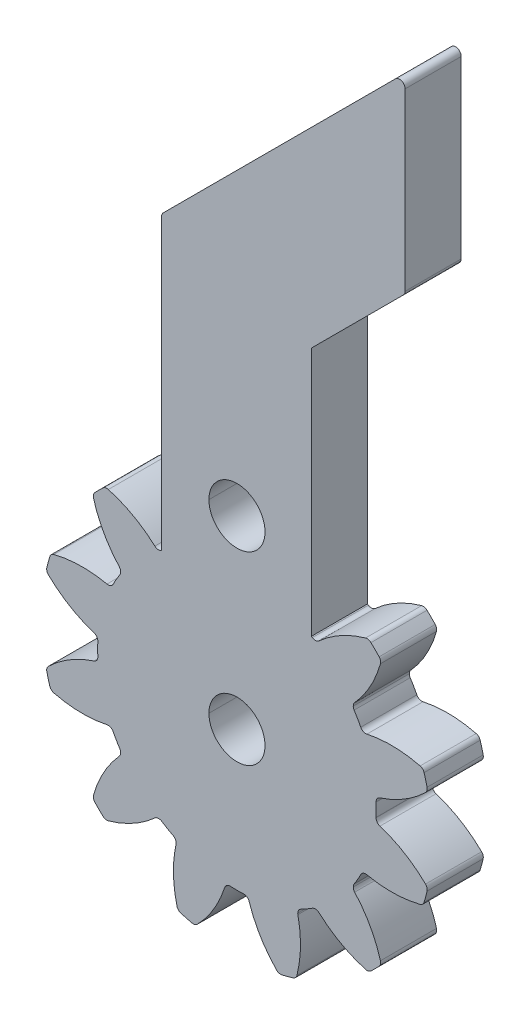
ISO-10303-21;
HEADER;
FILE_DESCRIPTION(('STEP AP214'),'2;1');
FILE_NAME('part.step','',(''),(''),'','','');
FILE_SCHEMA(('AUTOMOTIVE_DESIGN { 1 0 10303 214 1 1 1 1 }'));
ENDSEC;
DATA;
#1=APPLICATION_CONTEXT('core data for automotive mechanical design processes');
#2=APPLICATION_PROTOCOL_DEFINITION('international standard','automotive_design',2000,#1);
#3=PRODUCT_CONTEXT('',#1,'mechanical');
#4=PRODUCT('Part','Part','',(#3));
#5=PRODUCT_RELATED_PRODUCT_CATEGORY('part','',(#4));
#6=PRODUCT_DEFINITION_FORMATION('','',#4);
#7=PRODUCT_DEFINITION_CONTEXT('part definition',#1,'design');
#8=PRODUCT_DEFINITION('design','',#6,#7);
#9=PRODUCT_DEFINITION_SHAPE('','',#8);
#10=(LENGTH_UNIT() NAMED_UNIT(*) SI_UNIT(.MILLI.,.METRE.));
#11=(NAMED_UNIT(*) PLANE_ANGLE_UNIT() SI_UNIT($,.RADIAN.));
#12=(NAMED_UNIT(*) SI_UNIT($,.STERADIAN.) SOLID_ANGLE_UNIT());
#13=UNCERTAINTY_MEASURE_WITH_UNIT(LENGTH_MEASURE(1.E-05),#10,'distance_accuracy_value','');
#14=(GEOMETRIC_REPRESENTATION_CONTEXT(3) GLOBAL_UNCERTAINTY_ASSIGNED_CONTEXT((#13)) GLOBAL_UNIT_ASSIGNED_CONTEXT((#10,
#11,#12)) REPRESENTATION_CONTEXT('',''));
#15=CARTESIAN_POINT('',(0.,0.,0.));
#16=DIRECTION('',(0.,0.,1.));
#17=DIRECTION('',(1.,0.,0.));
#18=AXIS2_PLACEMENT_3D('',#15,#16,#17);
#19=CARTESIAN_POINT('',(90.8827853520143,-13.5691419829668,3.));
#20=DIRECTION('',(0.,0.,-1.));
#21=DIRECTION('',(-1.,0.,0.));
#22=AXIS2_PLACEMENT_3D('',#19,#20,#21);
#23=CYLINDRICAL_SURFACE('',#22,6.25000000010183);
#24=DIRECTION('',(0.,0.,-1.));
#25=VECTOR('',#24,1.);
#26=CARTESIAN_POINT('',(84.7721844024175,-12.2564896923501,3.));
#27=LINE('',#26,#25);
#28=CARTESIAN_POINT('',(84.7721844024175,-12.2564896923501,3.));
#29=VERTEX_POINT('',#28);
#30=CARTESIAN_POINT('',(84.7721844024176,-12.2564896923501,0.));
#31=VERTEX_POINT('',#30);
#32=EDGE_CURVE('E643',#29,#31,#27,.T.);
#33=ORIENTED_EDGE('',*,*,#32,.T.);
#34=CARTESIAN_POINT('',(90.8827853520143,-13.5691419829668,0.));
#35=DIRECTION('',(0.,0.,-1.));
#36=DIRECTION('',(-1.,0.,0.));
#37=AXIS2_PLACEMENT_3D('',#34,#35,#36);
#38=CIRCLE('',#37,6.25000000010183);
#39=CARTESIAN_POINT('',(84.6327853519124,-13.5691419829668,0.));
#40=VERTEX_POINT('',#39);
#41=EDGE_CURVE('E627',#31,#40,#38,.F.);
#42=ORIENTED_EDGE('',*,*,#41,.T.);
#43=DIRECTION('',(0.,0.,-1.));
#44=VECTOR('',#43,1.);
#45=CARTESIAN_POINT('',(84.6327853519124,-13.5691419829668,3.));
#46=LINE('',#45,#44);
#47=CARTESIAN_POINT('',(84.6327853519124,-13.5691419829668,3.));
#48=VERTEX_POINT('',#47);
#49=EDGE_CURVE('E629',#48,#40,#46,.T.);
#50=ORIENTED_EDGE('',*,*,#49,.F.);
#51=CARTESIAN_POINT('',(90.8827853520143,-13.5691419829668,3.));
#52=DIRECTION('',(0.,0.,-1.));
#53=DIRECTION('',(-1.,0.,0.));
#54=AXIS2_PLACEMENT_3D('',#51,#52,#53);
#55=CIRCLE('',#54,6.25000000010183);
#56=EDGE_CURVE('E17',#48,#29,#55,.T.);
#57=ORIENTED_EDGE('',*,*,#56,.T.);
#58=EDGE_LOOP('',(#33,#42,#50,#57));
#59=FACE_BOUND('',#58,.T.);
#60=ADVANCED_FACE('F14',(#59),#23,.T.);
#61=CARTESIAN_POINT('',(90.8827853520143,-13.5691419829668,3.));
#62=DIRECTION('',(0.,0.,-1.));
#63=DIRECTION('',(-1.,0.,0.));
#64=AXIS2_PLACEMENT_3D('',#61,#62,#63);
#65=CYLINDRICAL_SURFACE('',#64,6.25000000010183);
#66=CARTESIAN_POINT('',(90.8827853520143,-13.5691419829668,0.));
#67=DIRECTION('',(0.,0.,-1.));
#68=DIRECTION('',(-1.,0.,0.));
#69=AXIS2_PLACEMENT_3D('',#66,#67,#68);
#70=CIRCLE('',#69,6.25000000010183);
#71=CARTESIAN_POINT('',(84.8233416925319,-15.1006910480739,0.));
#72=VERTEX_POINT('',#71);
#73=EDGE_CURVE('E633',#40,#72,#70,.F.);
#74=ORIENTED_EDGE('',*,*,#73,.T.);
#75=DIRECTION('',(0.,0.,-1.));
#76=VECTOR('',#75,1.);
#77=CARTESIAN_POINT('',(84.8233416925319,-15.1006910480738,3.));
#78=LINE('',#77,#76);
#79=CARTESIAN_POINT('',(84.8233416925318,-15.1006910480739,3.));
#80=VERTEX_POINT('',#79);
#81=EDGE_CURVE('E637',#80,#72,#78,.T.);
#82=ORIENTED_EDGE('',*,*,#81,.F.);
#83=CARTESIAN_POINT('',(90.8827853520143,-13.5691419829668,3.));
#84=DIRECTION('',(0.,0.,-1.));
#85=DIRECTION('',(-1.,0.,0.));
#86=AXIS2_PLACEMENT_3D('',#83,#84,#85);
#87=CIRCLE('',#86,6.25000000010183);
#88=EDGE_CURVE('E620',#80,#48,#87,.T.);
#89=ORIENTED_EDGE('',*,*,#88,.T.);
#90=ORIENTED_EDGE('',*,*,#49,.T.);
#91=EDGE_LOOP('',(#74,#82,#89,#90));
#92=FACE_BOUND('',#91,.T.);
#93=ADVANCED_FACE('F635',(#92),#65,.T.);
#94=CARTESIAN_POINT('',(84.4788755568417,-12.1934823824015,3.));
#95=DIRECTION('',(0.,0.,-1.));
#96=DIRECTION('',(-1.,0.,0.));
#97=AXIS2_PLACEMENT_3D('',#94,#95,#96);
#98=CYLINDRICAL_SURFACE('',#97,0.299999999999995);
#99=ORIENTED_EDGE('',*,*,#32,.F.);
#100=CARTESIAN_POINT('',(84.4788755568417,-12.1934823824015,3.));
#101=DIRECTION('',(0.,0.,-1.));
#102=DIRECTION('',(-1.,0.,0.));
#103=AXIS2_PLACEMENT_3D('',#100,#101,#102);
#104=CIRCLE('',#103,0.299999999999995);
#105=CARTESIAN_POINT('',(84.6163504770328,-11.926835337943,3.));
#106=VERTEX_POINT('',#105);
#107=EDGE_CURVE('E623',#106,#29,#104,.T.);
#108=ORIENTED_EDGE('',*,*,#107,.F.);
#109=DIRECTION('',(0.,0.,-1.));
#110=VECTOR('',#109,1.);
#111=CARTESIAN_POINT('',(84.6163504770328,-11.926835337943,3.));
#112=LINE('',#111,#110);
#113=CARTESIAN_POINT('',(84.6163504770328,-11.926835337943,0.));
#114=VERTEX_POINT('',#113);
#115=EDGE_CURVE('E716',#114,#106,#112,.F.);
#116=ORIENTED_EDGE('',*,*,#115,.F.);
#117=CARTESIAN_POINT('',(84.4788755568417,-12.1934823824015,0.));
#118=DIRECTION('',(0.,0.,-1.));
#119=DIRECTION('',(-1.,0.,0.));
#120=AXIS2_PLACEMENT_3D('',#117,#118,#119);
#121=CIRCLE('',#120,0.299999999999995);
#122=EDGE_CURVE('E644',#31,#114,#121,.F.);
#123=ORIENTED_EDGE('',*,*,#122,.F.);
#124=EDGE_LOOP('',(#99,#108,#116,#123));
#125=FACE_BOUND('',#124,.T.);
#126=ADVANCED_FACE('F1626',(#125),#98,.F.);
#127=CARTESIAN_POINT('',(85.1141949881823,-15.0271766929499,3.));
#128=DIRECTION('',(0.,0.,-1.));
#129=DIRECTION('',(-1.,0.,0.));
#130=AXIS2_PLACEMENT_3D('',#127,#128,#129);
#131=CYLINDRICAL_SURFACE('',#130,0.299999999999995);
#132=CARTESIAN_POINT('',(85.1141949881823,-15.0271766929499,3.));
#133=DIRECTION('',(0.,0.,-1.));
#134=DIRECTION('',(-1.,0.,0.));
#135=AXIS2_PLACEMENT_3D('',#132,#133,#134);
#136=CIRCLE('',#135,0.299999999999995);
#137=CARTESIAN_POINT('',(85.0280043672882,-15.3145287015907,3.));
#138=VERTEX_POINT('',#137);
#139=EDGE_CURVE('E649',#138,#80,#136,.T.);
#140=ORIENTED_EDGE('',*,*,#139,.T.);
#141=ORIENTED_EDGE('',*,*,#81,.T.);
#142=CARTESIAN_POINT('',(85.1141949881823,-15.0271766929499,0.));
#143=DIRECTION('',(0.,0.,-1.));
#144=DIRECTION('',(-1.,0.,0.));
#145=AXIS2_PLACEMENT_3D('',#142,#143,#144);
#146=CIRCLE('',#145,0.299999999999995);
#147=CARTESIAN_POINT('',(85.0280043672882,-15.3145287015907,0.));
#148=VERTEX_POINT('',#147);
#149=EDGE_CURVE('E646',#72,#148,#146,.F.);
#150=ORIENTED_EDGE('',*,*,#149,.T.);
#151=DIRECTION('',(0.,0.,-1.));
#152=VECTOR('',#151,1.);
#153=CARTESIAN_POINT('',(85.0280043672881,-15.3145287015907,3.));
#154=LINE('',#153,#152);
#155=EDGE_CURVE('E731',#138,#148,#154,.T.);
#156=ORIENTED_EDGE('',*,*,#155,.F.);
#157=EDGE_LOOP('',(#140,#141,#150,#156));
#158=FACE_BOUND('',#157,.T.);
#159=ADVANCED_FACE('F1628',(#158),#131,.T.);
#160=CARTESIAN_POINT('',(88.0303109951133,-5.30510040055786,3.));
#161=DIRECTION('',(0.,0.,-1.));
#162=DIRECTION('',(-1.,0.,0.));
#163=AXIS2_PLACEMENT_3D('',#160,#161,#162);
#164=CYLINDRICAL_SURFACE('',#163,7.44999999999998);
#165=CARTESIAN_POINT('',(88.0303109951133,-5.30510040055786,3.));
#166=DIRECTION('',(0.,0.,-1.));
#167=DIRECTION('',(-1.,0.,0.));
#168=AXIS2_PLACEMENT_3D('',#165,#166,#167);
#169=CIRCLE('',#168,7.44999999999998);
#170=CARTESIAN_POINT('',(95.4718819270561,-4.95080946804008,3.));
#171=VERTEX_POINT('',#170);
#172=CARTESIAN_POINT('',(95.4718819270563,-5.6593913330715,3.));
#173=VERTEX_POINT('',#172);
#174=EDGE_CURVE('E654',#171,#173,#169,.T.);
#175=ORIENTED_EDGE('',*,*,#174,.T.);
#176=DIRECTION('',(0.,0.,-1.));
#177=VECTOR('',#176,1.);
#178=CARTESIAN_POINT('',(95.4718819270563,-5.65939133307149,3.));
#179=LINE('',#178,#177);
#180=CARTESIAN_POINT('',(95.4718819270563,-5.6593913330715,0.));
#181=VERTEX_POINT('',#180);
#182=EDGE_CURVE('E768',#173,#181,#179,.T.);
#183=ORIENTED_EDGE('',*,*,#182,.T.);
#184=CARTESIAN_POINT('',(88.0303109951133,-5.30510040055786,0.));
#185=DIRECTION('',(0.,0.,-1.));
#186=DIRECTION('',(-1.,0.,0.));
#187=AXIS2_PLACEMENT_3D('',#184,#185,#186);
#188=CIRCLE('',#187,7.44999999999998);
#189=CARTESIAN_POINT('',(95.4718819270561,-4.95080946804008,0.));
#190=VERTEX_POINT('',#189);
#191=EDGE_CURVE('E651',#181,#190,#188,.F.);
#192=ORIENTED_EDGE('',*,*,#191,.T.);
#193=DIRECTION('',(0.,0.,-1.));
#194=VECTOR('',#193,1.);
#195=CARTESIAN_POINT('',(95.4718819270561,-4.95080946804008,3.));
#196=LINE('',#195,#194);
#197=EDGE_CURVE('E777',#190,#171,#196,.F.);
#198=ORIENTED_EDGE('',*,*,#197,.T.);
#199=EDGE_LOOP('',(#175,#183,#192,#198));
#200=FACE_BOUND('',#199,.T.);
#201=ADVANCED_FACE('F1759',(#200),#164,.T.);
#202=CARTESIAN_POINT('',(88.0303109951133,-5.30510040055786,3.));
#203=DIRECTION('',(0.,0.,-1.));
#204=DIRECTION('',(-1.,0.,0.));
#205=AXIS2_PLACEMENT_3D('',#202,#203,#204);
#206=CYLINDRICAL_SURFACE('',#205,10.4500000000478);
#207=CARTESIAN_POINT('',(88.0303109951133,-5.30510040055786,3.));
#208=DIRECTION('',(0.,0.,-1.));
#209=DIRECTION('',(-1.,0.,0.));
#210=AXIS2_PLACEMENT_3D('',#207,#208,#209);
#211=CIRCLE('',#210,10.4500000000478);
#212=CARTESIAN_POINT('',(80.4255230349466,1.86216547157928,3.));
#213=VERTEX_POINT('',#212);
#214=CARTESIAN_POINT('',(80.8630451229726,2.29968755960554,3.));
#215=VERTEX_POINT('',#214);
#216=EDGE_CURVE('E658',#213,#215,#211,.T.);
#217=ORIENTED_EDGE('',*,*,#216,.T.);
#218=DIRECTION('',(0.,0.,-1.));
#219=VECTOR('',#218,1.);
#220=CARTESIAN_POINT('',(80.8630451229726,2.29968755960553,3.));
#221=LINE('',#220,#219);
#222=CARTESIAN_POINT('',(80.8630451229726,2.29968755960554,0.));
#223=VERTEX_POINT('',#222);
#224=EDGE_CURVE('E801',#223,#215,#221,.F.);
#225=ORIENTED_EDGE('',*,*,#224,.F.);
#226=CARTESIAN_POINT('',(88.0303109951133,-5.30510040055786,0.));
#227=DIRECTION('',(0.,0.,-1.));
#228=DIRECTION('',(-1.,0.,0.));
#229=AXIS2_PLACEMENT_3D('',#226,#227,#228);
#230=CIRCLE('',#229,10.4500000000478);
#231=CARTESIAN_POINT('',(80.4255230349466,1.86216547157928,0.));
#232=VERTEX_POINT('',#231);
#233=EDGE_CURVE('E656',#223,#232,#230,.F.);
#234=ORIENTED_EDGE('',*,*,#233,.T.);
#235=DIRECTION('',(0.,0.,-1.));
#236=VECTOR('',#235,1.);
#237=CARTESIAN_POINT('',(80.4255230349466,1.86216547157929,3.));
#238=LINE('',#237,#236);
#239=EDGE_CURVE('E663',#213,#232,#238,.T.);
#240=ORIENTED_EDGE('',*,*,#239,.F.);
#241=EDGE_LOOP('',(#217,#225,#234,#240));
#242=FACE_BOUND('',#241,.T.);
#243=ADVANCED_FACE('F1494',(#242),#206,.T.);
#244=CARTESIAN_POINT('',(80.6438423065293,1.65640664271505,3.));
#245=DIRECTION('',(0.,0.,-1.));
#246=DIRECTION('',(-1.,0.,0.));
#247=AXIS2_PLACEMENT_3D('',#244,#245,#246);
#248=CYLINDRICAL_SURFACE('',#247,0.299999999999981);
#249=ORIENTED_EDGE('',*,*,#239,.T.);
#250=CARTESIAN_POINT('',(80.6438423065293,1.65640664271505,0.));
#251=DIRECTION('',(0.,0.,-1.));
#252=DIRECTION('',(-1.,0.,0.));
#253=AXIS2_PLACEMENT_3D('',#250,#251,#252);
#254=CIRCLE('',#253,0.299999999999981);
#255=CARTESIAN_POINT('',(80.3438423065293,1.65640664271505,0.));
#256=VERTEX_POINT('',#255);
#257=EDGE_CURVE('E664',#232,#256,#254,.F.);
#258=ORIENTED_EDGE('',*,*,#257,.T.);
#259=DIRECTION('',(0.,0.,-1.));
#260=VECTOR('',#259,1.);
#261=CARTESIAN_POINT('',(80.3438423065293,1.65640664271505,3.));
#262=LINE('',#261,#260);
#263=CARTESIAN_POINT('',(80.3438423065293,1.65640664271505,3.));
#264=VERTEX_POINT('',#263);
#265=EDGE_CURVE('E812',#264,#256,#262,.T.);
#266=ORIENTED_EDGE('',*,*,#265,.F.);
#267=CARTESIAN_POINT('',(80.6438423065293,1.65640664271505,3.));
#268=DIRECTION('',(0.,0.,-1.));
#269=DIRECTION('',(-1.,0.,0.));
#270=AXIS2_PLACEMENT_3D('',#267,#268,#269);
#271=CIRCLE('',#270,0.299999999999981);
#272=EDGE_CURVE('E660',#264,#213,#271,.T.);
#273=ORIENTED_EDGE('',*,*,#272,.T.);
#274=EDGE_LOOP('',(#249,#258,#266,#273));
#275=FACE_BOUND('',#274,.T.);
#276=ADVANCED_FACE('F1498',(#275),#248,.T.);
#277=CARTESIAN_POINT('',(88.0303109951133,-5.30510040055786,3.));
#278=DIRECTION('',(0.,0.,-1.));
#279=DIRECTION('',(-1.,0.,0.));
#280=AXIS2_PLACEMENT_3D('',#277,#278,#279);
#281=CYLINDRICAL_SURFACE('',#280,10.4500000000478);
#282=CARTESIAN_POINT('',(88.0303109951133,-5.30510040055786,3.));
#283=DIRECTION('',(0.,0.,-1.));
#284=DIRECTION('',(-1.,0.,0.));
#285=AXIS2_PLACEMENT_3D('',#282,#283,#284);
#286=CIRCLE('',#285,10.4500000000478);
#287=CARTESIAN_POINT('',(77.8607384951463,-2.90046005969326,3.));
#288=VERTEX_POINT('',#287);
#289=CARTESIAN_POINT('',(78.0208826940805,-2.3027937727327,3.));
#290=VERTEX_POINT('',#289);
#291=EDGE_CURVE('E668',#288,#290,#286,.T.);
#292=ORIENTED_EDGE('',*,*,#291,.T.);
#293=DIRECTION('',(0.,0.,-1.));
#294=VECTOR('',#293,1.);
#295=CARTESIAN_POINT('',(78.0208826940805,-2.30279377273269,3.));
#296=LINE('',#295,#294);
#297=CARTESIAN_POINT('',(78.0208826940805,-2.3027937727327,0.));
#298=VERTEX_POINT('',#297);
#299=EDGE_CURVE('E816',#298,#290,#296,.F.);
#300=ORIENTED_EDGE('',*,*,#299,.F.);
#301=CARTESIAN_POINT('',(88.0303109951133,-5.30510040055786,0.));
#302=DIRECTION('',(0.,0.,-1.));
#303=DIRECTION('',(-1.,0.,0.));
#304=AXIS2_PLACEMENT_3D('',#301,#302,#303);
#305=CIRCLE('',#304,10.4500000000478);
#306=CARTESIAN_POINT('',(77.8607384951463,-2.90046005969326,0.));
#307=VERTEX_POINT('',#306);
#308=EDGE_CURVE('E666',#298,#307,#305,.F.);
#309=ORIENTED_EDGE('',*,*,#308,.T.);
#310=DIRECTION('',(0.,0.,-1.));
#311=VECTOR('',#310,1.);
#312=CARTESIAN_POINT('',(77.8607384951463,-2.90046005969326,3.));
#313=LINE('',#312,#311);
#314=EDGE_CURVE('E683',#288,#307,#313,.T.);
#315=ORIENTED_EDGE('',*,*,#314,.F.);
#316=EDGE_LOOP('',(#292,#300,#309,#315));
#317=FACE_BOUND('',#316,.T.);
#318=ADVANCED_FACE('F1529',(#317),#281,.T.);
#319=CARTESIAN_POINT('',(88.0303109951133,-5.30510040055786,3.));
#320=DIRECTION('',(0.,0.,-1.));
#321=DIRECTION('',(-1.,0.,0.));
#322=AXIS2_PLACEMENT_3D('',#319,#320,#321);
#323=CYLINDRICAL_SURFACE('',#322,7.45000000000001);
#324=CARTESIAN_POINT('',(88.0303109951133,-5.30510040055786,3.));
#325=DIRECTION('',(0.,0.,-1.));
#326=DIRECTION('',(-1.,0.,0.));
#327=AXIS2_PLACEMENT_3D('',#324,#325,#326);
#328=CIRCLE('',#327,7.45000000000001);
#329=CARTESIAN_POINT('',(81.4085760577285,-1.89113988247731,3.));
#330=VERTEX_POINT('',#329);
#331=CARTESIAN_POINT('',(81.7628669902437,-1.27748998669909,3.));
#332=VERTEX_POINT('',#331);
#333=EDGE_CURVE('E672',#330,#332,#328,.T.);
#334=ORIENTED_EDGE('',*,*,#333,.T.);
#335=DIRECTION('',(0.,0.,-1.));
#336=VECTOR('',#335,1.);
#337=CARTESIAN_POINT('',(81.7628669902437,-1.2774899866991,3.));
#338=LINE('',#337,#336);
#339=CARTESIAN_POINT('',(81.7628669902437,-1.27748998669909,0.));
#340=VERTEX_POINT('',#339);
#341=EDGE_CURVE('E808',#332,#340,#338,.T.);
#342=ORIENTED_EDGE('',*,*,#341,.T.);
#343=CARTESIAN_POINT('',(88.0303109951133,-5.30510040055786,0.));
#344=DIRECTION('',(0.,0.,-1.));
#345=DIRECTION('',(-1.,0.,0.));
#346=AXIS2_PLACEMENT_3D('',#343,#344,#345);
#347=CIRCLE('',#346,7.45000000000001);
#348=CARTESIAN_POINT('',(81.4085760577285,-1.89113988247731,0.));
#349=VERTEX_POINT('',#348);
#350=EDGE_CURVE('E670',#340,#349,#347,.F.);
#351=ORIENTED_EDGE('',*,*,#350,.T.);
#352=DIRECTION('',(0.,0.,-1.));
#353=VECTOR('',#352,1.);
#354=CARTESIAN_POINT('',(81.4085760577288,-1.89113988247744,3.));
#355=LINE('',#354,#353);
#356=EDGE_CURVE('E815',#349,#330,#355,.F.);
#357=ORIENTED_EDGE('',*,*,#356,.T.);
#358=EDGE_LOOP('',(#334,#342,#351,#357));
#359=FACE_BOUND('',#358,.T.);
#360=ADVANCED_FACE('F1512',(#359),#323,.T.);
#361=CARTESIAN_POINT('',(88.0303109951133,-5.30510040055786,3.));
#362=DIRECTION('',(0.,0.,-1.));
#363=DIRECTION('',(-1.,0.,0.));
#364=AXIS2_PLACEMENT_3D('',#361,#362,#363);
#365=CYLINDRICAL_SURFACE('',#364,7.45000000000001);
#366=DIRECTION('',(0.,0.,-1.));
#367=VECTOR('',#366,1.);
#368=CARTESIAN_POINT('',(80.5887400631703,-4.95080946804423,3.));
#369=LINE('',#368,#367);
#370=CARTESIAN_POINT('',(80.5887400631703,-4.95080946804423,3.));
#371=VERTEX_POINT('',#370);
#372=CARTESIAN_POINT('',(80.5887400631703,-4.95080946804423,0.));
#373=VERTEX_POINT('',#372);
#374=EDGE_CURVE('E821',#371,#373,#369,.T.);
#375=ORIENTED_EDGE('',*,*,#374,.T.);
#376=CARTESIAN_POINT('',(88.0303109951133,-5.30510040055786,0.));
#377=DIRECTION('',(0.,0.,-1.));
#378=DIRECTION('',(-1.,0.,0.));
#379=AXIS2_PLACEMENT_3D('',#376,#377,#378);
#380=CIRCLE('',#379,7.45000000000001);
#381=CARTESIAN_POINT('',(80.5803109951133,-5.30510040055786,0.));
#382=VERTEX_POINT('',#381);
#383=EDGE_CURVE('E678',#373,#382,#380,.F.);
#384=ORIENTED_EDGE('',*,*,#383,.T.);
#385=DIRECTION('',(0.,0.,-1.));
#386=VECTOR('',#385,1.);
#387=CARTESIAN_POINT('',(80.5803109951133,-5.30510040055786,3.));
#388=LINE('',#387,#386);
#389=CARTESIAN_POINT('',(80.5803109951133,-5.30510040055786,3.));
#390=VERTEX_POINT('',#389);
#391=EDGE_CURVE('E694',#390,#382,#388,.T.);
#392=ORIENTED_EDGE('',*,*,#391,.F.);
#393=CARTESIAN_POINT('',(88.0303109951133,-5.30510040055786,3.));
#394=DIRECTION('',(0.,0.,-1.));
#395=DIRECTION('',(-1.,0.,0.));
#396=AXIS2_PLACEMENT_3D('',#393,#394,#395);
#397=CIRCLE('',#396,7.45000000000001);
#398=EDGE_CURVE('E675',#390,#371,#397,.T.);
#399=ORIENTED_EDGE('',*,*,#398,.T.);
#400=EDGE_LOOP('',(#375,#384,#392,#399));
#401=FACE_BOUND('',#400,.T.);
#402=ADVANCED_FACE('F1548',(#401),#365,.T.);
#403=CARTESIAN_POINT('',(78.1526879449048,-2.96949279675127,3.));
#404=DIRECTION('',(0.,0.,-1.));
#405=DIRECTION('',(-1.,0.,0.));
#406=AXIS2_PLACEMENT_3D('',#403,#404,#405);
#407=CYLINDRICAL_SURFACE('',#406,0.299999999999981);
#408=ORIENTED_EDGE('',*,*,#314,.T.);
#409=CARTESIAN_POINT('',(78.1526879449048,-2.96949279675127,0.));
#410=DIRECTION('',(0.,0.,-1.));
#411=DIRECTION('',(-1.,0.,0.));
#412=AXIS2_PLACEMENT_3D('',#409,#410,#411);
#413=CIRCLE('',#412,0.299999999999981);
#414=CARTESIAN_POINT('',(77.8526879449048,-2.96949279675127,0.));
#415=VERTEX_POINT('',#414);
#416=EDGE_CURVE('E684',#307,#415,#413,.F.);
#417=ORIENTED_EDGE('',*,*,#416,.T.);
#418=DIRECTION('',(0.,0.,-1.));
#419=VECTOR('',#418,1.);
#420=CARTESIAN_POINT('',(77.8526879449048,-2.96949279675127,3.));
#421=LINE('',#420,#419);
#422=CARTESIAN_POINT('',(77.8526879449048,-2.96949279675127,3.));
#423=VERTEX_POINT('',#422);
#424=EDGE_CURVE('E825',#423,#415,#421,.T.);
#425=ORIENTED_EDGE('',*,*,#424,.F.);
#426=CARTESIAN_POINT('',(78.1526879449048,-2.96949279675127,3.));
#427=DIRECTION('',(0.,0.,-1.));
#428=DIRECTION('',(-1.,0.,0.));
#429=AXIS2_PLACEMENT_3D('',#426,#427,#428);
#430=CIRCLE('',#429,0.299999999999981);
#431=EDGE_CURVE('E680',#423,#288,#430,.T.);
#432=ORIENTED_EDGE('',*,*,#431,.T.);
#433=EDGE_LOOP('',(#408,#417,#425,#432));
#434=FACE_BOUND('',#433,.T.);
#435=ADVANCED_FACE('F1535',(#434),#407,.T.);
#436=CARTESIAN_POINT('',(78.1526879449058,-7.64070800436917,3.));
#437=DIRECTION('',(0.,0.,-1.));
#438=DIRECTION('',(-1.,0.,0.));
#439=AXIS2_PLACEMENT_3D('',#436,#437,#438);
#440=CYLINDRICAL_SURFACE('',#439,0.299999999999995);
#441=CARTESIAN_POINT('',(78.1526879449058,-7.64070800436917,0.));
#442=DIRECTION('',(0.,0.,-1.));
#443=DIRECTION('',(-1.,0.,0.));
#444=AXIS2_PLACEMENT_3D('',#441,#442,#443);
#445=CIRCLE('',#444,0.299999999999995);
#446=CARTESIAN_POINT('',(77.8526879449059,-7.64070800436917,0.));
#447=VERTEX_POINT('',#446);
#448=CARTESIAN_POINT('',(77.8607384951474,-7.70974074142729,0.));
#449=VERTEX_POINT('',#448);
#450=EDGE_CURVE('E688',#447,#449,#445,.F.);
#451=ORIENTED_EDGE('',*,*,#450,.T.);
#452=DIRECTION('',(0.,0.,-1.));
#453=VECTOR('',#452,1.);
#454=CARTESIAN_POINT('',(77.8607384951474,-7.70974074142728,3.));
#455=LINE('',#454,#453);
#456=CARTESIAN_POINT('',(77.8607384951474,-7.70974074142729,3.));
#457=VERTEX_POINT('',#456);
#458=EDGE_CURVE('E702',#457,#449,#455,.T.);
#459=ORIENTED_EDGE('',*,*,#458,.F.);
#460=CARTESIAN_POINT('',(78.1526879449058,-7.64070800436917,3.));
#461=DIRECTION('',(0.,0.,-1.));
#462=DIRECTION('',(-1.,0.,0.));
#463=AXIS2_PLACEMENT_3D('',#460,#461,#462);
#464=CIRCLE('',#463,0.299999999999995);
#465=CARTESIAN_POINT('',(77.8526879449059,-7.64070800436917,3.));
#466=VERTEX_POINT('',#465);
#467=EDGE_CURVE('E686',#457,#466,#464,.T.);
#468=ORIENTED_EDGE('',*,*,#467,.T.);
#469=DIRECTION('',(0.,0.,-1.));
#470=VECTOR('',#469,1.);
#471=CARTESIAN_POINT('',(77.8526879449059,-7.64070800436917,3.));
#472=LINE('',#471,#470);
#473=EDGE_CURVE('E829',#447,#466,#472,.F.);
#474=ORIENTED_EDGE('',*,*,#473,.F.);
#475=EDGE_LOOP('',(#451,#459,#468,#474));
#476=FACE_BOUND('',#475,.T.);
#477=ADVANCED_FACE('F1571',(#476),#440,.T.);
#478=CARTESIAN_POINT('',(88.0303109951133,-5.30510040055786,3.));
#479=DIRECTION('',(0.,0.,-1.));
#480=DIRECTION('',(-1.,0.,0.));
#481=AXIS2_PLACEMENT_3D('',#478,#479,#480);
#482=CYLINDRICAL_SURFACE('',#481,7.45000000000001);
#483=CARTESIAN_POINT('',(88.0303109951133,-5.30510040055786,0.));
#484=DIRECTION('',(0.,0.,-1.));
#485=DIRECTION('',(-1.,0.,0.));
#486=AXIS2_PLACEMENT_3D('',#483,#484,#485);
#487=CIRCLE('',#486,7.45000000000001);
#488=CARTESIAN_POINT('',(80.5887400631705,-5.65939133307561,0.));
#489=VERTEX_POINT('',#488);
#490=EDGE_CURVE('E695',#382,#489,#487,.F.);
#491=ORIENTED_EDGE('',*,*,#490,.T.);
#492=DIRECTION('',(0.,0.,-1.));
#493=VECTOR('',#492,1.);
#494=CARTESIAN_POINT('',(80.5887400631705,-5.65939133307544,3.));
#495=LINE('',#494,#493);
#496=CARTESIAN_POINT('',(80.5887400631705,-5.65939133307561,3.));
#497=VERTEX_POINT('',#496);
#498=EDGE_CURVE('E828',#489,#497,#495,.F.);
#499=ORIENTED_EDGE('',*,*,#498,.T.);
#500=CARTESIAN_POINT('',(88.0303109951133,-5.30510040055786,3.));
#501=DIRECTION('',(0.,0.,-1.));
#502=DIRECTION('',(-1.,0.,0.));
#503=AXIS2_PLACEMENT_3D('',#500,#501,#502);
#504=CIRCLE('',#503,7.45000000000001);
#505=EDGE_CURVE('E691',#497,#390,#504,.T.);
#506=ORIENTED_EDGE('',*,*,#505,.T.);
#507=ORIENTED_EDGE('',*,*,#391,.T.);
#508=EDGE_LOOP('',(#491,#499,#506,#507));
#509=FACE_BOUND('',#508,.T.);
#510=ADVANCED_FACE('F1555',(#509),#482,.T.);
#511=CARTESIAN_POINT('',(88.0303109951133,-5.30510040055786,3.));
#512=DIRECTION('',(0.,0.,-1.));
#513=DIRECTION('',(-1.,0.,0.));
#514=AXIS2_PLACEMENT_3D('',#511,#512,#513);
#515=CYLINDRICAL_SURFACE('',#514,10.4500000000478);
#516=CARTESIAN_POINT('',(88.0303109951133,-5.30510040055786,3.));
#517=DIRECTION('',(0.,0.,-1.));
#518=DIRECTION('',(-1.,0.,0.));
#519=AXIS2_PLACEMENT_3D('',#516,#517,#518);
#520=CIRCLE('',#519,10.4500000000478);
#521=CARTESIAN_POINT('',(78.0208826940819,-8.30740702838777,3.));
#522=VERTEX_POINT('',#521);
#523=EDGE_CURVE('E699',#522,#457,#520,.T.);
#524=ORIENTED_EDGE('',*,*,#523,.T.);
#525=ORIENTED_EDGE('',*,*,#458,.T.);
#526=CARTESIAN_POINT('',(88.0303109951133,-5.30510040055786,0.));
#527=DIRECTION('',(0.,0.,-1.));
#528=DIRECTION('',(-1.,0.,0.));
#529=AXIS2_PLACEMENT_3D('',#526,#527,#528);
#530=CIRCLE('',#529,10.4500000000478);
#531=CARTESIAN_POINT('',(78.0208826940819,-8.30740702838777,0.));
#532=VERTEX_POINT('',#531);
#533=EDGE_CURVE('E697',#449,#532,#530,.F.);
#534=ORIENTED_EDGE('',*,*,#533,.T.);
#535=DIRECTION('',(0.,0.,-1.));
#536=VECTOR('',#535,1.);
#537=CARTESIAN_POINT('',(78.0208826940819,-8.30740702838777,3.));
#538=LINE('',#537,#536);
#539=EDGE_CURVE('E838',#522,#532,#538,.T.);
#540=ORIENTED_EDGE('',*,*,#539,.F.);
#541=EDGE_LOOP('',(#524,#525,#534,#540));
#542=FACE_BOUND('',#541,.T.);
#543=ADVANCED_FACE('F1573',(#542),#515,.T.);
#544=CARTESIAN_POINT('',(80.6438423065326,-12.2666074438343,3.));
#545=DIRECTION('',(0.,0.,-1.));
#546=DIRECTION('',(-1.,0.,0.));
#547=AXIS2_PLACEMENT_3D('',#544,#545,#546);
#548=CYLINDRICAL_SURFACE('',#547,0.299999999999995);
#549=CARTESIAN_POINT('',(80.6438423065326,-12.2666074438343,0.));
#550=DIRECTION('',(0.,0.,-1.));
#551=DIRECTION('',(-1.,0.,0.));
#552=AXIS2_PLACEMENT_3D('',#549,#550,#551);
#553=CIRCLE('',#552,0.299999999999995);
#554=CARTESIAN_POINT('',(80.3438423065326,-12.2666074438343,0.));
#555=VERTEX_POINT('',#554);
#556=CARTESIAN_POINT('',(80.4255230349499,-12.4723662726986,0.));
#557=VERTEX_POINT('',#556);
#558=EDGE_CURVE('E705',#555,#557,#553,.F.);
#559=ORIENTED_EDGE('',*,*,#558,.T.);
#560=DIRECTION('',(0.,0.,-1.));
#561=VECTOR('',#560,1.);
#562=CARTESIAN_POINT('',(80.4255230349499,-12.4723662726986,3.));
#563=LINE('',#562,#561);
#564=CARTESIAN_POINT('',(80.4255230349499,-12.4723662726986,3.));
#565=VERTEX_POINT('',#564);
#566=EDGE_CURVE('E725',#565,#557,#563,.T.);
#567=ORIENTED_EDGE('',*,*,#566,.F.);
#568=CARTESIAN_POINT('',(80.6438423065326,-12.2666074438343,3.));
#569=DIRECTION('',(0.,0.,-1.));
#570=DIRECTION('',(-1.,0.,0.));
#571=AXIS2_PLACEMENT_3D('',#568,#569,#570);
#572=CIRCLE('',#571,0.299999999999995);
#573=CARTESIAN_POINT('',(80.3438423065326,-12.2666074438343,3.));
#574=VERTEX_POINT('',#573);
#575=EDGE_CURVE('E703',#565,#574,#572,.T.);
#576=ORIENTED_EDGE('',*,*,#575,.T.);
#577=DIRECTION('',(0.,0.,-1.));
#578=VECTOR('',#577,1.);
#579=CARTESIAN_POINT('',(80.3438423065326,-12.2666074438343,3.));
#580=LINE('',#579,#578);
#581=EDGE_CURVE('E842',#555,#574,#580,.F.);
#582=ORIENTED_EDGE('',*,*,#581,.F.);
#583=EDGE_LOOP('',(#559,#567,#576,#582));
#584=FACE_BOUND('',#583,.T.);
#585=ADVANCED_FACE('F1606',(#584),#548,.T.);
#586=CARTESIAN_POINT('',(88.0303109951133,-5.30510040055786,3.));
#587=DIRECTION('',(0.,0.,-1.));
#588=DIRECTION('',(-1.,0.,0.));
#589=AXIS2_PLACEMENT_3D('',#586,#587,#588);
#590=CYLINDRICAL_SURFACE('',#589,7.45000000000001);
#591=CARTESIAN_POINT('',(88.0303109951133,-5.30510040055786,3.));
#592=DIRECTION('',(0.,0.,-1.));
#593=DIRECTION('',(-1.,0.,0.));
#594=AXIS2_PLACEMENT_3D('',#591,#592,#593);
#595=CIRCLE('',#594,7.45000000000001);
#596=CARTESIAN_POINT('',(81.7628669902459,-9.33271081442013,3.));
#597=VERTEX_POINT('',#596);
#598=CARTESIAN_POINT('',(81.40857605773,-8.71906091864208,3.));
#599=VERTEX_POINT('',#598);
#600=EDGE_CURVE('E710',#597,#599,#595,.T.);
#601=ORIENTED_EDGE('',*,*,#600,.T.);
#602=DIRECTION('',(0.,0.,-1.));
#603=VECTOR('',#602,1.);
#604=CARTESIAN_POINT('',(81.40857605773,-8.71906091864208,3.));
#605=LINE('',#604,#603);
#606=CARTESIAN_POINT('',(81.4085760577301,-8.71906091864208,0.));
#607=VERTEX_POINT('',#606);
#608=EDGE_CURVE('E834',#599,#607,#605,.T.);
#609=ORIENTED_EDGE('',*,*,#608,.T.);
#610=CARTESIAN_POINT('',(88.0303109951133,-5.30510040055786,0.));
#611=DIRECTION('',(0.,0.,-1.));
#612=DIRECTION('',(-1.,0.,0.));
#613=AXIS2_PLACEMENT_3D('',#610,#611,#612);
#614=CIRCLE('',#613,7.45000000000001);
#615=CARTESIAN_POINT('',(81.7628669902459,-9.33271081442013,0.));
#616=VERTEX_POINT('',#615);
#617=EDGE_CURVE('E708',#607,#616,#614,.F.);
#618=ORIENTED_EDGE('',*,*,#617,.T.);
#619=DIRECTION('',(0.,0.,-1.));
#620=VECTOR('',#619,1.);
#621=CARTESIAN_POINT('',(81.7628669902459,-9.33271081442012,3.));
#622=LINE('',#621,#620);
#623=EDGE_CURVE('E841',#616,#597,#622,.F.);
#624=ORIENTED_EDGE('',*,*,#623,.T.);
#625=EDGE_LOOP('',(#601,#609,#618,#624));
#626=FACE_BOUND('',#625,.T.);
#627=ADVANCED_FACE('F1587',(#626),#590,.T.);
#628=CARTESIAN_POINT('',(88.0303109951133,-5.30510040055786,3.));
#629=DIRECTION('',(0.,0.,-1.));
#630=DIRECTION('',(-1.,0.,0.));
#631=AXIS2_PLACEMENT_3D('',#628,#629,#630);
#632=CYLINDRICAL_SURFACE('',#631,7.45000000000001);
#633=CARTESIAN_POINT('',(88.0303109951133,-5.30510040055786,3.));
#634=DIRECTION('',(0.,0.,-1.));
#635=DIRECTION('',(-1.,0.,0.));
#636=AXIS2_PLACEMENT_3D('',#633,#634,#635);
#637=CIRCLE('',#636,7.45000000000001);
#638=CARTESIAN_POINT('',(84.0027005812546,-11.5725444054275,3.));
#639=VERTEX_POINT('',#638);
#640=EDGE_CURVE('E717',#106,#639,#637,.T.);
#641=ORIENTED_EDGE('',*,*,#640,.T.);
#642=DIRECTION('',(0.,0.,-1.));
#643=VECTOR('',#642,1.);
#644=CARTESIAN_POINT('',(84.0027005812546,-11.5725444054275,3.));
#645=LINE('',#644,#643);
#646=CARTESIAN_POINT('',(84.0027005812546,-11.5725444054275,0.));
#647=VERTEX_POINT('',#646);
#648=EDGE_CURVE('E847',#639,#647,#645,.T.);
#649=ORIENTED_EDGE('',*,*,#648,.T.);
#650=CARTESIAN_POINT('',(88.0303109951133,-5.30510040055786,0.));
#651=DIRECTION('',(0.,0.,-1.));
#652=DIRECTION('',(-1.,0.,0.));
#653=AXIS2_PLACEMENT_3D('',#650,#651,#652);
#654=CIRCLE('',#653,7.45000000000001);
#655=EDGE_CURVE('E713',#647,#114,#654,.F.);
#656=ORIENTED_EDGE('',*,*,#655,.T.);
#657=ORIENTED_EDGE('',*,*,#115,.T.);
#658=EDGE_LOOP('',(#641,#649,#656,#657));
#659=FACE_BOUND('',#658,.T.);
#660=ADVANCED_FACE('F1622',(#659),#632,.T.);
#661=CARTESIAN_POINT('',(88.0303109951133,-5.30510040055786,3.));
#662=DIRECTION('',(0.,0.,-1.));
#663=DIRECTION('',(-1.,0.,0.));
#664=AXIS2_PLACEMENT_3D('',#661,#662,#663);
#665=CYLINDRICAL_SURFACE('',#664,10.4500000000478);
#666=CARTESIAN_POINT('',(88.0303109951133,-5.30510040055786,3.));
#667=DIRECTION('',(0.,0.,-1.));
#668=DIRECTION('',(-1.,0.,0.));
#669=AXIS2_PLACEMENT_3D('',#666,#667,#668);
#670=CIRCLE('',#669,10.4500000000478);
#671=CARTESIAN_POINT('',(80.8630451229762,-12.9098883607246,3.));
#672=VERTEX_POINT('',#671);
#673=EDGE_CURVE('E722',#672,#565,#670,.T.);
#674=ORIENTED_EDGE('',*,*,#673,.T.);
#675=ORIENTED_EDGE('',*,*,#566,.T.);
#676=CARTESIAN_POINT('',(88.0303109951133,-5.30510040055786,0.));
#677=DIRECTION('',(0.,0.,-1.));
#678=DIRECTION('',(-1.,0.,0.));
#679=AXIS2_PLACEMENT_3D('',#676,#677,#678);
#680=CIRCLE('',#679,10.4500000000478);
#681=CARTESIAN_POINT('',(80.8630451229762,-12.9098883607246,0.));
#682=VERTEX_POINT('',#681);
#683=EDGE_CURVE('E720',#557,#682,#680,.F.);
#684=ORIENTED_EDGE('',*,*,#683,.T.);
#685=DIRECTION('',(0.,0.,-1.));
#686=VECTOR('',#685,1.);
#687=CARTESIAN_POINT('',(80.8630451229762,-12.9098883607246,3.));
#688=LINE('',#687,#686);
#689=EDGE_CURVE('E851',#672,#682,#688,.T.);
#690=ORIENTED_EDGE('',*,*,#689,.F.);
#691=EDGE_LOOP('',(#674,#675,#684,#690));
#692=FACE_BOUND('',#691,.T.);
#693=ADVANCED_FACE('F1608',(#692),#665,.T.);
#694=CARTESIAN_POINT('',(88.0303109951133,-5.30510040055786,3.));
#695=DIRECTION('',(0.,0.,-1.));
#696=DIRECTION('',(-1.,0.,0.));
#697=AXIS2_PLACEMENT_3D('',#694,#695,#696);
#698=CYLINDRICAL_SURFACE('',#697,10.4500000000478);
#699=CARTESIAN_POINT('',(88.0303109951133,-5.30510040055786,3.));
#700=DIRECTION('',(0.,0.,-1.));
#701=DIRECTION('',(-1.,0.,0.));
#702=AXIS2_PLACEMENT_3D('',#699,#700,#701);
#703=CIRCLE('',#702,10.4500000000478);
#704=CARTESIAN_POINT('',(85.6256706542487,-15.4746729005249,3.));
#705=VERTEX_POINT('',#704);
#706=EDGE_CURVE('E728',#705,#138,#703,.T.);
#707=ORIENTED_EDGE('',*,*,#706,.T.);
#708=ORIENTED_EDGE('',*,*,#155,.T.);
#709=CARTESIAN_POINT('',(88.0303109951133,-5.30510040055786,0.));
#710=DIRECTION('',(0.,0.,-1.));
#711=DIRECTION('',(-1.,0.,0.));
#712=AXIS2_PLACEMENT_3D('',#709,#710,#711);
#713=CIRCLE('',#712,10.4500000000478);
#714=CARTESIAN_POINT('',(85.6256706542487,-15.4746729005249,0.));
#715=VERTEX_POINT('',#714);
#716=EDGE_CURVE('E726',#148,#715,#713,.F.);
#717=ORIENTED_EDGE('',*,*,#716,.T.);
#718=DIRECTION('',(0.,0.,-1.));
#719=VECTOR('',#718,1.);
#720=CARTESIAN_POINT('',(85.6256706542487,-15.4746729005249,3.));
#721=LINE('',#720,#719);
#722=EDGE_CURVE('E858',#705,#715,#721,.T.);
#723=ORIENTED_EDGE('',*,*,#722,.F.);
#724=EDGE_LOOP('',(#707,#708,#717,#723));
#725=FACE_BOUND('',#724,.T.);
#726=ADVANCED_FACE('F1633',(#725),#698,.T.);
#727=CARTESIAN_POINT('',(88.0303109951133,-5.30510040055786,3.));
#728=DIRECTION('',(0.,0.,-1.));
#729=DIRECTION('',(-1.,0.,0.));
#730=AXIS2_PLACEMENT_3D('',#727,#728,#729);
#731=CYLINDRICAL_SURFACE('',#730,7.45);
#732=CARTESIAN_POINT('',(88.0303109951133,-5.30510040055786,3.));
#733=DIRECTION('',(0.,0.,-1.));
#734=DIRECTION('',(-1.,0.,0.));
#735=AXIS2_PLACEMENT_3D('',#732,#733,#734);
#736=CIRCLE('',#735,7.45);
#737=CARTESIAN_POINT('',(88.3846019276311,-12.7466713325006,3.));
#738=VERTEX_POINT('',#737);
#739=CARTESIAN_POINT('',(87.6760200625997,-12.7466713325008,3.));
#740=VERTEX_POINT('',#739);
#741=EDGE_CURVE('E734',#738,#740,#736,.T.);
#742=ORIENTED_EDGE('',*,*,#741,.T.);
#743=DIRECTION('',(0.,0.,-1.));
#744=VECTOR('',#743,1.);
#745=CARTESIAN_POINT('',(87.6760200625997,-12.7466713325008,3.));
#746=LINE('',#745,#744);
#747=CARTESIAN_POINT('',(87.6760200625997,-12.7466713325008,0.));
#748=VERTEX_POINT('',#747);
#749=EDGE_CURVE('E854',#740,#748,#746,.T.);
#750=ORIENTED_EDGE('',*,*,#749,.T.);
#751=CARTESIAN_POINT('',(88.0303109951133,-5.30510040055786,0.));
#752=DIRECTION('',(0.,0.,-1.));
#753=DIRECTION('',(-1.,0.,0.));
#754=AXIS2_PLACEMENT_3D('',#751,#752,#753);
#755=CIRCLE('',#754,7.45);
#756=CARTESIAN_POINT('',(88.3846019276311,-12.7466713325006,0.));
#757=VERTEX_POINT('',#756);
#758=EDGE_CURVE('E732',#748,#757,#755,.F.);
#759=ORIENTED_EDGE('',*,*,#758,.T.);
#760=DIRECTION('',(0.,0.,-1.));
#761=VECTOR('',#760,1.);
#762=CARTESIAN_POINT('',(88.3846019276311,-12.7466713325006,3.));
#763=LINE('',#762,#761);
#764=EDGE_CURVE('E861',#757,#738,#763,.F.);
#765=ORIENTED_EDGE('',*,*,#764,.T.);
#766=EDGE_LOOP('',(#742,#750,#759,#765));
#767=FACE_BOUND('',#766,.T.);
#768=ADVANCED_FACE('F1645',(#767),#731,.T.);
#769=CARTESIAN_POINT('',(91.5817464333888,-12.1934823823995,3.));
#770=DIRECTION('',(0.,0.,-1.));
#771=DIRECTION('',(-1.,0.,0.));
#772=AXIS2_PLACEMENT_3D('',#769,#770,#771);
#773=CYLINDRICAL_SURFACE('',#772,0.299999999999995);
#774=DIRECTION('',(0.,0.,-1.));
#775=VECTOR('',#774,1.);
#776=CARTESIAN_POINT('',(91.2817464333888,-12.1934823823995,3.));
#777=LINE('',#776,#775);
#778=CARTESIAN_POINT('',(91.2817464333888,-12.1934823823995,3.));
#779=VERTEX_POINT('',#778);
#780=CARTESIAN_POINT('',(91.2817464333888,-12.1934823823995,0.));
#781=VERTEX_POINT('',#780);
#782=EDGE_CURVE('E867',#779,#781,#777,.T.);
#783=ORIENTED_EDGE('',*,*,#782,.T.);
#784=CARTESIAN_POINT('',(91.5817464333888,-12.1934823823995,0.));
#785=DIRECTION('',(0.,0.,-1.));
#786=DIRECTION('',(-1.,0.,0.));
#787=AXIS2_PLACEMENT_3D('',#784,#785,#786);
#788=CIRCLE('',#787,0.299999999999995);
#789=CARTESIAN_POINT('',(91.4442715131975,-11.9268353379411,0.));
#790=VERTEX_POINT('',#789);
#791=EDGE_CURVE('E737',#790,#781,#788,.F.);
#792=ORIENTED_EDGE('',*,*,#791,.F.);
#793=DIRECTION('',(0.,0.,-1.));
#794=VECTOR('',#793,1.);
#795=CARTESIAN_POINT('',(91.4442715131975,-11.9268353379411,3.));
#796=LINE('',#795,#794);
#797=CARTESIAN_POINT('',(91.4442715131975,-11.9268353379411,3.));
#798=VERTEX_POINT('',#797);
#799=EDGE_CURVE('E750',#798,#790,#796,.T.);
#800=ORIENTED_EDGE('',*,*,#799,.F.);
#801=CARTESIAN_POINT('',(91.5817464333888,-12.1934823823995,3.));
#802=DIRECTION('',(0.,0.,-1.));
#803=DIRECTION('',(-1.,0.,0.));
#804=AXIS2_PLACEMENT_3D('',#801,#802,#803);
#805=CIRCLE('',#804,0.299999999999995);
#806=EDGE_CURVE('E739',#779,#798,#805,.T.);
#807=ORIENTED_EDGE('',*,*,#806,.F.);
#808=EDGE_LOOP('',(#783,#792,#800,#807));
#809=FACE_BOUND('',#808,.T.);
#810=ADVANCED_FACE('F1680',(#809),#773,.F.);
#811=CARTESIAN_POINT('',(88.0303109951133,-5.30510040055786,3.));
#812=DIRECTION('',(0.,0.,-1.));
#813=DIRECTION('',(-1.,0.,0.));
#814=AXIS2_PLACEMENT_3D('',#811,#812,#813);
#815=CYLINDRICAL_SURFACE('',#814,10.4500000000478);
#816=CARTESIAN_POINT('',(88.0303109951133,-5.30510040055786,3.));
#817=DIRECTION('',(0.,0.,-1.));
#818=DIRECTION('',(-1.,0.,0.));
#819=AXIS2_PLACEMENT_3D('',#816,#817,#818);
#820=CIRCLE('',#819,10.4500000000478);
#821=CARTESIAN_POINT('',(91.0326176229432,-15.3145287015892,3.));
#822=VERTEX_POINT('',#821);
#823=CARTESIAN_POINT('',(90.4349513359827,-15.4746729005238,3.));
#824=VERTEX_POINT('',#823);
#825=EDGE_CURVE('E743',#822,#824,#820,.T.);
#826=ORIENTED_EDGE('',*,*,#825,.T.);
#827=DIRECTION('',(0.,0.,-1.));
#828=VECTOR('',#827,1.);
#829=CARTESIAN_POINT('',(90.4349513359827,-15.4746729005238,3.));
#830=LINE('',#829,#828);
#831=CARTESIAN_POINT('',(90.4349513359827,-15.4746729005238,0.));
#832=VERTEX_POINT('',#831);
#833=EDGE_CURVE('E862',#832,#824,#830,.F.);
#834=ORIENTED_EDGE('',*,*,#833,.F.);
#835=CARTESIAN_POINT('',(88.0303109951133,-5.30510040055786,0.));
#836=DIRECTION('',(0.,0.,-1.));
#837=DIRECTION('',(-1.,0.,0.));
#838=AXIS2_PLACEMENT_3D('',#835,#836,#837);
#839=CIRCLE('',#838,10.4500000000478);
#840=CARTESIAN_POINT('',(91.0326176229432,-15.3145287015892,0.));
#841=VERTEX_POINT('',#840);
#842=EDGE_CURVE('E741',#832,#841,#839,.F.);
#843=ORIENTED_EDGE('',*,*,#842,.T.);
#844=DIRECTION('',(0.,0.,-1.));
#845=VECTOR('',#844,1.);
#846=CARTESIAN_POINT('',(91.0326176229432,-15.3145287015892,3.));
#847=LINE('',#846,#845);
#848=EDGE_CURVE('E871',#822,#841,#847,.T.);
#849=ORIENTED_EDGE('',*,*,#848,.F.);
#850=EDGE_LOOP('',(#826,#834,#843,#849));
#851=FACE_BOUND('',#850,.T.);
#852=ADVANCED_FACE('F1663',(#851),#815,.T.);
#853=CARTESIAN_POINT('',(88.0303109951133,-5.30510040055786,3.));
#854=DIRECTION('',(0.,0.,-1.));
#855=DIRECTION('',(-1.,0.,0.));
#856=AXIS2_PLACEMENT_3D('',#853,#854,#855);
#857=CYLINDRICAL_SURFACE('',#856,7.45);
#858=CARTESIAN_POINT('',(88.0303109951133,-5.30510040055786,3.));
#859=DIRECTION('',(0.,0.,-1.));
#860=DIRECTION('',(-1.,0.,0.));
#861=AXIS2_PLACEMENT_3D('',#858,#859,#860);
#862=CIRCLE('',#861,7.45);
#863=CARTESIAN_POINT('',(92.0579214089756,-11.5725444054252,3.));
#864=VERTEX_POINT('',#863);
#865=EDGE_CURVE('E747',#864,#798,#862,.T.);
#866=ORIENTED_EDGE('',*,*,#865,.T.);
#867=ORIENTED_EDGE('',*,*,#799,.T.);
#868=CARTESIAN_POINT('',(88.0303109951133,-5.30510040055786,0.));
#869=DIRECTION('',(0.,0.,-1.));
#870=DIRECTION('',(-1.,0.,0.));
#871=AXIS2_PLACEMENT_3D('',#868,#869,#870);
#872=CIRCLE('',#871,7.45);
#873=CARTESIAN_POINT('',(92.0579214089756,-11.5725444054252,0.));
#874=VERTEX_POINT('',#873);
#875=EDGE_CURVE('E745',#790,#874,#872,.F.);
#876=ORIENTED_EDGE('',*,*,#875,.T.);
#877=DIRECTION('',(0.,0.,-1.));
#878=VECTOR('',#877,1.);
#879=CARTESIAN_POINT('',(92.0579214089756,-11.5725444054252,3.));
#880=LINE('',#879,#878);
#881=EDGE_CURVE('E874',#874,#864,#880,.F.);
#882=ORIENTED_EDGE('',*,*,#881,.T.);
#883=EDGE_LOOP('',(#866,#867,#876,#882));
#884=FACE_BOUND('',#883,.T.);
#885=ADVANCED_FACE('F1683',(#884),#857,.T.);
#886=CARTESIAN_POINT('',(94.5501352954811,-9.49489646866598,3.));
#887=DIRECTION('',(0.,0.,-1.));
#888=DIRECTION('',(-1.,0.,0.));
#889=AXIS2_PLACEMENT_3D('',#886,#887,#888);
#890=CYLINDRICAL_SURFACE('',#889,0.299999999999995);
#891=DIRECTION('',(0.,0.,-1.));
#892=VECTOR('',#891,1.);
#893=CARTESIAN_POINT('',(94.2501352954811,-9.49489646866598,3.));
#894=LINE('',#893,#892);
#895=CARTESIAN_POINT('',(94.2501352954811,-9.49489646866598,3.));
#896=VERTEX_POINT('',#895);
#897=CARTESIAN_POINT('',(94.2501352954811,-9.49489646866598,0.));
#898=VERTEX_POINT('',#897);
#899=EDGE_CURVE('E880',#896,#898,#894,.T.);
#900=ORIENTED_EDGE('',*,*,#899,.T.);
#901=CARTESIAN_POINT('',(94.5501352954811,-9.49489646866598,0.));
#902=DIRECTION('',(0.,0.,-1.));
#903=DIRECTION('',(-1.,0.,0.));
#904=AXIS2_PLACEMENT_3D('',#901,#902,#903);
#905=CIRCLE('',#904,0.299999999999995);
#906=CARTESIAN_POINT('',(94.297754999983,-9.33271081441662,0.));
#907=VERTEX_POINT('',#906);
#908=EDGE_CURVE('E751',#907,#898,#905,.F.);
#909=ORIENTED_EDGE('',*,*,#908,.F.);
#910=DIRECTION('',(0.,0.,-1.));
#911=VECTOR('',#910,1.);
#912=CARTESIAN_POINT('',(94.297754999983,-9.33271081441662,3.));
#913=LINE('',#912,#911);
#914=CARTESIAN_POINT('',(94.297754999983,-9.33271081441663,3.));
#915=VERTEX_POINT('',#914);
#916=EDGE_CURVE('E764',#915,#907,#913,.T.);
#917=ORIENTED_EDGE('',*,*,#916,.F.);
#918=CARTESIAN_POINT('',(94.5501352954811,-9.49489646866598,3.));
#919=DIRECTION('',(0.,0.,-1.));
#920=DIRECTION('',(-1.,0.,0.));
#921=AXIS2_PLACEMENT_3D('',#918,#919,#920);
#922=CIRCLE('',#921,0.299999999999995);
#923=EDGE_CURVE('E753',#896,#915,#922,.T.);
#924=ORIENTED_EDGE('',*,*,#923,.F.);
#925=EDGE_LOOP('',(#900,#909,#917,#924));
#926=FACE_BOUND('',#925,.T.);
#927=ADVANCED_FACE('F1716',(#926),#890,.F.);
#928=CARTESIAN_POINT('',(88.0303109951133,-5.30510040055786,3.));
#929=DIRECTION('',(0.,0.,-1.));
#930=DIRECTION('',(-1.,0.,0.));
#931=AXIS2_PLACEMENT_3D('',#928,#929,#930);
#932=CYLINDRICAL_SURFACE('',#931,10.4500000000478);
#933=CARTESIAN_POINT('',(88.0303109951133,-5.30510040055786,3.));
#934=DIRECTION('',(0.,0.,-1.));
#935=DIRECTION('',(-1.,0.,0.));
#936=AXIS2_PLACEMENT_3D('',#933,#934,#935);
#937=CIRCLE('',#936,10.4500000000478);
#938=CARTESIAN_POINT('',(95.6350989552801,-12.472366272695,3.));
#939=VERTEX_POINT('',#938);
#940=CARTESIAN_POINT('',(95.1975768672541,-12.9098883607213,3.));
#941=VERTEX_POINT('',#940);
#942=EDGE_CURVE('E757',#939,#941,#937,.T.);
#943=ORIENTED_EDGE('',*,*,#942,.T.);
#944=DIRECTION('',(0.,0.,-1.));
#945=VECTOR('',#944,1.);
#946=CARTESIAN_POINT('',(95.1975768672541,-12.9098883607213,3.));
#947=LINE('',#946,#945);
#948=CARTESIAN_POINT('',(95.1975768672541,-12.9098883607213,0.));
#949=VERTEX_POINT('',#948);
#950=EDGE_CURVE('E875',#949,#941,#947,.F.);
#951=ORIENTED_EDGE('',*,*,#950,.F.);
#952=CARTESIAN_POINT('',(88.0303109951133,-5.30510040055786,0.));
#953=DIRECTION('',(0.,0.,-1.));
#954=DIRECTION('',(-1.,0.,0.));
#955=AXIS2_PLACEMENT_3D('',#952,#953,#954);
#956=CIRCLE('',#955,10.4500000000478);
#957=CARTESIAN_POINT('',(95.6350989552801,-12.472366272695,0.));
#958=VERTEX_POINT('',#957);
#959=EDGE_CURVE('E755',#949,#958,#956,.F.);
#960=ORIENTED_EDGE('',*,*,#959,.T.);
#961=DIRECTION('',(0.,0.,-1.));
#962=VECTOR('',#961,1.);
#963=CARTESIAN_POINT('',(95.6350989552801,-12.472366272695,3.));
#964=LINE('',#963,#962);
#965=EDGE_CURVE('E884',#939,#958,#964,.T.);
#966=ORIENTED_EDGE('',*,*,#965,.F.);
#967=EDGE_LOOP('',(#943,#951,#960,#966));
#968=FACE_BOUND('',#967,.T.);
#969=ADVANCED_FACE('F1702',(#968),#932,.T.);
#970=CARTESIAN_POINT('',(88.0303109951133,-5.30510040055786,3.));
#971=DIRECTION('',(0.,0.,-1.));
#972=DIRECTION('',(-1.,0.,0.));
#973=AXIS2_PLACEMENT_3D('',#970,#971,#972);
#974=CYLINDRICAL_SURFACE('',#973,7.44999999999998);
#975=CARTESIAN_POINT('',(88.0303109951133,-5.30510040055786,3.));
#976=DIRECTION('',(0.,0.,-1.));
#977=DIRECTION('',(-1.,0.,0.));
#978=AXIS2_PLACEMENT_3D('',#975,#976,#977);
#979=CIRCLE('',#978,7.44999999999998);
#980=CARTESIAN_POINT('',(94.6520459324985,-8.71906091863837,3.));
#981=VERTEX_POINT('',#980);
#982=EDGE_CURVE('E761',#981,#915,#979,.T.);
#983=ORIENTED_EDGE('',*,*,#982,.T.);
#984=ORIENTED_EDGE('',*,*,#916,.T.);
#985=CARTESIAN_POINT('',(88.0303109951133,-5.30510040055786,0.));
#986=DIRECTION('',(0.,0.,-1.));
#987=DIRECTION('',(-1.,0.,0.));
#988=AXIS2_PLACEMENT_3D('',#985,#986,#987);
#989=CIRCLE('',#988,7.44999999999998);
#990=CARTESIAN_POINT('',(94.6520459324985,-8.71906091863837,0.));
#991=VERTEX_POINT('',#990);
#992=EDGE_CURVE('E759',#907,#991,#989,.F.);
#993=ORIENTED_EDGE('',*,*,#992,.T.);
#994=DIRECTION('',(0.,0.,-1.));
#995=VECTOR('',#994,1.);
#996=CARTESIAN_POINT('',(94.6520459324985,-8.71906091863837,3.));
#997=LINE('',#996,#995);
#998=EDGE_CURVE('E887',#991,#981,#997,.F.);
#999=ORIENTED_EDGE('',*,*,#998,.T.);
#1000=EDGE_LOOP('',(#983,#984,#993,#999));
#1001=FACE_BOUND('',#1000,.T.);
#1002=ADVANCED_FACE('F1721',(#1001),#974,.T.);
#1003=CARTESIAN_POINT('',(95.7715425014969,-5.67365808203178,3.));
#1004=DIRECTION('',(0.,0.,-1.));
#1005=DIRECTION('',(-1.,0.,0.));
#1006=AXIS2_PLACEMENT_3D('',#1003,#1004,#1005);
#1007=CYLINDRICAL_SURFACE('',#1006,0.299999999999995);
#1008=DIRECTION('',(0.,0.,-1.));
#1009=VECTOR('',#1008,1.);
#1010=CARTESIAN_POINT('',(95.4715425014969,-5.67365808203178,3.));
#1011=LINE('',#1010,#1009);
#1012=CARTESIAN_POINT('',(95.4715425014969,-5.67365808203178,3.));
#1013=VERTEX_POINT('',#1012);
#1014=CARTESIAN_POINT('',(95.4715425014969,-5.67365808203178,0.));
#1015=VERTEX_POINT('',#1014);
#1016=EDGE_CURVE('E893',#1013,#1015,#1011,.T.);
#1017=ORIENTED_EDGE('',*,*,#1016,.T.);
#1018=CARTESIAN_POINT('',(95.7715425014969,-5.67365808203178,0.));
#1019=DIRECTION('',(0.,0.,1.));
#1020=DIRECTION('',(1.,0.,0.));
#1021=AXIS2_PLACEMENT_3D('',#1018,#1019,#1020);
#1022=CIRCLE('',#1021,0.299999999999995);
#1023=EDGE_CURVE('E765',#181,#1015,#1022,.T.);
#1024=ORIENTED_EDGE('',*,*,#1023,.F.);
#1025=ORIENTED_EDGE('',*,*,#182,.F.);
#1026=CARTESIAN_POINT('',(95.7715425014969,-5.67365808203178,3.));
#1027=DIRECTION('',(0.,0.,1.));
#1028=DIRECTION('',(1.,0.,0.));
#1029=AXIS2_PLACEMENT_3D('',#1026,#1027,#1028);
#1030=CIRCLE('',#1029,0.299999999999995);
#1031=EDGE_CURVE('E767',#1013,#173,#1030,.F.);
#1032=ORIENTED_EDGE('',*,*,#1031,.F.);
#1033=EDGE_LOOP('',(#1017,#1024,#1025,#1032));
#1034=FACE_BOUND('',#1033,.T.);
#1035=ADVANCED_FACE('F1753',(#1034),#1007,.F.);
#1036=CARTESIAN_POINT('',(88.0303109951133,-5.30510040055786,3.));
#1037=DIRECTION('',(0.,0.,-1.));
#1038=DIRECTION('',(-1.,0.,0.));
#1039=AXIS2_PLACEMENT_3D('',#1036,#1037,#1038);
#1040=CYLINDRICAL_SURFACE('',#1039,10.4500000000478);
#1041=CARTESIAN_POINT('',(88.0303109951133,-5.30510040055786,3.));
#1042=DIRECTION('',(0.,0.,-1.));
#1043=DIRECTION('',(-1.,0.,0.));
#1044=AXIS2_PLACEMENT_3D('',#1041,#1042,#1043);
#1045=CIRCLE('',#1044,10.4500000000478);
#1046=CARTESIAN_POINT('',(98.1998834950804,-7.70974074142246,3.));
#1047=VERTEX_POINT('',#1046);
#1048=CARTESIAN_POINT('',(98.0397392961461,-8.30740702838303,3.));
#1049=VERTEX_POINT('',#1048);
#1050=EDGE_CURVE('E773',#1047,#1049,#1045,.T.);
#1051=ORIENTED_EDGE('',*,*,#1050,.T.);
#1052=DIRECTION('',(0.,0.,-1.));
#1053=VECTOR('',#1052,1.);
#1054=CARTESIAN_POINT('',(98.0397392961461,-8.30740702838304,3.));
#1055=LINE('',#1054,#1053);
#1056=CARTESIAN_POINT('',(98.0397392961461,-8.30740702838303,0.));
#1057=VERTEX_POINT('',#1056);
#1058=EDGE_CURVE('E888',#1057,#1049,#1055,.F.);
#1059=ORIENTED_EDGE('',*,*,#1058,.F.);
#1060=CARTESIAN_POINT('',(88.0303109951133,-5.30510040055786,0.));
#1061=DIRECTION('',(0.,0.,-1.));
#1062=DIRECTION('',(-1.,0.,0.));
#1063=AXIS2_PLACEMENT_3D('',#1060,#1061,#1062);
#1064=CIRCLE('',#1063,10.4500000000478);
#1065=CARTESIAN_POINT('',(98.1998834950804,-7.70974074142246,0.));
#1066=VERTEX_POINT('',#1065);
#1067=EDGE_CURVE('E771',#1057,#1066,#1064,.F.);
#1068=ORIENTED_EDGE('',*,*,#1067,.T.);
#1069=DIRECTION('',(0.,0.,-1.));
#1070=VECTOR('',#1069,1.);
#1071=CARTESIAN_POINT('',(98.1998834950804,-7.70974074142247,3.));
#1072=LINE('',#1071,#1070);
#1073=EDGE_CURVE('E897',#1047,#1066,#1072,.T.);
#1074=ORIENTED_EDGE('',*,*,#1073,.F.);
#1075=EDGE_LOOP('',(#1051,#1059,#1068,#1074));
#1076=FACE_BOUND('',#1075,.T.);
#1077=ADVANCED_FACE('F1739',(#1076),#1040,.T.);
#1078=CARTESIAN_POINT('',(95.7715425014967,-4.93654271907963,3.));
#1079=DIRECTION('',(0.,0.,-1.));
#1080=DIRECTION('',(-1.,0.,0.));
#1081=AXIS2_PLACEMENT_3D('',#1078,#1079,#1080);
#1082=CYLINDRICAL_SURFACE('',#1081,0.299999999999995);
#1083=CARTESIAN_POINT('',(95.7715425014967,-4.93654271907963,3.));
#1084=DIRECTION('',(0.,0.,1.));
#1085=DIRECTION('',(1.,0.,0.));
#1086=AXIS2_PLACEMENT_3D('',#1083,#1084,#1085);
#1087=CIRCLE('',#1086,0.299999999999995);
#1088=CARTESIAN_POINT('',(95.4715425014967,-4.93654271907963,3.));
#1089=VERTEX_POINT('',#1088);
#1090=EDGE_CURVE('E778',#171,#1089,#1087,.F.);
#1091=ORIENTED_EDGE('',*,*,#1090,.F.);
#1092=ORIENTED_EDGE('',*,*,#197,.F.);
#1093=CARTESIAN_POINT('',(95.7715425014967,-4.93654271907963,0.));
#1094=DIRECTION('',(0.,0.,1.));
#1095=DIRECTION('',(1.,0.,0.));
#1096=AXIS2_PLACEMENT_3D('',#1093,#1094,#1095);
#1097=CIRCLE('',#1096,0.299999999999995);
#1098=CARTESIAN_POINT('',(95.4715425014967,-4.93654271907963,0.));
#1099=VERTEX_POINT('',#1098);
#1100=EDGE_CURVE('E775',#1099,#190,#1097,.T.);
#1101=ORIENTED_EDGE('',*,*,#1100,.F.);
#1102=DIRECTION('',(0.,0.,-1.));
#1103=VECTOR('',#1102,1.);
#1104=CARTESIAN_POINT('',(95.4715425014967,-4.93654271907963,3.));
#1105=LINE('',#1104,#1103);
#1106=EDGE_CURVE('E900',#1099,#1089,#1105,.F.);
#1107=ORIENTED_EDGE('',*,*,#1106,.T.);
#1108=EDGE_LOOP('',(#1091,#1092,#1101,#1107));
#1109=FACE_BOUND('',#1108,.T.);
#1110=ADVANCED_FACE('F1765',(#1109),#1082,.F.);
#1111=CARTESIAN_POINT('',(88.0303109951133,-5.30510040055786,3.));
#1112=DIRECTION('',(0.,0.,-1.));
#1113=DIRECTION('',(-1.,0.,0.));
#1114=AXIS2_PLACEMENT_3D('',#1111,#1112,#1113);
#1115=CYLINDRICAL_SURFACE('',#1114,7.44999999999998);
#1116=CARTESIAN_POINT('',(88.0303109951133,-5.30510040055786,3.));
#1117=DIRECTION('',(0.,0.,-1.));
#1118=DIRECTION('',(-1.,0.,0.));
#1119=AXIS2_PLACEMENT_3D('',#1116,#1117,#1118);
#1120=CIRCLE('',#1119,7.44999999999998);
#1121=CARTESIAN_POINT('',(94.2977549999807,-1.27748998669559,3.));
#1122=VERTEX_POINT('',#1121);
#1123=CARTESIAN_POINT('',(94.6520459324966,-1.89113988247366,3.));
#1124=VERTEX_POINT('',#1123);
#1125=EDGE_CURVE('E783',#1122,#1124,#1120,.T.);
#1126=ORIENTED_EDGE('',*,*,#1125,.T.);
#1127=DIRECTION('',(0.,0.,-1.));
#1128=VECTOR('',#1127,1.);
#1129=CARTESIAN_POINT('',(94.6520459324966,-1.89113988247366,3.));
#1130=LINE('',#1129,#1128);
#1131=CARTESIAN_POINT('',(94.6520459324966,-1.89113988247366,0.));
#1132=VERTEX_POINT('',#1131);
#1133=EDGE_CURVE('E906',#1124,#1132,#1130,.T.);
#1134=ORIENTED_EDGE('',*,*,#1133,.T.);
#1135=CARTESIAN_POINT('',(88.0303109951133,-5.30510040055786,0.));
#1136=DIRECTION('',(0.,0.,-1.));
#1137=DIRECTION('',(-1.,0.,0.));
#1138=AXIS2_PLACEMENT_3D('',#1135,#1136,#1137);
#1139=CIRCLE('',#1138,7.44999999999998);
#1140=CARTESIAN_POINT('',(94.2977549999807,-1.27748998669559,0.));
#1141=VERTEX_POINT('',#1140);
#1142=EDGE_CURVE('E780',#1132,#1141,#1139,.F.);
#1143=ORIENTED_EDGE('',*,*,#1142,.T.);
#1144=DIRECTION('',(0.,0.,-1.));
#1145=VECTOR('',#1144,1.);
#1146=CARTESIAN_POINT('',(94.2977549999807,-1.27748998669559,3.));
#1147=LINE('',#1146,#1145);
#1148=EDGE_CURVE('E792',#1141,#1122,#1147,.F.);
#1149=ORIENTED_EDGE('',*,*,#1148,.T.);
#1150=EDGE_LOOP('',(#1126,#1134,#1143,#1149));
#1151=FACE_BOUND('',#1150,.T.);
#1152=ADVANCED_FACE('F1793',(#1151),#1115,.T.);
#1153=CARTESIAN_POINT('',(88.0303109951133,-5.30510040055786,3.));
#1154=DIRECTION('',(0.,0.,-1.));
#1155=DIRECTION('',(-1.,0.,0.));
#1156=AXIS2_PLACEMENT_3D('',#1153,#1154,#1155);
#1157=CYLINDRICAL_SURFACE('',#1156,10.4500000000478);
#1158=CARTESIAN_POINT('',(88.0303109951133,-5.30510040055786,3.));
#1159=DIRECTION('',(0.,0.,-1.));
#1160=DIRECTION('',(-1.,0.,0.));
#1161=AXIS2_PLACEMENT_3D('',#1158,#1159,#1160);
#1162=CIRCLE('',#1161,10.4500000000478);
#1163=CARTESIAN_POINT('',(98.0397392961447,-2.30279377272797,3.));
#1164=VERTEX_POINT('',#1163);
#1165=CARTESIAN_POINT('',(98.1998834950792,-2.90046005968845,3.));
#1166=VERTEX_POINT('',#1165);
#1167=EDGE_CURVE('E788',#1164,#1166,#1162,.T.);
#1168=ORIENTED_EDGE('',*,*,#1167,.T.);
#1169=DIRECTION('',(0.,0.,-1.));
#1170=VECTOR('',#1169,1.);
#1171=CARTESIAN_POINT('',(98.1998834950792,-2.90046005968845,3.));
#1172=LINE('',#1171,#1170);
#1173=CARTESIAN_POINT('',(98.1998834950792,-2.90046005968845,0.));
#1174=VERTEX_POINT('',#1173);
#1175=EDGE_CURVE('E901',#1174,#1166,#1172,.F.);
#1176=ORIENTED_EDGE('',*,*,#1175,.F.);
#1177=CARTESIAN_POINT('',(88.0303109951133,-5.30510040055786,0.));
#1178=DIRECTION('',(0.,0.,-1.));
#1179=DIRECTION('',(-1.,0.,0.));
#1180=AXIS2_PLACEMENT_3D('',#1177,#1178,#1179);
#1181=CIRCLE('',#1180,10.4500000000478);
#1182=CARTESIAN_POINT('',(98.0397392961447,-2.30279377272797,0.));
#1183=VERTEX_POINT('',#1182);
#1184=EDGE_CURVE('E786',#1174,#1183,#1181,.F.);
#1185=ORIENTED_EDGE('',*,*,#1184,.T.);
#1186=DIRECTION('',(0.,0.,-1.));
#1187=VECTOR('',#1186,1.);
#1188=CARTESIAN_POINT('',(98.0397392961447,-2.30279377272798,3.));
#1189=LINE('',#1188,#1187);
#1190=EDGE_CURVE('E910',#1164,#1183,#1189,.T.);
#1191=ORIENTED_EDGE('',*,*,#1190,.F.);
#1192=EDGE_LOOP('',(#1168,#1176,#1185,#1191));
#1193=FACE_BOUND('',#1192,.T.);
#1194=ADVANCED_FACE('F1779',(#1193),#1157,.T.);
#1195=CARTESIAN_POINT('',(94.5501352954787,-1.11530433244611,3.));
#1196=DIRECTION('',(0.,0.,-1.));
#1197=DIRECTION('',(-1.,0.,0.));
#1198=AXIS2_PLACEMENT_3D('',#1195,#1196,#1197);
#1199=CYLINDRICAL_SURFACE('',#1198,0.299999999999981);
#1200=CARTESIAN_POINT('',(94.5501352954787,-1.11530433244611,3.));
#1201=DIRECTION('',(0.,0.,-1.));
#1202=DIRECTION('',(-1.,0.,0.));
#1203=AXIS2_PLACEMENT_3D('',#1200,#1201,#1202);
#1204=CIRCLE('',#1203,0.299999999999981);
#1205=CARTESIAN_POINT('',(94.2501352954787,-1.11530433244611,3.));
#1206=VERTEX_POINT('',#1205);
#1207=EDGE_CURVE('E793',#1122,#1206,#1204,.T.);
#1208=ORIENTED_EDGE('',*,*,#1207,.F.);
#1209=ORIENTED_EDGE('',*,*,#1148,.F.);
#1210=CARTESIAN_POINT('',(94.5501352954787,-1.11530433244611,0.));
#1211=DIRECTION('',(0.,0.,-1.));
#1212=DIRECTION('',(-1.,0.,0.));
#1213=AXIS2_PLACEMENT_3D('',#1210,#1211,#1212);
#1214=CIRCLE('',#1213,0.299999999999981);
#1215=CARTESIAN_POINT('',(94.2501352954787,-1.11530433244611,0.));
#1216=VERTEX_POINT('',#1215);
#1217=EDGE_CURVE('E790',#1216,#1141,#1214,.F.);
#1218=ORIENTED_EDGE('',*,*,#1217,.F.);
#1219=DIRECTION('',(0.,0.,-1.));
#1220=VECTOR('',#1219,1.);
#1221=CARTESIAN_POINT('',(94.2501352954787,-1.11530433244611,3.));
#1222=LINE('',#1221,#1220);
#1223=EDGE_CURVE('E913',#1216,#1206,#1222,.F.);
#1224=ORIENTED_EDGE('',*,*,#1223,.T.);
#1225=EDGE_LOOP('',(#1208,#1209,#1218,#1224));
#1226=FACE_BOUND('',#1225,.T.);
#1227=ADVANCED_FACE('F1800',(#1226),#1199,.F.);
#1228=CARTESIAN_POINT('',(88.0303109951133,-5.30510040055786,3.));
#1229=DIRECTION('',(0.,0.,-1.));
#1230=DIRECTION('',(-1.,0.,0.));
#1231=AXIS2_PLACEMENT_3D('',#1228,#1229,#1230);
#1232=CYLINDRICAL_SURFACE('',#1231,10.4500000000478);
#1233=CARTESIAN_POINT('',(88.0303109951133,-5.30510040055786,3.));
#1234=DIRECTION('',(0.,0.,-1.));
#1235=DIRECTION('',(-1.,0.,0.));
#1236=AXIS2_PLACEMENT_3D('',#1233,#1234,#1235);
#1237=CIRCLE('',#1236,10.4500000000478);
#1238=CARTESIAN_POINT('',(95.1975768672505,2.29968755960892,3.));
#1239=VERTEX_POINT('',#1238);
#1240=CARTESIAN_POINT('',(95.6350989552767,1.86216547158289,3.));
#1241=VERTEX_POINT('',#1240);
#1242=EDGE_CURVE('E797',#1239,#1241,#1237,.T.);
#1243=ORIENTED_EDGE('',*,*,#1242,.T.);
#1244=DIRECTION('',(0.,0.,-1.));
#1245=VECTOR('',#1244,1.);
#1246=CARTESIAN_POINT('',(95.6350989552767,1.8621654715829,3.));
#1247=LINE('',#1246,#1245);
#1248=CARTESIAN_POINT('',(95.6350989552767,1.86216547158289,0.));
#1249=VERTEX_POINT('',#1248);
#1250=EDGE_CURVE('E914',#1249,#1241,#1247,.F.);
#1251=ORIENTED_EDGE('',*,*,#1250,.F.);
#1252=CARTESIAN_POINT('',(88.0303109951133,-5.30510040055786,0.));
#1253=DIRECTION('',(0.,0.,-1.));
#1254=DIRECTION('',(-1.,0.,0.));
#1255=AXIS2_PLACEMENT_3D('',#1252,#1253,#1254);
#1256=CIRCLE('',#1255,10.4500000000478);
#1257=CARTESIAN_POINT('',(95.1975768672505,2.29968755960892,0.));
#1258=VERTEX_POINT('',#1257);
#1259=EDGE_CURVE('E795',#1249,#1258,#1256,.F.);
#1260=ORIENTED_EDGE('',*,*,#1259,.T.);
#1261=DIRECTION('',(0.,0.,-1.));
#1262=VECTOR('',#1261,1.);
#1263=CARTESIAN_POINT('',(95.1975768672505,2.29968755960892,3.));
#1264=LINE('',#1263,#1262);
#1265=EDGE_CURVE('E922',#1239,#1258,#1264,.T.);
#1266=ORIENTED_EDGE('',*,*,#1265,.F.);
#1267=EDGE_LOOP('',(#1243,#1251,#1260,#1266));
#1268=FACE_BOUND('',#1267,.T.);
#1269=ADVANCED_FACE('F1815',(#1268),#1232,.T.);
#1270=CARTESIAN_POINT('',(84.2961723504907,16.4365918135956,3.));
#1271=DIRECTION('',(0.,0.,1.));
#1272=DIRECTION('',(1.,0.,0.));
#1273=AXIS2_PLACEMENT_3D('',#1270,#1271,#1272);
#1274=CYLINDRICAL_SURFACE('',#1273,0.299999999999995);
#1275=CARTESIAN_POINT('',(84.2961723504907,16.4365918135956,0.));
#1276=DIRECTION('',(0.,0.,1.));
#1277=DIRECTION('',(1.,0.,0.));
#1278=AXIS2_PLACEMENT_3D('',#1275,#1276,#1277);
#1279=CIRCLE('',#1278,0.299999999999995);
#1280=CARTESIAN_POINT('',(84.0840403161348,16.6487238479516,0.));
#1281=VERTEX_POINT('',#1280);
#1282=CARTESIAN_POINT('',(83.9961723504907,16.4365918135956,0.));
#1283=VERTEX_POINT('',#1282);
#1284=EDGE_CURVE('E1027',#1281,#1283,#1279,.T.);
#1285=ORIENTED_EDGE('',*,*,#1284,.T.);
#1286=DIRECTION('',(0.,0.,-1.));
#1287=VECTOR('',#1286,1.);
#1288=CARTESIAN_POINT('',(83.9961723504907,16.4365918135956,3.));
#1289=LINE('',#1288,#1287);
#1290=CARTESIAN_POINT('',(83.9961723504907,16.4365918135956,3.));
#1291=VERTEX_POINT('',#1290);
#1292=EDGE_CURVE('E1056',#1283,#1291,#1289,.F.);
#1293=ORIENTED_EDGE('',*,*,#1292,.T.);
#1294=CARTESIAN_POINT('',(84.2961723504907,16.4365918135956,3.));
#1295=DIRECTION('',(0.,0.,1.));
#1296=DIRECTION('',(1.,0.,0.));
#1297=AXIS2_PLACEMENT_3D('',#1294,#1295,#1296);
#1298=CIRCLE('',#1297,0.299999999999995);
#1299=CARTESIAN_POINT('',(84.0840403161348,16.6487238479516,3.));
#1300=VERTEX_POINT('',#1299);
#1301=EDGE_CURVE('E799',#1291,#1300,#1298,.F.);
#1302=ORIENTED_EDGE('',*,*,#1301,.T.);
#1303=DIRECTION('',(0.,0.,1.));
#1304=VECTOR('',#1303,1.);
#1305=CARTESIAN_POINT('',(84.0840403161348,16.6487238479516,3.));
#1306=LINE('',#1305,#1304);
#1307=EDGE_CURVE('E1051',#1281,#1300,#1306,.T.);
#1308=ORIENTED_EDGE('',*,*,#1307,.F.);
#1309=EDGE_LOOP('',(#1285,#1293,#1302,#1308));
#1310=FACE_BOUND('',#1309,.T.);
#1311=ADVANCED_FACE('F1474',(#1310),#1274,.T.);
#1312=CARTESIAN_POINT('',(81.0688039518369,2.0813682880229,3.));
#1313=DIRECTION('',(0.,0.,-1.));
#1314=DIRECTION('',(-1.,0.,0.));
#1315=AXIS2_PLACEMENT_3D('',#1312,#1313,#1314);
#1316=CYLINDRICAL_SURFACE('',#1315,0.299999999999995);
#1317=CARTESIAN_POINT('',(81.0688039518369,2.0813682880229,3.));
#1318=DIRECTION('',(0.,0.,-1.));
#1319=DIRECTION('',(-1.,0.,0.));
#1320=AXIS2_PLACEMENT_3D('',#1317,#1318,#1319);
#1321=CIRCLE('',#1320,0.299999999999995);
#1322=CARTESIAN_POINT('',(81.150565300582,2.3700118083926,3.));
#1323=VERTEX_POINT('',#1322);
#1324=EDGE_CURVE('E802',#215,#1323,#1321,.T.);
#1325=ORIENTED_EDGE('',*,*,#1324,.T.);
#1326=DIRECTION('',(0.,0.,-1.));
#1327=VECTOR('',#1326,1.);
#1328=CARTESIAN_POINT('',(81.150565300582,2.37001180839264,3.));
#1329=LINE('',#1328,#1327);
#1330=CARTESIAN_POINT('',(81.150565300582,2.3700118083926,0.));
#1331=VERTEX_POINT('',#1330);
#1332=EDGE_CURVE('E1061',#1331,#1323,#1329,.F.);
#1333=ORIENTED_EDGE('',*,*,#1332,.F.);
#1334=CARTESIAN_POINT('',(81.0688039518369,2.0813682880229,0.));
#1335=DIRECTION('',(0.,0.,-1.));
#1336=DIRECTION('',(-1.,0.,0.));
#1337=AXIS2_PLACEMENT_3D('',#1334,#1335,#1336);
#1338=CIRCLE('',#1337,0.299999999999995);
#1339=EDGE_CURVE('E931',#1331,#223,#1338,.F.);
#1340=ORIENTED_EDGE('',*,*,#1339,.T.);
#1341=ORIENTED_EDGE('',*,*,#224,.T.);
#1342=EDGE_LOOP('',(#1325,#1333,#1340,#1341));
#1343=FACE_BOUND('',#1342,.T.);
#1344=ADVANCED_FACE('F1492',(#1343),#1316,.T.);
#1345=CARTESIAN_POINT('',(83.8405149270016,1.21472389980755,3.));
#1346=DIRECTION('',(0.,0.,-1.));
#1347=DIRECTION('',(-1.,0.,0.));
#1348=AXIS2_PLACEMENT_3D('',#1345,#1346,#1347);
#1349=CYLINDRICAL_SURFACE('',#1348,0.299999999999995);
#1350=DIRECTION('',(0.,0.,-1.));
#1351=VECTOR('',#1350,1.);
#1352=CARTESIAN_POINT('',(83.6392945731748,0.992214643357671,3.));
#1353=LINE('',#1352,#1351);
#1354=CARTESIAN_POINT('',(83.6392945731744,0.992214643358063,3.));
#1355=VERTEX_POINT('',#1354);
#1356=CARTESIAN_POINT('',(83.6392945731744,0.992214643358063,0.));
#1357=VERTEX_POINT('',#1356);
#1358=EDGE_CURVE('E1066',#1355,#1357,#1353,.T.);
#1359=ORIENTED_EDGE('',*,*,#1358,.F.);
#1360=CARTESIAN_POINT('',(83.8405149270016,1.21472389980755,3.));
#1361=DIRECTION('',(0.,0.,-1.));
#1362=DIRECTION('',(-1.,0.,0.));
#1363=AXIS2_PLACEMENT_3D('',#1360,#1361,#1362);
#1364=CIRCLE('',#1363,0.299999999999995);
#1365=CARTESIAN_POINT('',(83.9961723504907,0.958265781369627,3.));
#1366=VERTEX_POINT('',#1365);
#1367=EDGE_CURVE('E804',#1366,#1355,#1364,.T.);
#1368=ORIENTED_EDGE('',*,*,#1367,.F.);
#1369=DIRECTION('',(0.,0.,-1.));
#1370=VECTOR('',#1369,1.);
#1371=CARTESIAN_POINT('',(83.9961723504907,0.958265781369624,3.));
#1372=LINE('',#1371,#1370);
#1373=CARTESIAN_POINT('',(83.9961723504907,0.958265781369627,0.));
#1374=VERTEX_POINT('',#1373);
#1375=EDGE_CURVE('E1057',#1366,#1374,#1372,.T.);
#1376=ORIENTED_EDGE('',*,*,#1375,.T.);
#1377=CARTESIAN_POINT('',(83.8405149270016,1.21472389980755,0.));
#1378=DIRECTION('',(0.,0.,-1.));
#1379=DIRECTION('',(-1.,0.,0.));
#1380=AXIS2_PLACEMENT_3D('',#1377,#1378,#1379);
#1381=CIRCLE('',#1380,0.299999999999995);
#1382=EDGE_CURVE('E929',#1374,#1357,#1381,.T.);
#1383=ORIENTED_EDGE('',*,*,#1382,.T.);
#1384=EDGE_LOOP('',(#1359,#1368,#1376,#1383));
#1385=FACE_BOUND('',#1384,.T.);
#1386=ADVANCED_FACE('F1482',(#1385),#1349,.F.);
#1387=CARTESIAN_POINT('',(81.5104866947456,-1.11530433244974,3.));
#1388=DIRECTION('',(0.,0.,-1.));
#1389=DIRECTION('',(-1.,0.,0.));
#1390=AXIS2_PLACEMENT_3D('',#1387,#1388,#1389);
#1391=CYLINDRICAL_SURFACE('',#1390,0.300000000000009);
#1392=ORIENTED_EDGE('',*,*,#341,.F.);
#1393=CARTESIAN_POINT('',(81.5104866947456,-1.11530433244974,3.));
#1394=DIRECTION('',(0.,0.,-1.));
#1395=DIRECTION('',(-1.,0.,0.));
#1396=AXIS2_PLACEMENT_3D('',#1393,#1394,#1395);
#1397=CIRCLE('',#1396,0.300000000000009);
#1398=CARTESIAN_POINT('',(81.7329959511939,-0.914083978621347,3.));
#1399=VERTEX_POINT('',#1398);
#1400=EDGE_CURVE('E806',#1399,#332,#1397,.T.);
#1401=ORIENTED_EDGE('',*,*,#1400,.F.);
#1402=DIRECTION('',(0.,0.,-1.));
#1403=VECTOR('',#1402,1.);
#1404=CARTESIAN_POINT('',(81.7329959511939,-0.914083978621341,3.));
#1405=LINE('',#1404,#1403);
#1406=CARTESIAN_POINT('',(81.7329959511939,-0.914083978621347,0.));
#1407=VERTEX_POINT('',#1406);
#1408=EDGE_CURVE('E1065',#1407,#1399,#1405,.F.);
#1409=ORIENTED_EDGE('',*,*,#1408,.F.);
#1410=CARTESIAN_POINT('',(81.5104866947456,-1.11530433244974,0.));
#1411=DIRECTION('',(0.,0.,-1.));
#1412=DIRECTION('',(-1.,0.,0.));
#1413=AXIS2_PLACEMENT_3D('',#1410,#1411,#1412);
#1414=CIRCLE('',#1413,0.300000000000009);
#1415=EDGE_CURVE('E936',#1407,#340,#1414,.T.);
#1416=ORIENTED_EDGE('',*,*,#1415,.T.);
#1417=EDGE_LOOP('',(#1392,#1401,#1409,#1416));
#1418=FACE_BOUND('',#1417,.T.);
#1419=ADVANCED_FACE('F1510',(#1418),#1391,.F.);
#1420=CARTESIAN_POINT('',(80.6438423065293,1.65640664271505,3.));
#1421=DIRECTION('',(0.,0.,-1.));
#1422=DIRECTION('',(-1.,0.,0.));
#1423=AXIS2_PLACEMENT_3D('',#1420,#1421,#1422);
#1424=CYLINDRICAL_SURFACE('',#1423,0.299999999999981);
#1425=CARTESIAN_POINT('',(80.6438423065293,1.65640664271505,0.));
#1426=DIRECTION('',(0.,0.,-1.));
#1427=DIRECTION('',(-1.,0.,0.));
#1428=AXIS2_PLACEMENT_3D('',#1425,#1426,#1427);
#1429=CIRCLE('',#1428,0.299999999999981);
#1430=CARTESIAN_POINT('',(80.3551987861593,1.57464529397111,0.));
#1431=VERTEX_POINT('',#1430);
#1432=EDGE_CURVE('E934',#256,#1431,#1429,.F.);
#1433=ORIENTED_EDGE('',*,*,#1432,.T.);
#1434=DIRECTION('',(0.,0.,-1.));
#1435=VECTOR('',#1434,1.);
#1436=CARTESIAN_POINT('',(80.3551987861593,1.57464529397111,3.));
#1437=LINE('',#1436,#1435);
#1438=CARTESIAN_POINT('',(80.3551987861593,1.57464529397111,3.));
#1439=VERTEX_POINT('',#1438);
#1440=EDGE_CURVE('E1071',#1439,#1431,#1437,.T.);
#1441=ORIENTED_EDGE('',*,*,#1440,.F.);
#1442=CARTESIAN_POINT('',(80.6438423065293,1.65640664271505,3.));
#1443=DIRECTION('',(0.,0.,-1.));
#1444=DIRECTION('',(-1.,0.,0.));
#1445=AXIS2_PLACEMENT_3D('',#1442,#1443,#1444);
#1446=CIRCLE('',#1445,0.299999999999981);
#1447=EDGE_CURVE('E809',#1439,#264,#1446,.T.);
#1448=ORIENTED_EDGE('',*,*,#1447,.T.);
#1449=ORIENTED_EDGE('',*,*,#265,.T.);
#1450=EDGE_LOOP('',(#1433,#1441,#1448,#1449));
#1451=FACE_BOUND('',#1450,.T.);
#1452=ADVANCED_FACE('F1502',(#1451),#1424,.T.);
#1453=CARTESIAN_POINT('',(78.3082347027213,-2.3889843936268,3.));
#1454=DIRECTION('',(0.,0.,-1.));
#1455=DIRECTION('',(-1.,0.,0.));
#1456=AXIS2_PLACEMENT_3D('',#1453,#1454,#1455);
#1457=CYLINDRICAL_SURFACE('',#1456,0.299999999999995);
#1458=CARTESIAN_POINT('',(78.3082347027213,-2.3889843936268,3.));
#1459=DIRECTION('',(0.,0.,-1.));
#1460=DIRECTION('',(-1.,0.,0.));
#1461=AXIS2_PLACEMENT_3D('',#1458,#1459,#1460);
#1462=CIRCLE('',#1461,0.299999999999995);
#1463=CARTESIAN_POINT('',(78.2347203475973,-2.09813109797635,3.));
#1464=VERTEX_POINT('',#1463);
#1465=EDGE_CURVE('E813',#290,#1464,#1462,.T.);
#1466=ORIENTED_EDGE('',*,*,#1465,.T.);
#1467=DIRECTION('',(0.,0.,-1.));
#1468=VECTOR('',#1467,1.);
#1469=CARTESIAN_POINT('',(78.2347203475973,-2.09813109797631,3.));
#1470=LINE('',#1469,#1468);
#1471=CARTESIAN_POINT('',(78.2347203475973,-2.09813109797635,0.));
#1472=VERTEX_POINT('',#1471);
#1473=EDGE_CURVE('E1070',#1472,#1464,#1470,.F.);
#1474=ORIENTED_EDGE('',*,*,#1473,.F.);
#1475=CARTESIAN_POINT('',(78.3082347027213,-2.3889843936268,0.));
#1476=DIRECTION('',(0.,0.,-1.));
#1477=DIRECTION('',(-1.,0.,0.));
#1478=AXIS2_PLACEMENT_3D('',#1475,#1476,#1477);
#1479=CIRCLE('',#1478,0.299999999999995);
#1480=EDGE_CURVE('E941',#1472,#298,#1479,.F.);
#1481=ORIENTED_EDGE('',*,*,#1480,.T.);
#1482=ORIENTED_EDGE('',*,*,#299,.T.);
#1483=EDGE_LOOP('',(#1466,#1474,#1481,#1482));
#1484=FACE_BOUND('',#1483,.T.);
#1485=ADVANCED_FACE('F1526',(#1484),#1457,.T.);
#1486=CARTESIAN_POINT('',(81.1419290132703,-1.75366496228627,3.));
#1487=DIRECTION('',(0.,0.,-1.));
#1488=DIRECTION('',(-1.,0.,0.));
#1489=AXIS2_PLACEMENT_3D('',#1486,#1487,#1488);
#1490=CYLINDRICAL_SURFACE('',#1489,0.300000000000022);
#1491=DIRECTION('',(0.,0.,-1.));
#1492=VECTOR('',#1491,1.);
#1493=CARTESIAN_POINT('',(81.0789217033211,-2.04697380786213,3.));
#1494=LINE('',#1493,#1492);
#1495=CARTESIAN_POINT('',(81.0789217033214,-2.04697380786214,3.));
#1496=VERTEX_POINT('',#1495);
#1497=CARTESIAN_POINT('',(81.0789217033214,-2.04697380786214,0.));
#1498=VERTEX_POINT('',#1497);
#1499=EDGE_CURVE('E1076',#1496,#1498,#1494,.T.);
#1500=ORIENTED_EDGE('',*,*,#1499,.F.);
#1501=CARTESIAN_POINT('',(81.1419290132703,-1.75366496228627,3.));
#1502=DIRECTION('',(0.,0.,-1.));
#1503=DIRECTION('',(-1.,0.,0.));
#1504=AXIS2_PLACEMENT_3D('',#1501,#1502,#1503);
#1505=CIRCLE('',#1504,0.300000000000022);
#1506=EDGE_CURVE('E817',#330,#1496,#1505,.T.);
#1507=ORIENTED_EDGE('',*,*,#1506,.F.);
#1508=ORIENTED_EDGE('',*,*,#356,.F.);
#1509=CARTESIAN_POINT('',(81.1419290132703,-1.75366496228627,0.));
#1510=DIRECTION('',(0.,0.,-1.));
#1511=DIRECTION('',(-1.,0.,0.));
#1512=AXIS2_PLACEMENT_3D('',#1509,#1510,#1511);
#1513=CIRCLE('',#1512,0.300000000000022);
#1514=EDGE_CURVE('E939',#349,#1498,#1513,.T.);
#1515=ORIENTED_EDGE('',*,*,#1514,.T.);
#1516=EDGE_LOOP('',(#1500,#1507,#1508,#1515));
#1517=FACE_BOUND('',#1516,.T.);
#1518=ADVANCED_FACE('F1518',(#1517),#1490,.F.);
#1519=CARTESIAN_POINT('',(80.2890794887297,-4.93654271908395,3.));
#1520=DIRECTION('',(0.,0.,-1.));
#1521=DIRECTION('',(-1.,0.,0.));
#1522=AXIS2_PLACEMENT_3D('',#1519,#1520,#1521);
#1523=CYLINDRICAL_SURFACE('',#1522,0.299999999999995);
#1524=ORIENTED_EDGE('',*,*,#374,.F.);
#1525=CARTESIAN_POINT('',(80.2890794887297,-4.93654271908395,3.));
#1526=DIRECTION('',(0.,0.,-1.));
#1527=DIRECTION('',(-1.,0.,0.));
#1528=AXIS2_PLACEMENT_3D('',#1525,#1526,#1527);
#1529=CIRCLE('',#1528,0.299999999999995);
#1530=CARTESIAN_POINT('',(80.3811679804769,-4.65102615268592,3.));
#1531=VERTEX_POINT('',#1530);
#1532=EDGE_CURVE('E819',#1531,#371,#1529,.T.);
#1533=ORIENTED_EDGE('',*,*,#1532,.F.);
#1534=DIRECTION('',(0.,0.,-1.));
#1535=VECTOR('',#1534,1.);
#1536=CARTESIAN_POINT('',(80.3811679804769,-4.65102615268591,3.));
#1537=LINE('',#1536,#1535);
#1538=CARTESIAN_POINT('',(80.3811679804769,-4.65102615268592,0.));
#1539=VERTEX_POINT('',#1538);
#1540=EDGE_CURVE('E1075',#1539,#1531,#1537,.F.);
#1541=ORIENTED_EDGE('',*,*,#1540,.F.);
#1542=CARTESIAN_POINT('',(80.2890794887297,-4.93654271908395,0.));
#1543=DIRECTION('',(0.,0.,-1.));
#1544=DIRECTION('',(-1.,0.,0.));
#1545=AXIS2_PLACEMENT_3D('',#1542,#1543,#1544);
#1546=CIRCLE('',#1545,0.299999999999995);
#1547=EDGE_CURVE('E946',#1539,#373,#1546,.T.);
#1548=ORIENTED_EDGE('',*,*,#1547,.T.);
#1549=EDGE_LOOP('',(#1524,#1533,#1541,#1548));
#1550=FACE_BOUND('',#1549,.T.);
#1551=ADVANCED_FACE('F1549',(#1550),#1523,.F.);
#1552=CARTESIAN_POINT('',(78.1526879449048,-2.96949279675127,3.));
#1553=DIRECTION('',(0.,0.,-1.));
#1554=DIRECTION('',(-1.,0.,0.));
#1555=AXIS2_PLACEMENT_3D('',#1552,#1553,#1554);
#1556=CYLINDRICAL_SURFACE('',#1555,0.299999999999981);
#1557=CARTESIAN_POINT('',(78.1526879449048,-2.96949279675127,0.));
#1558=DIRECTION('',(0.,0.,-1.));
#1559=DIRECTION('',(-1.,0.,0.));
#1560=AXIS2_PLACEMENT_3D('',#1557,#1558,#1559);
#1561=CIRCLE('',#1560,0.299999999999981);
#1562=CARTESIAN_POINT('',(77.9435959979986,-3.18462196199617,0.));
#1563=VERTEX_POINT('',#1562);
#1564=EDGE_CURVE('E944',#415,#1563,#1561,.F.);
#1565=ORIENTED_EDGE('',*,*,#1564,.T.);
#1566=DIRECTION('',(0.,0.,-1.));
#1567=VECTOR('',#1566,1.);
#1568=CARTESIAN_POINT('',(77.9435959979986,-3.18462196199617,3.));
#1569=LINE('',#1568,#1567);
#1570=CARTESIAN_POINT('',(77.9435959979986,-3.18462196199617,3.));
#1571=VERTEX_POINT('',#1570);
#1572=EDGE_CURVE('E1081',#1571,#1563,#1569,.T.);
#1573=ORIENTED_EDGE('',*,*,#1572,.F.);
#1574=CARTESIAN_POINT('',(78.1526879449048,-2.96949279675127,3.));
#1575=DIRECTION('',(0.,0.,-1.));
#1576=DIRECTION('',(-1.,0.,0.));
#1577=AXIS2_PLACEMENT_3D('',#1574,#1575,#1576);
#1578=CIRCLE('',#1577,0.299999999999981);
#1579=EDGE_CURVE('E822',#1571,#423,#1578,.T.);
#1580=ORIENTED_EDGE('',*,*,#1579,.T.);
#1581=ORIENTED_EDGE('',*,*,#424,.T.);
#1582=EDGE_LOOP('',(#1565,#1573,#1580,#1581));
#1583=FACE_BOUND('',#1582,.T.);
#1584=ADVANCED_FACE('F1538',(#1583),#1556,.T.);
#1585=CARTESIAN_POINT('',(78.1526879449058,-7.64070800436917,3.));
#1586=DIRECTION('',(0.,0.,-1.));
#1587=DIRECTION('',(-1.,0.,0.));
#1588=AXIS2_PLACEMENT_3D('',#1585,#1586,#1587);
#1589=CYLINDRICAL_SURFACE('',#1588,0.299999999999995);
#1590=DIRECTION('',(0.,0.,-1.));
#1591=VECTOR('',#1590,1.);
#1592=CARTESIAN_POINT('',(77.9435959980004,-7.42557883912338,3.));
#1593=LINE('',#1592,#1591);
#1594=CARTESIAN_POINT('',(77.9435959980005,-7.42557883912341,0.));
#1595=VERTEX_POINT('',#1594);
#1596=CARTESIAN_POINT('',(77.9435959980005,-7.42557883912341,3.));
#1597=VERTEX_POINT('',#1596);
#1598=EDGE_CURVE('E1080',#1595,#1597,#1593,.F.);
#1599=ORIENTED_EDGE('',*,*,#1598,.F.);
#1600=CARTESIAN_POINT('',(78.1526879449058,-7.64070800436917,0.));
#1601=DIRECTION('',(0.,0.,-1.));
#1602=DIRECTION('',(-1.,0.,0.));
#1603=AXIS2_PLACEMENT_3D('',#1600,#1601,#1602);
#1604=CIRCLE('',#1603,0.299999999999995);
#1605=EDGE_CURVE('E951',#1595,#447,#1604,.F.);
#1606=ORIENTED_EDGE('',*,*,#1605,.T.);
#1607=ORIENTED_EDGE('',*,*,#473,.T.);
#1608=CARTESIAN_POINT('',(78.1526879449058,-7.64070800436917,3.));
#1609=DIRECTION('',(0.,0.,-1.));
#1610=DIRECTION('',(-1.,0.,0.));
#1611=AXIS2_PLACEMENT_3D('',#1608,#1609,#1610);
#1612=CIRCLE('',#1611,0.299999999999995);
#1613=EDGE_CURVE('E826',#466,#1597,#1612,.T.);
#1614=ORIENTED_EDGE('',*,*,#1613,.T.);
#1615=EDGE_LOOP('',(#1599,#1606,#1607,#1614));
#1616=FACE_BOUND('',#1615,.T.);
#1617=ADVANCED_FACE('F1566',(#1616),#1589,.T.);
#1618=CARTESIAN_POINT('',(80.2890794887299,-5.67365808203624,3.));
#1619=DIRECTION('',(0.,0.,-1.));
#1620=DIRECTION('',(-1.,0.,0.));
#1621=AXIS2_PLACEMENT_3D('',#1618,#1619,#1620);
#1622=CYLINDRICAL_SURFACE('',#1621,0.299999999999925);
#1623=DIRECTION('',(0.,0.,-1.));
#1624=VECTOR('',#1623,1.);
#1625=CARTESIAN_POINT('',(80.3811679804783,-5.95917464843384,3.));
#1626=LINE('',#1625,#1624);
#1627=CARTESIAN_POINT('',(80.3811679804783,-5.95917464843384,3.));
#1628=VERTEX_POINT('',#1627);
#1629=CARTESIAN_POINT('',(80.3811679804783,-5.95917464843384,0.));
#1630=VERTEX_POINT('',#1629);
#1631=EDGE_CURVE('E1086',#1628,#1630,#1626,.T.);
#1632=ORIENTED_EDGE('',*,*,#1631,.F.);
#1633=CARTESIAN_POINT('',(80.2890794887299,-5.67365808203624,3.));
#1634=DIRECTION('',(0.,0.,-1.));
#1635=DIRECTION('',(-1.,0.,0.));
#1636=AXIS2_PLACEMENT_3D('',#1633,#1634,#1635);
#1637=CIRCLE('',#1636,0.299999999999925);
#1638=EDGE_CURVE('E830',#497,#1628,#1637,.T.);
#1639=ORIENTED_EDGE('',*,*,#1638,.F.);
#1640=ORIENTED_EDGE('',*,*,#498,.F.);
#1641=CARTESIAN_POINT('',(80.2890794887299,-5.67365808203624,0.));
#1642=DIRECTION('',(0.,0.,-1.));
#1643=DIRECTION('',(-1.,0.,0.));
#1644=AXIS2_PLACEMENT_3D('',#1641,#1642,#1643);
#1645=CIRCLE('',#1644,0.299999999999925);
#1646=EDGE_CURVE('E949',#489,#1630,#1645,.T.);
#1647=ORIENTED_EDGE('',*,*,#1646,.T.);
#1648=EDGE_LOOP('',(#1632,#1639,#1640,#1647));
#1649=FACE_BOUND('',#1648,.T.);
#1650=ADVANCED_FACE('F1561',(#1649),#1622,.F.);
#1651=CARTESIAN_POINT('',(81.1419290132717,-8.85653583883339,3.));
#1652=DIRECTION('',(0.,0.,-1.));
#1653=DIRECTION('',(-1.,0.,0.));
#1654=AXIS2_PLACEMENT_3D('',#1651,#1652,#1653);
#1655=CYLINDRICAL_SURFACE('',#1654,0.299999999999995);
#1656=ORIENTED_EDGE('',*,*,#608,.F.);
#1657=CARTESIAN_POINT('',(81.1419290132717,-8.85653583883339,3.));
#1658=DIRECTION('',(0.,0.,-1.));
#1659=DIRECTION('',(-1.,0.,0.));
#1660=AXIS2_PLACEMENT_3D('',#1657,#1658,#1659);
#1661=CIRCLE('',#1660,0.299999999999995);
#1662=CARTESIAN_POINT('',(81.0789217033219,-8.56322699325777,3.));
#1663=VERTEX_POINT('',#1662);
#1664=EDGE_CURVE('E832',#1663,#599,#1661,.T.);
#1665=ORIENTED_EDGE('',*,*,#1664,.F.);
#1666=DIRECTION('',(0.,0.,-1.));
#1667=VECTOR('',#1666,1.);
#1668=CARTESIAN_POINT('',(81.0789217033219,-8.56322699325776,3.));
#1669=LINE('',#1668,#1667);
#1670=CARTESIAN_POINT('',(81.0789217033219,-8.56322699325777,0.));
#1671=VERTEX_POINT('',#1670);
#1672=EDGE_CURVE('E1085',#1671,#1663,#1669,.F.);
#1673=ORIENTED_EDGE('',*,*,#1672,.F.);
#1674=CARTESIAN_POINT('',(81.1419290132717,-8.85653583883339,0.));
#1675=DIRECTION('',(0.,0.,-1.));
#1676=DIRECTION('',(-1.,0.,0.));
#1677=AXIS2_PLACEMENT_3D('',#1674,#1675,#1676);
#1678=CIRCLE('',#1677,0.299999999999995);
#1679=EDGE_CURVE('E956',#1671,#607,#1678,.T.);
#1680=ORIENTED_EDGE('',*,*,#1679,.T.);
#1681=EDGE_LOOP('',(#1656,#1665,#1673,#1680));
#1682=FACE_BOUND('',#1681,.T.);
#1683=ADVANCED_FACE('F1585',(#1682),#1655,.F.);
#1684=CARTESIAN_POINT('',(78.3082347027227,-8.22121640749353,3.));
#1685=DIRECTION('',(0.,0.,-1.));
#1686=DIRECTION('',(-1.,0.,0.));
#1687=AXIS2_PLACEMENT_3D('',#1684,#1685,#1686);
#1688=CYLINDRICAL_SURFACE('',#1687,0.299999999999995);
#1689=CARTESIAN_POINT('',(78.3082347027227,-8.22121640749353,3.));
#1690=DIRECTION('',(0.,0.,-1.));
#1691=DIRECTION('',(-1.,0.,0.));
#1692=AXIS2_PLACEMENT_3D('',#1689,#1690,#1691);
#1693=CIRCLE('',#1692,0.299999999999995);
#1694=CARTESIAN_POINT('',(78.2347203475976,-8.51206970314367,3.));
#1695=VERTEX_POINT('',#1694);
#1696=EDGE_CURVE('E835',#1695,#522,#1693,.T.);
#1697=ORIENTED_EDGE('',*,*,#1696,.T.);
#1698=ORIENTED_EDGE('',*,*,#539,.T.);
#1699=CARTESIAN_POINT('',(78.3082347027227,-8.22121640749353,0.));
#1700=DIRECTION('',(0.,0.,-1.));
#1701=DIRECTION('',(-1.,0.,0.));
#1702=AXIS2_PLACEMENT_3D('',#1699,#1700,#1701);
#1703=CIRCLE('',#1702,0.299999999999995);
#1704=CARTESIAN_POINT('',(78.2347203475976,-8.51206970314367,0.));
#1705=VERTEX_POINT('',#1704);
#1706=EDGE_CURVE('E954',#532,#1705,#1703,.F.);
#1707=ORIENTED_EDGE('',*,*,#1706,.T.);
#1708=DIRECTION('',(0.,0.,-1.));
#1709=VECTOR('',#1708,1.);
#1710=CARTESIAN_POINT('',(78.2347203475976,-8.51206970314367,3.));
#1711=LINE('',#1710,#1709);
#1712=EDGE_CURVE('E1091',#1695,#1705,#1711,.T.);
#1713=ORIENTED_EDGE('',*,*,#1712,.F.);
#1714=EDGE_LOOP('',(#1697,#1698,#1707,#1713));
#1715=FACE_BOUND('',#1714,.T.);
#1716=ADVANCED_FACE('F1577',(#1715),#1688,.T.);
#1717=CARTESIAN_POINT('',(80.6438423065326,-12.2666074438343,3.));
#1718=DIRECTION('',(0.,0.,-1.));
#1719=DIRECTION('',(-1.,0.,0.));
#1720=AXIS2_PLACEMENT_3D('',#1717,#1718,#1719);
#1721=CYLINDRICAL_SURFACE('',#1720,0.299999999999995);
#1722=DIRECTION('',(0.,0.,-1.));
#1723=VECTOR('',#1722,1.);
#1724=CARTESIAN_POINT('',(80.3551987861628,-12.1848460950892,3.));
#1725=LINE('',#1724,#1723);
#1726=CARTESIAN_POINT('',(80.3551987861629,-12.1848460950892,0.));
#1727=VERTEX_POINT('',#1726);
#1728=CARTESIAN_POINT('',(80.3551987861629,-12.1848460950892,3.));
#1729=VERTEX_POINT('',#1728);
#1730=EDGE_CURVE('E1090',#1727,#1729,#1725,.F.);
#1731=ORIENTED_EDGE('',*,*,#1730,.F.);
#1732=CARTESIAN_POINT('',(80.6438423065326,-12.2666074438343,0.));
#1733=DIRECTION('',(0.,0.,-1.));
#1734=DIRECTION('',(-1.,0.,0.));
#1735=AXIS2_PLACEMENT_3D('',#1732,#1733,#1734);
#1736=CIRCLE('',#1735,0.299999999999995);
#1737=EDGE_CURVE('E961',#1727,#555,#1736,.F.);
#1738=ORIENTED_EDGE('',*,*,#1737,.T.);
#1739=ORIENTED_EDGE('',*,*,#581,.T.);
#1740=CARTESIAN_POINT('',(80.6438423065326,-12.2666074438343,3.));
#1741=DIRECTION('',(0.,0.,-1.));
#1742=DIRECTION('',(-1.,0.,0.));
#1743=AXIS2_PLACEMENT_3D('',#1740,#1741,#1742);
#1744=CIRCLE('',#1743,0.299999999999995);
#1745=EDGE_CURVE('E839',#574,#1729,#1744,.T.);
#1746=ORIENTED_EDGE('',*,*,#1745,.T.);
#1747=EDGE_LOOP('',(#1731,#1738,#1739,#1746));
#1748=FACE_BOUND('',#1747,.T.);
#1749=ADVANCED_FACE('F1601',(#1748),#1721,.T.);
#1750=CARTESIAN_POINT('',(81.510486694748,-9.49489646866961,3.));
#1751=DIRECTION('',(0.,0.,-1.));
#1752=DIRECTION('',(-1.,0.,0.));
#1753=AXIS2_PLACEMENT_3D('',#1750,#1751,#1752);
#1754=CYLINDRICAL_SURFACE('',#1753,0.299999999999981);
#1755=DIRECTION('',(0.,0.,-1.));
#1756=VECTOR('',#1755,1.);
#1757=CARTESIAN_POINT('',(81.7329959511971,-9.69611682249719,3.));
#1758=LINE('',#1757,#1756);
#1759=CARTESIAN_POINT('',(81.732995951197,-9.69611682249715,3.));
#1760=VERTEX_POINT('',#1759);
#1761=CARTESIAN_POINT('',(81.732995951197,-9.69611682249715,0.));
#1762=VERTEX_POINT('',#1761);
#1763=EDGE_CURVE('E1096',#1760,#1762,#1758,.T.);
#1764=ORIENTED_EDGE('',*,*,#1763,.F.);
#1765=CARTESIAN_POINT('',(81.510486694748,-9.49489646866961,3.));
#1766=DIRECTION('',(0.,0.,-1.));
#1767=DIRECTION('',(-1.,0.,0.));
#1768=AXIS2_PLACEMENT_3D('',#1765,#1766,#1767);
#1769=CIRCLE('',#1768,0.299999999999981);
#1770=EDGE_CURVE('E843',#597,#1760,#1769,.T.);
#1771=ORIENTED_EDGE('',*,*,#1770,.F.);
#1772=ORIENTED_EDGE('',*,*,#623,.F.);
#1773=CARTESIAN_POINT('',(81.510486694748,-9.49489646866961,0.));
#1774=DIRECTION('',(0.,0.,-1.));
#1775=DIRECTION('',(-1.,0.,0.));
#1776=AXIS2_PLACEMENT_3D('',#1773,#1774,#1775);
#1777=CIRCLE('',#1776,0.299999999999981);
#1778=EDGE_CURVE('E959',#616,#1762,#1777,.T.);
#1779=ORIENTED_EDGE('',*,*,#1778,.T.);
#1780=EDGE_LOOP('',(#1764,#1771,#1772,#1779));
#1781=FACE_BOUND('',#1780,.T.);
#1782=ADVANCED_FACE('F1594',(#1781),#1754,.F.);
#1783=CARTESIAN_POINT('',(83.8405149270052,-11.8249247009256,3.));
#1784=DIRECTION('',(0.,0.,-1.));
#1785=DIRECTION('',(-1.,0.,0.));
#1786=AXIS2_PLACEMENT_3D('',#1783,#1784,#1785);
#1787=CYLINDRICAL_SURFACE('',#1786,0.300000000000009);
#1788=ORIENTED_EDGE('',*,*,#648,.F.);
#1789=CARTESIAN_POINT('',(83.8405149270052,-11.8249247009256,3.));
#1790=DIRECTION('',(0.,0.,-1.));
#1791=DIRECTION('',(-1.,0.,0.));
#1792=AXIS2_PLACEMENT_3D('',#1789,#1790,#1791);
#1793=CIRCLE('',#1792,0.300000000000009);
#1794=CARTESIAN_POINT('',(83.6392945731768,-11.6024154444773,3.));
#1795=VERTEX_POINT('',#1794);
#1796=EDGE_CURVE('E845',#1795,#639,#1793,.T.);
#1797=ORIENTED_EDGE('',*,*,#1796,.F.);
#1798=DIRECTION('',(0.,0.,-1.));
#1799=VECTOR('',#1798,1.);
#1800=CARTESIAN_POINT('',(83.6392945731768,-11.6024154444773,3.));
#1801=LINE('',#1800,#1799);
#1802=CARTESIAN_POINT('',(83.6392945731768,-11.6024154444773,0.));
#1803=VERTEX_POINT('',#1802);
#1804=EDGE_CURVE('E1095',#1803,#1795,#1801,.F.);
#1805=ORIENTED_EDGE('',*,*,#1804,.F.);
#1806=CARTESIAN_POINT('',(83.8405149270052,-11.8249247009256,0.));
#1807=DIRECTION('',(0.,0.,-1.));
#1808=DIRECTION('',(-1.,0.,0.));
#1809=AXIS2_PLACEMENT_3D('',#1806,#1807,#1808);
#1810=CIRCLE('',#1809,0.300000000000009);
#1811=EDGE_CURVE('E966',#1803,#647,#1810,.T.);
#1812=ORIENTED_EDGE('',*,*,#1811,.T.);
#1813=EDGE_LOOP('',(#1788,#1797,#1805,#1812));
#1814=FACE_BOUND('',#1813,.T.);
#1815=ADVANCED_FACE('F1620',(#1814),#1787,.F.);
#1816=CARTESIAN_POINT('',(81.0688039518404,-12.6915690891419,3.));
#1817=DIRECTION('',(0.,0.,-1.));
#1818=DIRECTION('',(-1.,0.,0.));
#1819=AXIS2_PLACEMENT_3D('',#1816,#1817,#1818);
#1820=CYLINDRICAL_SURFACE('',#1819,0.299999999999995);
#1821=CARTESIAN_POINT('',(81.0688039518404,-12.6915690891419,3.));
#1822=DIRECTION('',(0.,0.,-1.));
#1823=DIRECTION('',(-1.,0.,0.));
#1824=AXIS2_PLACEMENT_3D('',#1821,#1822,#1823);
#1825=CIRCLE('',#1824,0.299999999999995);
#1826=CARTESIAN_POINT('',(81.1505653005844,-12.9802126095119,3.));
#1827=VERTEX_POINT('',#1826);
#1828=EDGE_CURVE('E848',#1827,#672,#1825,.T.);
#1829=ORIENTED_EDGE('',*,*,#1828,.T.);
#1830=ORIENTED_EDGE('',*,*,#689,.T.);
#1831=CARTESIAN_POINT('',(81.0688039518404,-12.6915690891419,0.));
#1832=DIRECTION('',(0.,0.,-1.));
#1833=DIRECTION('',(-1.,0.,0.));
#1834=AXIS2_PLACEMENT_3D('',#1831,#1832,#1833);
#1835=CIRCLE('',#1834,0.299999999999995);
#1836=CARTESIAN_POINT('',(81.1505653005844,-12.9802126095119,0.));
#1837=VERTEX_POINT('',#1836);
#1838=EDGE_CURVE('E964',#682,#1837,#1835,.F.);
#1839=ORIENTED_EDGE('',*,*,#1838,.T.);
#1840=DIRECTION('',(0.,0.,-1.));
#1841=VECTOR('',#1840,1.);
#1842=CARTESIAN_POINT('',(81.1505653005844,-12.9802126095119,3.));
#1843=LINE('',#1842,#1841);
#1844=EDGE_CURVE('E1101',#1827,#1837,#1843,.T.);
#1845=ORIENTED_EDGE('',*,*,#1844,.F.);
#1846=EDGE_LOOP('',(#1829,#1830,#1839,#1845));
#1847=FACE_BOUND('',#1846,.T.);
#1848=ADVANCED_FACE('F1612',(#1847),#1820,.T.);
#1849=CARTESIAN_POINT('',(87.6617533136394,-13.0463319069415,3.));
#1850=DIRECTION('',(0.,0.,-1.));
#1851=DIRECTION('',(-1.,0.,0.));
#1852=AXIS2_PLACEMENT_3D('',#1849,#1850,#1851);
#1853=CYLINDRICAL_SURFACE('',#1852,0.300000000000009);
#1854=ORIENTED_EDGE('',*,*,#749,.F.);
#1855=CARTESIAN_POINT('',(87.6617533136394,-13.0463319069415,3.));
#1856=DIRECTION('',(0.,0.,-1.));
#1857=DIRECTION('',(-1.,0.,0.));
#1858=AXIS2_PLACEMENT_3D('',#1855,#1856,#1857);
#1859=CIRCLE('',#1858,0.300000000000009);
#1860=CARTESIAN_POINT('',(87.3762367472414,-12.9542434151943,3.));
#1861=VERTEX_POINT('',#1860);
#1862=EDGE_CURVE('E852',#1861,#740,#1859,.T.);
#1863=ORIENTED_EDGE('',*,*,#1862,.F.);
#1864=DIRECTION('',(0.,0.,-1.));
#1865=VECTOR('',#1864,1.);
#1866=CARTESIAN_POINT('',(87.3762367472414,-12.9542434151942,3.));
#1867=LINE('',#1866,#1865);
#1868=CARTESIAN_POINT('',(87.3762367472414,-12.9542434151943,0.));
#1869=VERTEX_POINT('',#1868);
#1870=EDGE_CURVE('E1100',#1869,#1861,#1867,.F.);
#1871=ORIENTED_EDGE('',*,*,#1870,.F.);
#1872=CARTESIAN_POINT('',(87.6617533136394,-13.0463319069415,0.));
#1873=DIRECTION('',(0.,0.,-1.));
#1874=DIRECTION('',(-1.,0.,0.));
#1875=AXIS2_PLACEMENT_3D('',#1872,#1873,#1874);
#1876=CIRCLE('',#1875,0.300000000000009);
#1877=EDGE_CURVE('E971',#1869,#748,#1876,.T.);
#1878=ORIENTED_EDGE('',*,*,#1877,.T.);
#1879=EDGE_LOOP('',(#1854,#1863,#1871,#1878));
#1880=FACE_BOUND('',#1879,.T.);
#1881=ADVANCED_FACE('F1648',(#1880),#1853,.F.);
#1882=CARTESIAN_POINT('',(85.6947033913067,-15.1827234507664,3.));
#1883=DIRECTION('',(0.,0.,-1.));
#1884=DIRECTION('',(-1.,0.,0.));
#1885=AXIS2_PLACEMENT_3D('',#1882,#1883,#1884);
#1886=CYLINDRICAL_SURFACE('',#1885,0.299999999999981);
#1887=CARTESIAN_POINT('',(85.6947033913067,-15.1827234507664,3.));
#1888=DIRECTION('',(0.,0.,-1.));
#1889=DIRECTION('',(-1.,0.,0.));
#1890=AXIS2_PLACEMENT_3D('',#1887,#1888,#1889);
#1891=CIRCLE('',#1890,0.299999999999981);
#1892=CARTESIAN_POINT('',(85.9098325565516,-15.3918153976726,3.));
#1893=VERTEX_POINT('',#1892);
#1894=EDGE_CURVE('E855',#1893,#705,#1891,.T.);
#1895=ORIENTED_EDGE('',*,*,#1894,.T.);
#1896=ORIENTED_EDGE('',*,*,#722,.T.);
#1897=CARTESIAN_POINT('',(85.6947033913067,-15.1827234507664,0.));
#1898=DIRECTION('',(0.,0.,-1.));
#1899=DIRECTION('',(-1.,0.,0.));
#1900=AXIS2_PLACEMENT_3D('',#1897,#1898,#1899);
#1901=CIRCLE('',#1900,0.299999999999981);
#1902=CARTESIAN_POINT('',(85.9098325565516,-15.3918153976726,0.));
#1903=VERTEX_POINT('',#1902);
#1904=EDGE_CURVE('E969',#715,#1903,#1901,.F.);
#1905=ORIENTED_EDGE('',*,*,#1904,.T.);
#1906=DIRECTION('',(0.,0.,-1.));
#1907=VECTOR('',#1906,1.);
#1908=CARTESIAN_POINT('',(85.9098325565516,-15.3918153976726,3.));
#1909=LINE('',#1908,#1907);
#1910=EDGE_CURVE('E1106',#1893,#1903,#1909,.T.);
#1911=ORIENTED_EDGE('',*,*,#1910,.F.);
#1912=EDGE_LOOP('',(#1895,#1896,#1905,#1911));
#1913=FACE_BOUND('',#1912,.T.);
#1914=ADVANCED_FACE('F1636',(#1913),#1886,.T.);
#1915=CARTESIAN_POINT('',(90.3659185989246,-15.1827234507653,3.));
#1916=DIRECTION('',(0.,0.,-1.));
#1917=DIRECTION('',(-1.,0.,0.));
#1918=AXIS2_PLACEMENT_3D('',#1915,#1916,#1917);
#1919=CYLINDRICAL_SURFACE('',#1918,0.300000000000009);
#1920=CARTESIAN_POINT('',(90.3659185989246,-15.1827234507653,3.));
#1921=DIRECTION('',(0.,0.,-1.));
#1922=DIRECTION('',(-1.,0.,0.));
#1923=AXIS2_PLACEMENT_3D('',#1920,#1921,#1922);
#1924=CIRCLE('',#1923,0.300000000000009);
#1925=CARTESIAN_POINT('',(90.1507894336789,-15.3918153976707,3.));
#1926=VERTEX_POINT('',#1925);
#1927=EDGE_CURVE('E859',#824,#1926,#1924,.T.);
#1928=ORIENTED_EDGE('',*,*,#1927,.T.);
#1929=DIRECTION('',(0.,0.,-1.));
#1930=VECTOR('',#1929,1.);
#1931=CARTESIAN_POINT('',(90.1507894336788,-15.3918153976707,3.));
#1932=LINE('',#1931,#1930);
#1933=CARTESIAN_POINT('',(90.1507894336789,-15.3918153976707,0.));
#1934=VERTEX_POINT('',#1933);
#1935=EDGE_CURVE('E1105',#1934,#1926,#1932,.F.);
#1936=ORIENTED_EDGE('',*,*,#1935,.F.);
#1937=CARTESIAN_POINT('',(90.3659185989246,-15.1827234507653,0.));
#1938=DIRECTION('',(0.,0.,-1.));
#1939=DIRECTION('',(-1.,0.,0.));
#1940=AXIS2_PLACEMENT_3D('',#1937,#1938,#1939);
#1941=CIRCLE('',#1940,0.300000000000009);
#1942=EDGE_CURVE('E976',#1934,#832,#1941,.F.);
#1943=ORIENTED_EDGE('',*,*,#1942,.T.);
#1944=ORIENTED_EDGE('',*,*,#833,.T.);
#1945=EDGE_LOOP('',(#1928,#1936,#1943,#1944));
#1946=FACE_BOUND('',#1945,.T.);
#1947=ADVANCED_FACE('F1660',(#1946),#1919,.T.);
#1948=CARTESIAN_POINT('',(88.3988686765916,-13.0463319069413,3.));
#1949=DIRECTION('',(0.,0.,-1.));
#1950=DIRECTION('',(-1.,0.,0.));
#1951=AXIS2_PLACEMENT_3D('',#1948,#1949,#1950);
#1952=CYLINDRICAL_SURFACE('',#1951,0.299999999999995);
#1953=DIRECTION('',(0.,0.,-1.));
#1954=VECTOR('',#1953,1.);
#1955=CARTESIAN_POINT('',(88.6843852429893,-12.9542434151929,3.));
#1956=LINE('',#1955,#1954);
#1957=CARTESIAN_POINT('',(88.6843852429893,-12.9542434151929,3.));
#1958=VERTEX_POINT('',#1957);
#1959=CARTESIAN_POINT('',(88.6843852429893,-12.9542434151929,0.));
#1960=VERTEX_POINT('',#1959);
#1961=EDGE_CURVE('E1111',#1958,#1960,#1956,.T.);
#1962=ORIENTED_EDGE('',*,*,#1961,.F.);
#1963=CARTESIAN_POINT('',(88.3988686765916,-13.0463319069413,3.));
#1964=DIRECTION('',(0.,0.,-1.));
#1965=DIRECTION('',(-1.,0.,0.));
#1966=AXIS2_PLACEMENT_3D('',#1963,#1964,#1965);
#1967=CIRCLE('',#1966,0.299999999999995);
#1968=EDGE_CURVE('E863',#738,#1958,#1967,.T.);
#1969=ORIENTED_EDGE('',*,*,#1968,.F.);
#1970=ORIENTED_EDGE('',*,*,#764,.F.);
#1971=CARTESIAN_POINT('',(88.3988686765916,-13.0463319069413,0.));
#1972=DIRECTION('',(0.,0.,-1.));
#1973=DIRECTION('',(-1.,0.,0.));
#1974=AXIS2_PLACEMENT_3D('',#1971,#1972,#1973);
#1975=CIRCLE('',#1974,0.299999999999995);
#1976=EDGE_CURVE('E974',#757,#1960,#1975,.T.);
#1977=ORIENTED_EDGE('',*,*,#1976,.T.);
#1978=EDGE_LOOP('',(#1962,#1969,#1970,#1977));
#1979=FACE_BOUND('',#1978,.T.);
#1980=ADVANCED_FACE('F1653',(#1979),#1952,.F.);
#1981=CARTESIAN_POINT('',(91.5817464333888,-12.1934823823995,3.));
#1982=DIRECTION('',(0.,0.,-1.));
#1983=DIRECTION('',(-1.,0.,0.));
#1984=AXIS2_PLACEMENT_3D('',#1981,#1982,#1983);
#1985=CYLINDRICAL_SURFACE('',#1984,0.299999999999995);
#1986=CARTESIAN_POINT('',(91.5817464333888,-12.1934823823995,3.));
#1987=DIRECTION('',(0.,0.,-1.));
#1988=DIRECTION('',(-1.,0.,0.));
#1989=AXIS2_PLACEMENT_3D('',#1986,#1987,#1988);
#1990=CIRCLE('',#1989,0.299999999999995);
#1991=CARTESIAN_POINT('',(91.2884375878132,-12.2564896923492,3.));
#1992=VERTEX_POINT('',#1991);
#1993=EDGE_CURVE('E865',#1992,#779,#1990,.T.);
#1994=ORIENTED_EDGE('',*,*,#1993,.F.);
#1995=DIRECTION('',(0.,0.,-1.));
#1996=VECTOR('',#1995,1.);
#1997=CARTESIAN_POINT('',(91.2884375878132,-12.2564896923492,3.));
#1998=LINE('',#1997,#1996);
#1999=CARTESIAN_POINT('',(91.2884375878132,-12.2564896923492,0.));
#2000=VERTEX_POINT('',#1999);
#2001=EDGE_CURVE('E1110',#2000,#1992,#1998,.F.);
#2002=ORIENTED_EDGE('',*,*,#2001,.F.);
#2003=CARTESIAN_POINT('',(91.5817464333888,-12.1934823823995,0.));
#2004=DIRECTION('',(0.,0.,-1.));
#2005=DIRECTION('',(-1.,0.,0.));
#2006=AXIS2_PLACEMENT_3D('',#2003,#2004,#2005);
#2007=CIRCLE('',#2006,0.299999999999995);
#2008=EDGE_CURVE('E981',#2000,#781,#2007,.T.);
#2009=ORIENTED_EDGE('',*,*,#2008,.T.);
#2010=ORIENTED_EDGE('',*,*,#782,.F.);
#2011=EDGE_LOOP('',(#1994,#2002,#2009,#2010));
#2012=FACE_BOUND('',#2011,.T.);
#2013=ADVANCED_FACE('F1675',(#2012),#1985,.F.);
#2014=CARTESIAN_POINT('',(90.946427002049,-15.0271766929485,3.));
#2015=DIRECTION('',(0.,0.,-1.));
#2016=DIRECTION('',(-1.,0.,0.));
#2017=AXIS2_PLACEMENT_3D('',#2014,#2015,#2016);
#2018=CYLINDRICAL_SURFACE('',#2017,0.299999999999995);
#2019=CARTESIAN_POINT('',(90.946427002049,-15.0271766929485,3.));
#2020=DIRECTION('',(0.,0.,-1.));
#2021=DIRECTION('',(-1.,0.,0.));
#2022=AXIS2_PLACEMENT_3D('',#2019,#2020,#2021);
#2023=CIRCLE('',#2022,0.299999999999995);
#2024=CARTESIAN_POINT('',(91.2372802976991,-15.1006910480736,3.));
#2025=VERTEX_POINT('',#2024);
#2026=EDGE_CURVE('E868',#2025,#822,#2023,.T.);
#2027=ORIENTED_EDGE('',*,*,#2026,.T.);
#2028=ORIENTED_EDGE('',*,*,#848,.T.);
#2029=CARTESIAN_POINT('',(90.946427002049,-15.0271766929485,0.));
#2030=DIRECTION('',(0.,0.,-1.));
#2031=DIRECTION('',(-1.,0.,0.));
#2032=AXIS2_PLACEMENT_3D('',#2029,#2030,#2031);
#2033=CIRCLE('',#2032,0.299999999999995);
#2034=CARTESIAN_POINT('',(91.2372802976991,-15.1006910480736,0.));
#2035=VERTEX_POINT('',#2034);
#2036=EDGE_CURVE('E979',#841,#2035,#2033,.F.);
#2037=ORIENTED_EDGE('',*,*,#2036,.T.);
#2038=DIRECTION('',(0.,0.,-1.));
#2039=VECTOR('',#2038,1.);
#2040=CARTESIAN_POINT('',(91.2372802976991,-15.1006910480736,3.));
#2041=LINE('',#2040,#2039);
#2042=EDGE_CURVE('E1116',#2025,#2035,#2041,.T.);
#2043=ORIENTED_EDGE('',*,*,#2042,.F.);
#2044=EDGE_LOOP('',(#2027,#2028,#2037,#2043));
#2045=FACE_BOUND('',#2044,.T.);
#2046=ADVANCED_FACE('F1668',(#2045),#2018,.T.);
#2047=CARTESIAN_POINT('',(94.9918180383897,-12.6915690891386,3.));
#2048=DIRECTION('',(0.,0.,-1.));
#2049=DIRECTION('',(-1.,0.,0.));
#2050=AXIS2_PLACEMENT_3D('',#2047,#2048,#2049);
#2051=CYLINDRICAL_SURFACE('',#2050,0.300000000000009);
#2052=CARTESIAN_POINT('',(94.9918180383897,-12.6915690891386,3.));
#2053=DIRECTION('',(0.,0.,-1.));
#2054=DIRECTION('',(-1.,0.,0.));
#2055=AXIS2_PLACEMENT_3D('',#2052,#2053,#2054);
#2056=CIRCLE('',#2055,0.300000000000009);
#2057=CARTESIAN_POINT('',(94.9100566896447,-12.9802126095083,3.));
#2058=VERTEX_POINT('',#2057);
#2059=EDGE_CURVE('E872',#941,#2058,#2056,.T.);
#2060=ORIENTED_EDGE('',*,*,#2059,.T.);
#2061=DIRECTION('',(0.,0.,-1.));
#2062=VECTOR('',#2061,1.);
#2063=CARTESIAN_POINT('',(94.9100566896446,-12.9802126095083,3.));
#2064=LINE('',#2063,#2062);
#2065=CARTESIAN_POINT('',(94.9100566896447,-12.9802126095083,0.));
#2066=VERTEX_POINT('',#2065);
#2067=EDGE_CURVE('E1115',#2066,#2058,#2064,.F.);
#2068=ORIENTED_EDGE('',*,*,#2067,.F.);
#2069=CARTESIAN_POINT('',(94.9918180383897,-12.6915690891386,0.));
#2070=DIRECTION('',(0.,0.,-1.));
#2071=DIRECTION('',(-1.,0.,0.));
#2072=AXIS2_PLACEMENT_3D('',#2069,#2070,#2071);
#2073=CIRCLE('',#2072,0.300000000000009);
#2074=EDGE_CURVE('E986',#2066,#949,#2073,.F.);
#2075=ORIENTED_EDGE('',*,*,#2074,.T.);
#2076=ORIENTED_EDGE('',*,*,#950,.T.);
#2077=EDGE_LOOP('',(#2060,#2068,#2075,#2076));
#2078=FACE_BOUND('',#2077,.T.);
#2079=ADVANCED_FACE('F1697',(#2078),#2051,.T.);
#2080=CARTESIAN_POINT('',(92.2201070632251,-11.8249247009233,3.));
#2081=DIRECTION('',(0.,0.,-1.));
#2082=DIRECTION('',(-1.,0.,0.));
#2083=AXIS2_PLACEMENT_3D('',#2080,#2081,#2082);
#2084=CYLINDRICAL_SURFACE('',#2083,0.299999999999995);
#2085=DIRECTION('',(0.,0.,-1.));
#2086=VECTOR('',#2085,1.);
#2087=CARTESIAN_POINT('',(92.4213274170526,-11.6024154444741,3.));
#2088=LINE('',#2087,#2086);
#2089=CARTESIAN_POINT('',(92.4213274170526,-11.6024154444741,3.));
#2090=VERTEX_POINT('',#2089);
#2091=CARTESIAN_POINT('',(92.4213274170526,-11.6024154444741,0.));
#2092=VERTEX_POINT('',#2091);
#2093=EDGE_CURVE('E1121',#2090,#2092,#2088,.T.);
#2094=ORIENTED_EDGE('',*,*,#2093,.F.);
#2095=CARTESIAN_POINT('',(92.2201070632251,-11.8249247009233,3.));
#2096=DIRECTION('',(0.,0.,-1.));
#2097=DIRECTION('',(-1.,0.,0.));
#2098=AXIS2_PLACEMENT_3D('',#2095,#2096,#2097);
#2099=CIRCLE('',#2098,0.299999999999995);
#2100=EDGE_CURVE('E876',#864,#2090,#2099,.T.);
#2101=ORIENTED_EDGE('',*,*,#2100,.F.);
#2102=ORIENTED_EDGE('',*,*,#881,.F.);
#2103=CARTESIAN_POINT('',(92.2201070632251,-11.8249247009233,0.));
#2104=DIRECTION('',(0.,0.,-1.));
#2105=DIRECTION('',(-1.,0.,0.));
#2106=AXIS2_PLACEMENT_3D('',#2103,#2104,#2105);
#2107=CIRCLE('',#2106,0.299999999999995);
#2108=EDGE_CURVE('E984',#874,#2092,#2107,.T.);
#2109=ORIENTED_EDGE('',*,*,#2108,.T.);
#2110=EDGE_LOOP('',(#2094,#2101,#2102,#2109));
#2111=FACE_BOUND('',#2110,.T.);
#2112=ADVANCED_FACE('F1690',(#2111),#2084,.F.);
#2113=CARTESIAN_POINT('',(94.5501352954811,-9.49489646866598,3.));
#2114=DIRECTION('',(0.,0.,-1.));
#2115=DIRECTION('',(-1.,0.,0.));
#2116=AXIS2_PLACEMENT_3D('',#2113,#2114,#2115);
#2117=CYLINDRICAL_SURFACE('',#2116,0.299999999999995);
#2118=CARTESIAN_POINT('',(94.5501352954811,-9.49489646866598,3.));
#2119=DIRECTION('',(0.,0.,-1.));
#2120=DIRECTION('',(-1.,0.,0.));
#2121=AXIS2_PLACEMENT_3D('',#2118,#2119,#2120);
#2122=CIRCLE('',#2121,0.299999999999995);
#2123=CARTESIAN_POINT('',(94.3276260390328,-9.69611682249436,3.));
#2124=VERTEX_POINT('',#2123);
#2125=EDGE_CURVE('E878',#2124,#896,#2122,.T.);
#2126=ORIENTED_EDGE('',*,*,#2125,.F.);
#2127=DIRECTION('',(0.,0.,-1.));
#2128=VECTOR('',#2127,1.);
#2129=CARTESIAN_POINT('',(94.3276260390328,-9.69611682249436,3.));
#2130=LINE('',#2129,#2128);
#2131=CARTESIAN_POINT('',(94.3276260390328,-9.69611682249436,0.));
#2132=VERTEX_POINT('',#2131);
#2133=EDGE_CURVE('E1120',#2132,#2124,#2130,.F.);
#2134=ORIENTED_EDGE('',*,*,#2133,.F.);
#2135=CARTESIAN_POINT('',(94.5501352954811,-9.49489646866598,0.));
#2136=DIRECTION('',(0.,0.,-1.));
#2137=DIRECTION('',(-1.,0.,0.));
#2138=AXIS2_PLACEMENT_3D('',#2135,#2136,#2137);
#2139=CIRCLE('',#2138,0.299999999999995);
#2140=EDGE_CURVE('E991',#2132,#898,#2139,.T.);
#2141=ORIENTED_EDGE('',*,*,#2140,.T.);
#2142=ORIENTED_EDGE('',*,*,#899,.F.);
#2143=EDGE_LOOP('',(#2126,#2134,#2141,#2142));
#2144=FACE_BOUND('',#2143,.T.);
#2145=ADVANCED_FACE('F1718',(#2144),#2117,.F.);
#2146=CARTESIAN_POINT('',(95.4167796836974,-12.2666074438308,3.));
#2147=DIRECTION('',(0.,0.,-1.));
#2148=DIRECTION('',(-1.,0.,0.));
#2149=AXIS2_PLACEMENT_3D('',#2146,#2147,#2148);
#2150=CYLINDRICAL_SURFACE('',#2149,0.299999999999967);
#2151=CARTESIAN_POINT('',(95.4167796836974,-12.2666074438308,3.));
#2152=DIRECTION('',(0.,0.,-1.));
#2153=DIRECTION('',(-1.,0.,0.));
#2154=AXIS2_PLACEMENT_3D('',#2151,#2152,#2153);
#2155=CIRCLE('',#2154,0.299999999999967);
#2156=CARTESIAN_POINT('',(95.7054232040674,-12.1848460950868,3.));
#2157=VERTEX_POINT('',#2156);
#2158=EDGE_CURVE('E881',#2157,#939,#2155,.T.);
#2159=ORIENTED_EDGE('',*,*,#2158,.T.);
#2160=ORIENTED_EDGE('',*,*,#965,.T.);
#2161=CARTESIAN_POINT('',(95.4167796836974,-12.2666074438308,0.));
#2162=DIRECTION('',(0.,0.,-1.));
#2163=DIRECTION('',(-1.,0.,0.));
#2164=AXIS2_PLACEMENT_3D('',#2161,#2162,#2163);
#2165=CIRCLE('',#2164,0.299999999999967);
#2166=CARTESIAN_POINT('',(95.7054232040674,-12.1848460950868,0.));
#2167=VERTEX_POINT('',#2166);
#2168=EDGE_CURVE('E989',#958,#2167,#2165,.F.);
#2169=ORIENTED_EDGE('',*,*,#2168,.T.);
#2170=DIRECTION('',(0.,0.,-1.));
#2171=VECTOR('',#2170,1.);
#2172=CARTESIAN_POINT('',(95.7054232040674,-12.1848460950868,3.));
#2173=LINE('',#2172,#2171);
#2174=EDGE_CURVE('E1126',#2157,#2167,#2173,.T.);
#2175=ORIENTED_EDGE('',*,*,#2174,.F.);
#2176=EDGE_LOOP('',(#2159,#2160,#2169,#2175));
#2177=FACE_BOUND('',#2176,.T.);
#2178=ADVANCED_FACE('F1705',(#2177),#2150,.T.);
#2179=CARTESIAN_POINT('',(97.7523872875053,-8.22121640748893,3.));
#2180=DIRECTION('',(0.,0.,-1.));
#2181=DIRECTION('',(-1.,0.,0.));
#2182=AXIS2_PLACEMENT_3D('',#2179,#2180,#2181);
#2183=CYLINDRICAL_SURFACE('',#2182,0.299999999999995);
#2184=CARTESIAN_POINT('',(97.7523872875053,-8.22121640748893,3.));
#2185=DIRECTION('',(0.,0.,-1.));
#2186=DIRECTION('',(-1.,0.,0.));
#2187=AXIS2_PLACEMENT_3D('',#2184,#2185,#2186);
#2188=CIRCLE('',#2187,0.299999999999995);
#2189=CARTESIAN_POINT('',(97.8259016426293,-8.51206970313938,3.));
#2190=VERTEX_POINT('',#2189);
#2191=EDGE_CURVE('E885',#1049,#2190,#2188,.T.);
#2192=ORIENTED_EDGE('',*,*,#2191,.T.);
#2193=DIRECTION('',(0.,0.,-1.));
#2194=VECTOR('',#2193,1.);
#2195=CARTESIAN_POINT('',(97.8259016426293,-8.51206970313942,3.));
#2196=LINE('',#2195,#2194);
#2197=CARTESIAN_POINT('',(97.8259016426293,-8.51206970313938,0.));
#2198=VERTEX_POINT('',#2197);
#2199=EDGE_CURVE('E1125',#2198,#2190,#2196,.F.);
#2200=ORIENTED_EDGE('',*,*,#2199,.F.);
#2201=CARTESIAN_POINT('',(97.7523872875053,-8.22121640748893,0.));
#2202=DIRECTION('',(0.,0.,-1.));
#2203=DIRECTION('',(-1.,0.,0.));
#2204=AXIS2_PLACEMENT_3D('',#2201,#2202,#2203);
#2205=CIRCLE('',#2204,0.299999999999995);
#2206=EDGE_CURVE('E996',#2198,#1057,#2205,.F.);
#2207=ORIENTED_EDGE('',*,*,#2206,.T.);
#2208=ORIENTED_EDGE('',*,*,#1058,.T.);
#2209=EDGE_LOOP('',(#2192,#2200,#2207,#2208));
#2210=FACE_BOUND('',#2209,.T.);
#2211=ADVANCED_FACE('F1734',(#2210),#2183,.T.);
#2212=CARTESIAN_POINT('',(94.9186929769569,-8.85653583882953,3.));
#2213=DIRECTION('',(0.,0.,-1.));
#2214=DIRECTION('',(-1.,0.,0.));
#2215=AXIS2_PLACEMENT_3D('',#2212,#2213,#2214);
#2216=CYLINDRICAL_SURFACE('',#2215,0.299999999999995);
#2217=DIRECTION('',(0.,0.,-1.));
#2218=VECTOR('',#2217,1.);
#2219=CARTESIAN_POINT('',(94.9817002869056,-8.5632269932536,3.));
#2220=LINE('',#2219,#2218);
#2221=CARTESIAN_POINT('',(94.9817002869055,-8.56322699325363,3.));
#2222=VERTEX_POINT('',#2221);
#2223=CARTESIAN_POINT('',(94.9817002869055,-8.56322699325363,0.));
#2224=VERTEX_POINT('',#2223);
#2225=EDGE_CURVE('E1131',#2222,#2224,#2220,.T.);
#2226=ORIENTED_EDGE('',*,*,#2225,.F.);
#2227=CARTESIAN_POINT('',(94.9186929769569,-8.85653583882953,3.));
#2228=DIRECTION('',(0.,0.,-1.));
#2229=DIRECTION('',(-1.,0.,0.));
#2230=AXIS2_PLACEMENT_3D('',#2227,#2228,#2229);
#2231=CIRCLE('',#2230,0.299999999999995);
#2232=EDGE_CURVE('E889',#981,#2222,#2231,.T.);
#2233=ORIENTED_EDGE('',*,*,#2232,.F.);
#2234=ORIENTED_EDGE('',*,*,#998,.F.);
#2235=CARTESIAN_POINT('',(94.9186929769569,-8.85653583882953,0.));
#2236=DIRECTION('',(0.,0.,-1.));
#2237=DIRECTION('',(-1.,0.,0.));
#2238=AXIS2_PLACEMENT_3D('',#2235,#2236,#2237);
#2239=CIRCLE('',#2238,0.299999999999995);
#2240=EDGE_CURVE('E994',#991,#2224,#2239,.T.);
#2241=ORIENTED_EDGE('',*,*,#2240,.T.);
#2242=EDGE_LOOP('',(#2226,#2233,#2234,#2241));
#2243=FACE_BOUND('',#2242,.T.);
#2244=ADVANCED_FACE('F1728',(#2243),#2216,.F.);
#2245=CARTESIAN_POINT('',(95.7715425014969,-5.67365808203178,3.));
#2246=DIRECTION('',(0.,0.,-1.));
#2247=DIRECTION('',(-1.,0.,0.));
#2248=AXIS2_PLACEMENT_3D('',#2245,#2246,#2247);
#2249=CYLINDRICAL_SURFACE('',#2248,0.299999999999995);
#2250=CARTESIAN_POINT('',(95.7715425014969,-5.67365808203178,3.));
#2251=DIRECTION('',(0.,0.,-1.));
#2252=DIRECTION('',(-1.,0.,0.));
#2253=AXIS2_PLACEMENT_3D('',#2250,#2251,#2252);
#2254=CIRCLE('',#2253,0.299999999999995);
#2255=CARTESIAN_POINT('',(95.6794540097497,-5.9591746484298,3.));
#2256=VERTEX_POINT('',#2255);
#2257=EDGE_CURVE('E891',#2256,#1013,#2254,.T.);
#2258=ORIENTED_EDGE('',*,*,#2257,.F.);
#2259=DIRECTION('',(0.,0.,-1.));
#2260=VECTOR('',#2259,1.);
#2261=CARTESIAN_POINT('',(95.6794540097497,-5.9591746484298,3.));
#2262=LINE('',#2261,#2260);
#2263=CARTESIAN_POINT('',(95.6794540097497,-5.9591746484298,0.));
#2264=VERTEX_POINT('',#2263);
#2265=EDGE_CURVE('E1130',#2264,#2256,#2262,.F.);
#2266=ORIENTED_EDGE('',*,*,#2265,.F.);
#2267=CARTESIAN_POINT('',(95.7715425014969,-5.67365808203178,0.));
#2268=DIRECTION('',(0.,0.,-1.));
#2269=DIRECTION('',(-1.,0.,0.));
#2270=AXIS2_PLACEMENT_3D('',#2267,#2268,#2269);
#2271=CIRCLE('',#2270,0.299999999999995);
#2272=EDGE_CURVE('E1001',#2264,#1015,#2271,.T.);
#2273=ORIENTED_EDGE('',*,*,#2272,.T.);
#2274=ORIENTED_EDGE('',*,*,#1016,.F.);
#2275=EDGE_LOOP('',(#2258,#2266,#2273,#2274));
#2276=FACE_BOUND('',#2275,.T.);
#2277=ADVANCED_FACE('F1755',(#2276),#2249,.F.);
#2278=CARTESIAN_POINT('',(97.9079340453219,-7.64070800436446,3.));
#2279=DIRECTION('',(0.,0.,-1.));
#2280=DIRECTION('',(-1.,0.,0.));
#2281=AXIS2_PLACEMENT_3D('',#2278,#2279,#2280);
#2282=CYLINDRICAL_SURFACE('',#2281,0.299999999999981);
#2283=CARTESIAN_POINT('',(97.9079340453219,-7.64070800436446,3.));
#2284=DIRECTION('',(0.,0.,-1.));
#2285=DIRECTION('',(-1.,0.,0.));
#2286=AXIS2_PLACEMENT_3D('',#2283,#2284,#2285);
#2287=CIRCLE('',#2286,0.299999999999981);
#2288=CARTESIAN_POINT('',(98.1170259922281,-7.42557883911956,3.));
#2289=VERTEX_POINT('',#2288);
#2290=EDGE_CURVE('E894',#2289,#1047,#2287,.T.);
#2291=ORIENTED_EDGE('',*,*,#2290,.T.);
#2292=ORIENTED_EDGE('',*,*,#1073,.T.);
#2293=CARTESIAN_POINT('',(97.9079340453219,-7.64070800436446,0.));
#2294=DIRECTION('',(0.,0.,-1.));
#2295=DIRECTION('',(-1.,0.,0.));
#2296=AXIS2_PLACEMENT_3D('',#2293,#2294,#2295);
#2297=CIRCLE('',#2296,0.299999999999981);
#2298=CARTESIAN_POINT('',(98.1170259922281,-7.42557883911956,0.));
#2299=VERTEX_POINT('',#2298);
#2300=EDGE_CURVE('E999',#1066,#2299,#2297,.F.);
#2301=ORIENTED_EDGE('',*,*,#2300,.T.);
#2302=DIRECTION('',(0.,0.,-1.));
#2303=VECTOR('',#2302,1.);
#2304=CARTESIAN_POINT('',(98.1170259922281,-7.42557883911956,3.));
#2305=LINE('',#2304,#2303);
#2306=EDGE_CURVE('E1136',#2289,#2299,#2305,.T.);
#2307=ORIENTED_EDGE('',*,*,#2306,.F.);
#2308=EDGE_LOOP('',(#2291,#2292,#2301,#2307));
#2309=FACE_BOUND('',#2308,.T.);
#2310=ADVANCED_FACE('F1742',(#2309),#2282,.T.);
#2311=CARTESIAN_POINT('',(97.9079340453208,-2.96949279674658,3.));
#2312=DIRECTION('',(0.,0.,-1.));
#2313=DIRECTION('',(-1.,0.,0.));
#2314=AXIS2_PLACEMENT_3D('',#2311,#2312,#2313);
#2315=CYLINDRICAL_SURFACE('',#2314,0.299999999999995);
#2316=CARTESIAN_POINT('',(97.9079340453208,-2.96949279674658,3.));
#2317=DIRECTION('',(0.,0.,-1.));
#2318=DIRECTION('',(-1.,0.,0.));
#2319=AXIS2_PLACEMENT_3D('',#2316,#2317,#2318);
#2320=CIRCLE('',#2319,0.299999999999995);
#2321=CARTESIAN_POINT('',(98.1170259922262,-3.18462196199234,3.));
#2322=VERTEX_POINT('',#2321);
#2323=EDGE_CURVE('E898',#1166,#2322,#2320,.T.);
#2324=ORIENTED_EDGE('',*,*,#2323,.T.);
#2325=DIRECTION('',(0.,0.,-1.));
#2326=VECTOR('',#2325,1.);
#2327=CARTESIAN_POINT('',(98.1170259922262,-3.18462196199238,3.));
#2328=LINE('',#2327,#2326);
#2329=CARTESIAN_POINT('',(98.1170259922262,-3.18462196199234,0.));
#2330=VERTEX_POINT('',#2329);
#2331=EDGE_CURVE('E1135',#2330,#2322,#2328,.F.);
#2332=ORIENTED_EDGE('',*,*,#2331,.F.);
#2333=CARTESIAN_POINT('',(97.9079340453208,-2.96949279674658,0.));
#2334=DIRECTION('',(0.,0.,-1.));
#2335=DIRECTION('',(-1.,0.,0.));
#2336=AXIS2_PLACEMENT_3D('',#2333,#2334,#2335);
#2337=CIRCLE('',#2336,0.299999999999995);
#2338=EDGE_CURVE('E1006',#2330,#1174,#2337,.F.);
#2339=ORIENTED_EDGE('',*,*,#2338,.T.);
#2340=ORIENTED_EDGE('',*,*,#1175,.T.);
#2341=EDGE_LOOP('',(#2324,#2332,#2339,#2340));
#2342=FACE_BOUND('',#2341,.T.);
#2343=ADVANCED_FACE('F1777',(#2342),#2315,.T.);
#2344=CARTESIAN_POINT('',(95.7715425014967,-4.93654271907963,3.));
#2345=DIRECTION('',(0.,0.,-1.));
#2346=DIRECTION('',(-1.,0.,0.));
#2347=AXIS2_PLACEMENT_3D('',#2344,#2345,#2346);
#2348=CYLINDRICAL_SURFACE('',#2347,0.299999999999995);
#2349=ORIENTED_EDGE('',*,*,#1106,.F.);
#2350=CARTESIAN_POINT('',(95.7715425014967,-4.93654271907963,0.));
#2351=DIRECTION('',(0.,0.,-1.));
#2352=DIRECTION('',(-1.,0.,0.));
#2353=AXIS2_PLACEMENT_3D('',#2350,#2351,#2352);
#2354=CIRCLE('',#2353,0.299999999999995);
#2355=CARTESIAN_POINT('',(95.6794540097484,-4.65102615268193,0.));
#2356=VERTEX_POINT('',#2355);
#2357=EDGE_CURVE('E1004',#1099,#2356,#2354,.T.);
#2358=ORIENTED_EDGE('',*,*,#2357,.T.);
#2359=DIRECTION('',(0.,0.,-1.));
#2360=VECTOR('',#2359,1.);
#2361=CARTESIAN_POINT('',(95.6794540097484,-4.65102615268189,3.));
#2362=LINE('',#2361,#2360);
#2363=CARTESIAN_POINT('',(95.6794540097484,-4.65102615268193,3.));
#2364=VERTEX_POINT('',#2363);
#2365=EDGE_CURVE('E1141',#2364,#2356,#2362,.T.);
#2366=ORIENTED_EDGE('',*,*,#2365,.F.);
#2367=CARTESIAN_POINT('',(95.7715425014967,-4.93654271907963,3.));
#2368=DIRECTION('',(0.,0.,-1.));
#2369=DIRECTION('',(-1.,0.,0.));
#2370=AXIS2_PLACEMENT_3D('',#2367,#2368,#2369);
#2371=CIRCLE('',#2370,0.299999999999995);
#2372=EDGE_CURVE('E902',#1089,#2364,#2371,.T.);
#2373=ORIENTED_EDGE('',*,*,#2372,.F.);
#2374=EDGE_LOOP('',(#2349,#2358,#2366,#2373));
#2375=FACE_BOUND('',#2374,.T.);
#2376=ADVANCED_FACE('F1767',(#2375),#2348,.F.);
#2377=CARTESIAN_POINT('',(94.918692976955,-1.75366496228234,3.));
#2378=DIRECTION('',(0.,0.,-1.));
#2379=DIRECTION('',(-1.,0.,0.));
#2380=AXIS2_PLACEMENT_3D('',#2377,#2378,#2379);
#2381=CYLINDRICAL_SURFACE('',#2380,0.300000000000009);
#2382=ORIENTED_EDGE('',*,*,#1133,.F.);
#2383=CARTESIAN_POINT('',(94.918692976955,-1.75366496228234,3.));
#2384=DIRECTION('',(0.,0.,-1.));
#2385=DIRECTION('',(-1.,0.,0.));
#2386=AXIS2_PLACEMENT_3D('',#2383,#2384,#2385);
#2387=CIRCLE('',#2386,0.300000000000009);
#2388=CARTESIAN_POINT('',(94.9817002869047,-2.04697380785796,3.));
#2389=VERTEX_POINT('',#2388);
#2390=EDGE_CURVE('E904',#2389,#1124,#2387,.T.);
#2391=ORIENTED_EDGE('',*,*,#2390,.F.);
#2392=DIRECTION('',(0.,0.,-1.));
#2393=VECTOR('',#2392,1.);
#2394=CARTESIAN_POINT('',(94.9817002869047,-2.04697380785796,3.));
#2395=LINE('',#2394,#2393);
#2396=CARTESIAN_POINT('',(94.9817002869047,-2.04697380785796,0.));
#2397=VERTEX_POINT('',#2396);
#2398=EDGE_CURVE('E1140',#2397,#2389,#2395,.F.);
#2399=ORIENTED_EDGE('',*,*,#2398,.F.);
#2400=CARTESIAN_POINT('',(94.918692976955,-1.75366496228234,0.));
#2401=DIRECTION('',(0.,0.,-1.));
#2402=DIRECTION('',(-1.,0.,0.));
#2403=AXIS2_PLACEMENT_3D('',#2400,#2401,#2402);
#2404=CIRCLE('',#2403,0.300000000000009);
#2405=EDGE_CURVE('E1011',#2397,#1132,#2404,.T.);
#2406=ORIENTED_EDGE('',*,*,#2405,.T.);
#2407=EDGE_LOOP('',(#2382,#2391,#2399,#2406));
#2408=FACE_BOUND('',#2407,.T.);
#2409=ADVANCED_FACE('F1791',(#2408),#2381,.F.);
#2410=CARTESIAN_POINT('',(97.752387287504,-2.3889843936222,3.));
#2411=DIRECTION('',(0.,0.,-1.));
#2412=DIRECTION('',(-1.,0.,0.));
#2413=AXIS2_PLACEMENT_3D('',#2410,#2411,#2412);
#2414=CYLINDRICAL_SURFACE('',#2413,0.299999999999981);
#2415=CARTESIAN_POINT('',(97.752387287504,-2.3889843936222,3.));
#2416=DIRECTION('',(0.,0.,-1.));
#2417=DIRECTION('',(-1.,0.,0.));
#2418=AXIS2_PLACEMENT_3D('',#2415,#2416,#2417);
#2419=CIRCLE('',#2418,0.299999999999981);
#2420=CARTESIAN_POINT('',(97.825901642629,-2.09813109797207,3.));
#2421=VERTEX_POINT('',#2420);
#2422=EDGE_CURVE('E907',#2421,#1164,#2419,.T.);
#2423=ORIENTED_EDGE('',*,*,#2422,.T.);
#2424=ORIENTED_EDGE('',*,*,#1190,.T.);
#2425=CARTESIAN_POINT('',(97.752387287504,-2.3889843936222,0.));
#2426=DIRECTION('',(0.,0.,-1.));
#2427=DIRECTION('',(-1.,0.,0.));
#2428=AXIS2_PLACEMENT_3D('',#2425,#2426,#2427);
#2429=CIRCLE('',#2428,0.299999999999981);
#2430=CARTESIAN_POINT('',(97.825901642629,-2.09813109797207,0.));
#2431=VERTEX_POINT('',#2430);
#2432=EDGE_CURVE('E1009',#1183,#2431,#2429,.F.);
#2433=ORIENTED_EDGE('',*,*,#2432,.T.);
#2434=DIRECTION('',(0.,0.,-1.));
#2435=VECTOR('',#2434,1.);
#2436=CARTESIAN_POINT('',(97.825901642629,-2.09813109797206,3.));
#2437=LINE('',#2436,#2435);
#2438=EDGE_CURVE('E1146',#2421,#2431,#2437,.T.);
#2439=ORIENTED_EDGE('',*,*,#2438,.F.);
#2440=EDGE_LOOP('',(#2423,#2424,#2433,#2439));
#2441=FACE_BOUND('',#2440,.T.);
#2442=ADVANCED_FACE('F1783',(#2441),#2414,.T.);
#2443=CARTESIAN_POINT('',(95.4167796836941,1.65640664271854,3.));
#2444=DIRECTION('',(0.,0.,-1.));
#2445=DIRECTION('',(-1.,0.,0.));
#2446=AXIS2_PLACEMENT_3D('',#2443,#2444,#2445);
#2447=CYLINDRICAL_SURFACE('',#2446,0.300000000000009);
#2448=CARTESIAN_POINT('',(95.4167796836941,1.65640664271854,3.));
#2449=DIRECTION('',(0.,0.,-1.));
#2450=DIRECTION('',(-1.,0.,0.));
#2451=AXIS2_PLACEMENT_3D('',#2448,#2449,#2450);
#2452=CIRCLE('',#2451,0.300000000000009);
#2453=CARTESIAN_POINT('',(95.7054232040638,1.57464529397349,3.));
#2454=VERTEX_POINT('',#2453);
#2455=EDGE_CURVE('E911',#1241,#2454,#2452,.T.);
#2456=ORIENTED_EDGE('',*,*,#2455,.T.);
#2457=DIRECTION('',(0.,0.,-1.));
#2458=VECTOR('',#2457,1.);
#2459=CARTESIAN_POINT('',(95.7054232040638,1.57464529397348,3.));
#2460=LINE('',#2459,#2458);
#2461=CARTESIAN_POINT('',(95.7054232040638,1.57464529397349,0.));
#2462=VERTEX_POINT('',#2461);
#2463=EDGE_CURVE('E1145',#2462,#2454,#2460,.F.);
#2464=ORIENTED_EDGE('',*,*,#2463,.F.);
#2465=CARTESIAN_POINT('',(95.4167796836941,1.65640664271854,0.));
#2466=DIRECTION('',(0.,0.,-1.));
#2467=DIRECTION('',(-1.,0.,0.));
#2468=AXIS2_PLACEMENT_3D('',#2465,#2466,#2467);
#2469=CIRCLE('',#2468,0.300000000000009);
#2470=EDGE_CURVE('E1016',#2462,#1249,#2469,.F.);
#2471=ORIENTED_EDGE('',*,*,#2470,.T.);
#2472=ORIENTED_EDGE('',*,*,#1250,.T.);
#2473=EDGE_LOOP('',(#2456,#2464,#2471,#2472));
#2474=FACE_BOUND('',#2473,.T.);
#2475=ADVANCED_FACE('F1813',(#2474),#2447,.T.);
#2476=CARTESIAN_POINT('',(94.5501352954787,-1.11530433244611,3.));
#2477=DIRECTION('',(0.,0.,-1.));
#2478=DIRECTION('',(-1.,0.,0.));
#2479=AXIS2_PLACEMENT_3D('',#2476,#2477,#2478);
#2480=CYLINDRICAL_SURFACE('',#2479,0.299999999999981);
#2481=ORIENTED_EDGE('',*,*,#1223,.F.);
#2482=CARTESIAN_POINT('',(94.5501352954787,-1.11530433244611,0.));
#2483=DIRECTION('',(0.,0.,-1.));
#2484=DIRECTION('',(-1.,0.,0.));
#2485=AXIS2_PLACEMENT_3D('',#2482,#2483,#2484);
#2486=CIRCLE('',#2485,0.299999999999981);
#2487=CARTESIAN_POINT('',(94.3276260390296,-0.914083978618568,0.));
#2488=VERTEX_POINT('',#2487);
#2489=EDGE_CURVE('E1014',#1216,#2488,#2486,.T.);
#2490=ORIENTED_EDGE('',*,*,#2489,.T.);
#2491=DIRECTION('',(0.,0.,-1.));
#2492=VECTOR('',#2491,1.);
#2493=CARTESIAN_POINT('',(94.3276260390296,-0.914083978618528,3.));
#2494=LINE('',#2493,#2492);
#2495=CARTESIAN_POINT('',(94.3276260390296,-0.914083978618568,3.));
#2496=VERTEX_POINT('',#2495);
#2497=EDGE_CURVE('E1151',#2496,#2488,#2494,.T.);
#2498=ORIENTED_EDGE('',*,*,#2497,.F.);
#2499=CARTESIAN_POINT('',(94.5501352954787,-1.11530433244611,3.));
#2500=DIRECTION('',(0.,0.,-1.));
#2501=DIRECTION('',(-1.,0.,0.));
#2502=AXIS2_PLACEMENT_3D('',#2499,#2500,#2501);
#2503=CIRCLE('',#2502,0.299999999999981);
#2504=EDGE_CURVE('E915',#1206,#2496,#2503,.T.);
#2505=ORIENTED_EDGE('',*,*,#2504,.F.);
#2506=EDGE_LOOP('',(#2481,#2490,#2498,#2505));
#2507=FACE_BOUND('',#2506,.T.);
#2508=ADVANCED_FACE('F1803',(#2507),#2480,.F.);
#2509=CARTESIAN_POINT('',(92.2201070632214,1.21472389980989,3.));
#2510=DIRECTION('',(0.,0.,-1.));
#2511=DIRECTION('',(-1.,0.,0.));
#2512=AXIS2_PLACEMENT_3D('',#2509,#2510,#2511);
#2513=CYLINDRICAL_SURFACE('',#2512,0.300000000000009);
#2514=DIRECTION('',(0.,0.,-1.));
#2515=VECTOR('',#2514,1.);
#2516=CARTESIAN_POINT('',(92.0579214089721,0.962343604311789,3.));
#2517=LINE('',#2516,#2515);
#2518=CARTESIAN_POINT('',(92.0579214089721,0.962343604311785,3.));
#2519=VERTEX_POINT('',#2518);
#2520=CARTESIAN_POINT('',(92.0579214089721,0.962343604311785,0.));
#2521=VERTEX_POINT('',#2520);
#2522=EDGE_CURVE('E926',#2519,#2521,#2517,.T.);
#2523=ORIENTED_EDGE('',*,*,#2522,.F.);
#2524=CARTESIAN_POINT('',(92.2201070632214,1.21472389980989,3.));
#2525=DIRECTION('',(0.,0.,-1.));
#2526=DIRECTION('',(-1.,0.,0.));
#2527=AXIS2_PLACEMENT_3D('',#2524,#2525,#2526);
#2528=CIRCLE('',#2527,0.300000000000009);
#2529=CARTESIAN_POINT('',(92.4213274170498,0.992214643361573,3.));
#2530=VERTEX_POINT('',#2529);
#2531=EDGE_CURVE('E917',#2530,#2519,#2528,.T.);
#2532=ORIENTED_EDGE('',*,*,#2531,.F.);
#2533=DIRECTION('',(0.,0.,-1.));
#2534=VECTOR('',#2533,1.);
#2535=CARTESIAN_POINT('',(92.4213274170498,0.992214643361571,3.));
#2536=LINE('',#2535,#2534);
#2537=CARTESIAN_POINT('',(92.4213274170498,0.992214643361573,0.));
#2538=VERTEX_POINT('',#2537);
#2539=EDGE_CURVE('E1150',#2538,#2530,#2536,.F.);
#2540=ORIENTED_EDGE('',*,*,#2539,.F.);
#2541=CARTESIAN_POINT('',(92.2201070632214,1.21472389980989,0.));
#2542=DIRECTION('',(0.,0.,-1.));
#2543=DIRECTION('',(-1.,0.,0.));
#2544=AXIS2_PLACEMENT_3D('',#2541,#2542,#2543);
#2545=CIRCLE('',#2544,0.300000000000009);
#2546=EDGE_CURVE('E1021',#2538,#2521,#2545,.T.);
#2547=ORIENTED_EDGE('',*,*,#2546,.T.);
#2548=EDGE_LOOP('',(#2523,#2532,#2540,#2547));
#2549=FACE_BOUND('',#2548,.T.);
#2550=ADVANCED_FACE('F1827',(#2549),#2513,.F.);
#2551=CARTESIAN_POINT('',(94.9918180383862,2.0813682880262,3.));
#2552=DIRECTION('',(0.,0.,-1.));
#2553=DIRECTION('',(-1.,0.,0.));
#2554=AXIS2_PLACEMENT_3D('',#2551,#2552,#2553);
#2555=CYLINDRICAL_SURFACE('',#2554,0.299999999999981);
#2556=CARTESIAN_POINT('',(94.9918180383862,2.0813682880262,3.));
#2557=DIRECTION('',(0.,0.,-1.));
#2558=DIRECTION('',(-1.,0.,0.));
#2559=AXIS2_PLACEMENT_3D('',#2556,#2557,#2558);
#2560=CIRCLE('',#2559,0.299999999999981);
#2561=CARTESIAN_POINT('',(94.9100566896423,2.37001180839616,3.));
#2562=VERTEX_POINT('',#2561);
#2563=EDGE_CURVE('E919',#2562,#1239,#2560,.T.);
#2564=ORIENTED_EDGE('',*,*,#2563,.T.);
#2565=ORIENTED_EDGE('',*,*,#1265,.T.);
#2566=CARTESIAN_POINT('',(94.9918180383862,2.0813682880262,0.));
#2567=DIRECTION('',(0.,0.,-1.));
#2568=DIRECTION('',(-1.,0.,0.));
#2569=AXIS2_PLACEMENT_3D('',#2566,#2567,#2568);
#2570=CIRCLE('',#2569,0.299999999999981);
#2571=CARTESIAN_POINT('',(94.9100566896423,2.37001180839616,0.));
#2572=VERTEX_POINT('',#2571);
#2573=EDGE_CURVE('E1019',#1258,#2572,#2570,.F.);
#2574=ORIENTED_EDGE('',*,*,#2573,.T.);
#2575=DIRECTION('',(0.,0.,-1.));
#2576=VECTOR('',#2575,1.);
#2577=CARTESIAN_POINT('',(94.9100566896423,2.37001180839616,3.));
#2578=LINE('',#2577,#2576);
#2579=EDGE_CURVE('E1156',#2562,#2572,#2578,.T.);
#2580=ORIENTED_EDGE('',*,*,#2579,.F.);
#2581=EDGE_LOOP('',(#2564,#2565,#2574,#2580));
#2582=FACE_BOUND('',#2581,.T.);
#2583=ADVANCED_FACE('F1819',(#2582),#2555,.T.);
#2584=CARTESIAN_POINT('',(88.0303109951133,-5.30510040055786,3.));
#2585=DIRECTION('',(0.,0.,-1.));
#2586=DIRECTION('',(-1.,0.,0.));
#2587=AXIS2_PLACEMENT_3D('',#2584,#2585,#2586);
#2588=CYLINDRICAL_SURFACE('',#2587,7.45);
#2589=CARTESIAN_POINT('',(88.0303109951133,-5.30510040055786,3.));
#2590=DIRECTION('',(0.,0.,-1.));
#2591=DIRECTION('',(-1.,0.,0.));
#2592=AXIS2_PLACEMENT_3D('',#2589,#2590,#2591);
#2593=CIRCLE('',#2592,7.45);
#2594=CARTESIAN_POINT('',(92.0079947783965,0.994148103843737,3.));
#2595=VERTEX_POINT('',#2594);
#2596=EDGE_CURVE('E923',#2595,#2519,#2593,.T.);
#2597=ORIENTED_EDGE('',*,*,#2596,.T.);
#2598=ORIENTED_EDGE('',*,*,#2522,.T.);
#2599=CARTESIAN_POINT('',(88.0303109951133,-5.30510040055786,0.));
#2600=DIRECTION('',(0.,0.,-1.));
#2601=DIRECTION('',(-1.,0.,0.));
#2602=AXIS2_PLACEMENT_3D('',#2599,#2600,#2601);
#2603=CIRCLE('',#2602,7.45);
#2604=CARTESIAN_POINT('',(92.0079947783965,0.994148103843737,0.));
#2605=VERTEX_POINT('',#2604);
#2606=EDGE_CURVE('E1023',#2521,#2605,#2603,.F.);
#2607=ORIENTED_EDGE('',*,*,#2606,.T.);
#2608=DIRECTION('',(0.,0.,-1.));
#2609=VECTOR('',#2608,1.);
#2610=CARTESIAN_POINT('',(92.0079947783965,0.994148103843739,3.));
#2611=LINE('',#2610,#2609);
#2612=EDGE_CURVE('E1155',#2595,#2605,#2611,.T.);
#2613=ORIENTED_EDGE('',*,*,#2612,.F.);
#2614=EDGE_LOOP('',(#2597,#2598,#2607,#2613));
#2615=FACE_BOUND('',#2614,.T.);
#2616=ADVANCED_FACE('F1831',(#2615),#2588,.T.);
#2617=CARTESIAN_POINT('',(96.7256325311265,19.4890788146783,3.));
#2618=DIRECTION('',(0.,0.,-1.));
#2619=DIRECTION('',(-1.,0.,0.));
#2620=AXIS2_PLACEMENT_3D('',#2617,#2618,#2619);
#2621=CYLINDRICAL_SURFACE('',#2620,0.299999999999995);
#2622=CARTESIAN_POINT('',(96.7256325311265,19.4890788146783,0.));
#2623=DIRECTION('',(0.,0.,-1.));
#2624=DIRECTION('',(-1.,0.,0.));
#2625=AXIS2_PLACEMENT_3D('',#2622,#2623,#2624);
#2626=CIRCLE('',#2625,0.299999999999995);
#2627=CARTESIAN_POINT('',(96.9377645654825,19.2769467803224,0.));
#2628=VERTEX_POINT('',#2627);
#2629=CARTESIAN_POINT('',(97.0256325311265,19.4890788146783,0.));
#2630=VERTEX_POINT('',#2629);
#2631=EDGE_CURVE('E1025',#2628,#2630,#2626,.F.);
#2632=ORIENTED_EDGE('',*,*,#2631,.T.);
#2633=DIRECTION('',(0.,0.,-1.));
#2634=VECTOR('',#2633,1.);
#2635=CARTESIAN_POINT('',(97.0256325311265,19.4890788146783,3.));
#2636=LINE('',#2635,#2634);
#2637=CARTESIAN_POINT('',(97.0256325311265,19.4890788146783,3.));
#2638=VERTEX_POINT('',#2637);
#2639=EDGE_CURVE('E1165',#2638,#2630,#2636,.T.);
#2640=ORIENTED_EDGE('',*,*,#2639,.F.);
#2641=CARTESIAN_POINT('',(96.7256325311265,19.4890788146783,3.));
#2642=DIRECTION('',(0.,0.,-1.));
#2643=DIRECTION('',(-1.,0.,0.));
#2644=AXIS2_PLACEMENT_3D('',#2641,#2642,#2643);
#2645=CIRCLE('',#2644,0.299999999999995);
#2646=CARTESIAN_POINT('',(96.9377645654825,19.2769467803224,3.));
#2647=VERTEX_POINT('',#2646);
#2648=EDGE_CURVE('E927',#2638,#2647,#2645,.T.);
#2649=ORIENTED_EDGE('',*,*,#2648,.T.);
#2650=DIRECTION('',(0.,0.,1.));
#2651=VECTOR('',#2650,1.);
#2652=CARTESIAN_POINT('',(96.9377645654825,19.2769467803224,3.));
#2653=LINE('',#2652,#2651);
#2654=EDGE_CURVE('E1160',#2628,#2647,#2653,.T.);
#2655=ORIENTED_EDGE('',*,*,#2654,.F.);
#2656=EDGE_LOOP('',(#2632,#2640,#2649,#2655));
#2657=FACE_BOUND('',#2656,.T.);
#2658=ADVANCED_FACE('F1455',(#2657),#2621,.T.);
#2659=CARTESIAN_POINT('',(0.,0.,0.));
#2660=DIRECTION('',(0.,0.,1.));
#2661=DIRECTION('',(1.,0.,0.));
#2662=AXIS2_PLACEMENT_3D('',#2659,#2660,#2661);
#2663=PLANE('',#2662);
#2664=ORIENTED_EDGE('',*,*,#1284,.F.);
#2665=DIRECTION('',(-0.707106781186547,-0.707106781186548,0.));
#2666=VECTOR('',#2665,1.);
#2667=CARTESIAN_POINT('',(33.7176582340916,-33.7176582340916,0.));
#2668=LINE('',#2667,#2666);
#2669=CARTESIAN_POINT('',(96.5135004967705,29.0781840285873,0.));
#2670=VERTEX_POINT('',#2669);
#2671=EDGE_CURVE('E1048',#2670,#1281,#2668,.T.);
#2672=ORIENTED_EDGE('',*,*,#2671,.F.);
#2673=CARTESIAN_POINT('',(96.7256325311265,28.8660519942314,0.));
#2674=DIRECTION('',(0.,0.,-1.));
#2675=DIRECTION('',(-1.,0.,0.));
#2676=AXIS2_PLACEMENT_3D('',#2673,#2674,#2675);
#2677=CIRCLE('',#2676,0.299999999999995);
#2678=CARTESIAN_POINT('',(97.0256325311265,28.8660519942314,0.));
#2679=VERTEX_POINT('',#2678);
#2680=EDGE_CURVE('E1030',#2679,#2670,#2677,.F.);
#2681=ORIENTED_EDGE('',*,*,#2680,.F.);
#2682=DIRECTION('',(0.,1.,0.));
#2683=VECTOR('',#2682,1.);
#2684=CARTESIAN_POINT('',(97.0256325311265,0.,0.));
#2685=LINE('',#2684,#2683);
#2686=EDGE_CURVE('E1161',#2630,#2679,#2685,.T.);
#2687=ORIENTED_EDGE('',*,*,#2686,.F.);
#2688=ORIENTED_EDGE('',*,*,#2631,.F.);
#2689=DIRECTION('',(0.707106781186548,0.707106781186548,0.));
#2690=VECTOR('',#2689,1.);
#2691=CARTESIAN_POINT('',(38.8304088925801,-38.8304088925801,0.));
#2692=LINE('',#2691,#2690);
#2693=CARTESIAN_POINT('',(92.0079947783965,14.3471769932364,0.));
#2694=VERTEX_POINT('',#2693);
#2695=EDGE_CURVE('E1157',#2694,#2628,#2692,.T.);
#2696=ORIENTED_EDGE('',*,*,#2695,.F.);
#2697=DIRECTION('',(0.,1.,0.));
#2698=VECTOR('',#2697,1.);
#2699=CARTESIAN_POINT('',(92.0079947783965,0.,0.));
#2700=LINE('',#2699,#2698);
#2701=EDGE_CURVE('E1152',#2605,#2694,#2700,.T.);
#2702=ORIENTED_EDGE('',*,*,#2701,.F.);
#2703=ORIENTED_EDGE('',*,*,#2606,.F.);
#2704=ORIENTED_EDGE('',*,*,#2546,.F.);
#2705=CARTESIAN_POINT('',(96.6134181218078,-3.64339486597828,0.));
#2706=DIRECTION('',(0.,0.,-1.));
#2707=DIRECTION('',(-1.,0.,0.));
#2708=AXIS2_PLACEMENT_3D('',#2705,#2706,#2707);
#2709=CIRCLE('',#2708,6.24999999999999);
#2710=EDGE_CURVE('E1147',#2572,#2538,#2709,.F.);
#2711=ORIENTED_EDGE('',*,*,#2710,.F.);
#2712=ORIENTED_EDGE('',*,*,#2573,.F.);
#2713=ORIENTED_EDGE('',*,*,#1259,.F.);
#2714=ORIENTED_EDGE('',*,*,#2470,.F.);
#2715=CARTESIAN_POINT('',(89.6920165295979,3.27800672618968,0.));
#2716=DIRECTION('',(0.,0.,-1.));
#2717=DIRECTION('',(-1.,0.,0.));
#2718=AXIS2_PLACEMENT_3D('',#2715,#2716,#2717);
#2719=CIRCLE('',#2718,6.25000000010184);
#2720=EDGE_CURVE('E1142',#2488,#2462,#2719,.F.);
#2721=ORIENTED_EDGE('',*,*,#2720,.F.);
#2722=ORIENTED_EDGE('',*,*,#2489,.F.);
#2723=ORIENTED_EDGE('',*,*,#1217,.T.);
#2724=ORIENTED_EDGE('',*,*,#1142,.F.);
#2725=ORIENTED_EDGE('',*,*,#2405,.F.);
#2726=CARTESIAN_POINT('',(96.2943525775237,-8.15757475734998,0.));
#2727=DIRECTION('',(0.,0.,-1.));
#2728=DIRECTION('',(-1.,0.,0.));
#2729=AXIS2_PLACEMENT_3D('',#2726,#2727,#2728);
#2730=CIRCLE('',#2729,6.25000000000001);
#2731=EDGE_CURVE('E1137',#2431,#2397,#2730,.F.);
#2732=ORIENTED_EDGE('',*,*,#2731,.F.);
#2733=ORIENTED_EDGE('',*,*,#2432,.F.);
#2734=ORIENTED_EDGE('',*,*,#1184,.F.);
#2735=ORIENTED_EDGE('',*,*,#2338,.F.);
#2736=CARTESIAN_POINT('',(93.7609437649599,1.29723564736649,0.));
#2737=DIRECTION('',(0.,0.,-1.));
#2738=DIRECTION('',(-1.,0.,0.));
#2739=AXIS2_PLACEMENT_3D('',#2736,#2737,#2738);
#2740=CIRCLE('',#2739,6.25000000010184);
#2741=EDGE_CURVE('E1132',#2356,#2330,#2740,.F.);
#2742=ORIENTED_EDGE('',*,*,#2741,.F.);
#2743=ORIENTED_EDGE('',*,*,#2357,.F.);
#2744=ORIENTED_EDGE('',*,*,#1100,.T.);
#2745=ORIENTED_EDGE('',*,*,#191,.F.);
#2746=ORIENTED_EDGE('',*,*,#1023,.T.);
#2747=ORIENTED_EDGE('',*,*,#2272,.F.);
#2748=CARTESIAN_POINT('',(93.7609437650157,-11.9074364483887,0.));
#2749=DIRECTION('',(0.,0.,-1.));
#2750=DIRECTION('',(-1.,0.,0.));
#2751=AXIS2_PLACEMENT_3D('',#2748,#2749,#2750);
#2752=CIRCLE('',#2751,6.25000000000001);
#2753=EDGE_CURVE('E1127',#2299,#2264,#2752,.F.);
#2754=ORIENTED_EDGE('',*,*,#2753,.F.);
#2755=ORIENTED_EDGE('',*,*,#2300,.F.);
#2756=ORIENTED_EDGE('',*,*,#1067,.F.);
#2757=ORIENTED_EDGE('',*,*,#2206,.F.);
#2758=CARTESIAN_POINT('',(96.2943525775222,-2.45262604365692,0.));
#2759=DIRECTION('',(0.,0.,-1.));
#2760=DIRECTION('',(-1.,0.,0.));
#2761=AXIS2_PLACEMENT_3D('',#2758,#2759,#2760);
#2762=CIRCLE('',#2761,6.25000000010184);
#2763=EDGE_CURVE('E1122',#2224,#2198,#2762,.F.);
#2764=ORIENTED_EDGE('',*,*,#2763,.F.);
#2765=ORIENTED_EDGE('',*,*,#2240,.F.);
#2766=ORIENTED_EDGE('',*,*,#992,.F.);
#2767=ORIENTED_EDGE('',*,*,#908,.T.);
#2768=ORIENTED_EDGE('',*,*,#2140,.F.);
#2769=CARTESIAN_POINT('',(89.6920165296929,-13.8882075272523,0.));
#2770=DIRECTION('',(0.,0.,-1.));
#2771=DIRECTION('',(-1.,0.,0.));
#2772=AXIS2_PLACEMENT_3D('',#2769,#2770,#2771);
#2773=CIRCLE('',#2772,6.24999999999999);
#2774=EDGE_CURVE('E1117',#2167,#2132,#2773,.F.);
#2775=ORIENTED_EDGE('',*,*,#2774,.F.);
#2776=ORIENTED_EDGE('',*,*,#2168,.F.);
#2777=ORIENTED_EDGE('',*,*,#959,.F.);
#2778=ORIENTED_EDGE('',*,*,#2074,.F.);
#2779=CARTESIAN_POINT('',(96.6134181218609,-6.96680593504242,0.));
#2780=DIRECTION('',(0.,0.,-1.));
#2781=DIRECTION('',(-1.,0.,0.));
#2782=AXIS2_PLACEMENT_3D('',#2779,#2780,#2781);
#2783=CIRCLE('',#2782,6.25000000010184);
#2784=EDGE_CURVE('E1112',#2092,#2066,#2783,.F.);
#2785=ORIENTED_EDGE('',*,*,#2784,.F.);
#2786=ORIENTED_EDGE('',*,*,#2108,.F.);
#2787=ORIENTED_EDGE('',*,*,#875,.F.);
#2788=ORIENTED_EDGE('',*,*,#791,.T.);
#2789=ORIENTED_EDGE('',*,*,#2008,.F.);
#2790=CARTESIAN_POINT('',(85.1778366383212,-13.5691419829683,0.));
#2791=DIRECTION('',(0.,0.,-1.));
#2792=DIRECTION('',(-1.,0.,0.));
#2793=AXIS2_PLACEMENT_3D('',#2790,#2791,#2792);
#2794=CIRCLE('',#2793,6.25000000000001);
#2795=EDGE_CURVE('E1107',#2035,#2000,#2794,.F.);
#2796=ORIENTED_EDGE('',*,*,#2795,.F.);
#2797=ORIENTED_EDGE('',*,*,#2036,.F.);
#2798=ORIENTED_EDGE('',*,*,#842,.F.);
#2799=ORIENTED_EDGE('',*,*,#1942,.F.);
#2800=CARTESIAN_POINT('',(94.6326470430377,-11.0357331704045,0.));
#2801=DIRECTION('',(0.,0.,-1.));
#2802=DIRECTION('',(-1.,0.,0.));
#2803=AXIS2_PLACEMENT_3D('',#2800,#2801,#2802);
#2804=CIRCLE('',#2803,6.25000000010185);
#2805=EDGE_CURVE('E1102',#1960,#1934,#2804,.F.);
#2806=ORIENTED_EDGE('',*,*,#2805,.F.);
#2807=ORIENTED_EDGE('',*,*,#1976,.F.);
#2808=ORIENTED_EDGE('',*,*,#758,.F.);
#2809=ORIENTED_EDGE('',*,*,#1877,.F.);
#2810=CARTESIAN_POINT('',(81.4279749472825,-11.0357331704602,0.));
#2811=DIRECTION('',(0.,0.,-1.));
#2812=DIRECTION('',(-1.,0.,0.));
#2813=AXIS2_PLACEMENT_3D('',#2810,#2811,#2812);
#2814=CIRCLE('',#2813,6.25000000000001);
#2815=EDGE_CURVE('E1097',#1903,#1869,#2814,.F.);
#2816=ORIENTED_EDGE('',*,*,#2815,.F.);
#2817=ORIENTED_EDGE('',*,*,#1904,.F.);
#2818=ORIENTED_EDGE('',*,*,#716,.F.);
#2819=ORIENTED_EDGE('',*,*,#149,.F.);
#2820=ORIENTED_EDGE('',*,*,#73,.F.);
#2821=ORIENTED_EDGE('',*,*,#41,.F.);
#2822=ORIENTED_EDGE('',*,*,#122,.T.);
#2823=ORIENTED_EDGE('',*,*,#655,.F.);
#2824=ORIENTED_EDGE('',*,*,#1811,.F.);
#2825=CARTESIAN_POINT('',(79.4472038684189,-6.96680593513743,0.));
#2826=DIRECTION('',(0.,0.,-1.));
#2827=DIRECTION('',(-1.,0.,0.));
#2828=AXIS2_PLACEMENT_3D('',#2825,#2826,#2827);
#2829=CIRCLE('',#2828,6.24999999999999);
#2830=EDGE_CURVE('E1092',#1837,#1803,#2829,.F.);
#2831=ORIENTED_EDGE('',*,*,#2830,.F.);
#2832=ORIENTED_EDGE('',*,*,#1838,.F.);
#2833=ORIENTED_EDGE('',*,*,#683,.F.);
#2834=ORIENTED_EDGE('',*,*,#558,.F.);
#2835=ORIENTED_EDGE('',*,*,#1737,.F.);
#2836=CARTESIAN_POINT('',(86.3686054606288,-13.8882075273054,0.));
#2837=DIRECTION('',(0.,0.,-1.));
#2838=DIRECTION('',(-1.,0.,0.));
#2839=AXIS2_PLACEMENT_3D('',#2836,#2837,#2838);
#2840=CIRCLE('',#2839,6.25000000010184);
#2841=EDGE_CURVE('E1087',#1762,#1727,#2840,.F.);
#2842=ORIENTED_EDGE('',*,*,#2841,.F.);
#2843=ORIENTED_EDGE('',*,*,#1778,.F.);
#2844=ORIENTED_EDGE('',*,*,#617,.F.);
#2845=ORIENTED_EDGE('',*,*,#1679,.F.);
#2846=CARTESIAN_POINT('',(79.7662694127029,-2.45262604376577,0.));
#2847=DIRECTION('',(0.,0.,-1.));
#2848=DIRECTION('',(-1.,0.,0.));
#2849=AXIS2_PLACEMENT_3D('',#2846,#2847,#2848);
#2850=CIRCLE('',#2849,6.24999999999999);
#2851=EDGE_CURVE('E1082',#1705,#1671,#2850,.F.);
#2852=ORIENTED_EDGE('',*,*,#2851,.F.);
#2853=ORIENTED_EDGE('',*,*,#1706,.F.);
#2854=ORIENTED_EDGE('',*,*,#533,.F.);
#2855=ORIENTED_EDGE('',*,*,#450,.F.);
#2856=ORIENTED_EDGE('',*,*,#1605,.F.);
#2857=CARTESIAN_POINT('',(82.2996782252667,-11.9074364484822,0.));
#2858=DIRECTION('',(0.,0.,-1.));
#2859=DIRECTION('',(-1.,0.,0.));
#2860=AXIS2_PLACEMENT_3D('',#2857,#2858,#2859);
#2861=CIRCLE('',#2860,6.25000000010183);
#2862=EDGE_CURVE('E1077',#1630,#1595,#2861,.F.);
#2863=ORIENTED_EDGE('',*,*,#2862,.F.);
#2864=ORIENTED_EDGE('',*,*,#1646,.F.);
#2865=ORIENTED_EDGE('',*,*,#490,.F.);
#2866=ORIENTED_EDGE('',*,*,#383,.F.);
#2867=ORIENTED_EDGE('',*,*,#1547,.F.);
#2868=CARTESIAN_POINT('',(82.299678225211,1.29723564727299,0.));
#2869=DIRECTION('',(0.,0.,-1.));
#2870=DIRECTION('',(-1.,0.,0.));
#2871=AXIS2_PLACEMENT_3D('',#2868,#2869,#2870);
#2872=CIRCLE('',#2871,6.24999999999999);
#2873=EDGE_CURVE('E1072',#1563,#1539,#2872,.F.);
#2874=ORIENTED_EDGE('',*,*,#2873,.F.);
#2875=ORIENTED_EDGE('',*,*,#1564,.F.);
#2876=ORIENTED_EDGE('',*,*,#416,.F.);
#2877=ORIENTED_EDGE('',*,*,#308,.F.);
#2878=ORIENTED_EDGE('',*,*,#1480,.F.);
#2879=CARTESIAN_POINT('',(79.7662694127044,-8.15757475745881,0.));
#2880=DIRECTION('',(0.,0.,-1.));
#2881=DIRECTION('',(-1.,0.,0.));
#2882=AXIS2_PLACEMENT_3D('',#2879,#2880,#2881);
#2883=CIRCLE('',#2882,6.25000000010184);
#2884=EDGE_CURVE('E1067',#1498,#1472,#2883,.F.);
#2885=ORIENTED_EDGE('',*,*,#2884,.F.);
#2886=ORIENTED_EDGE('',*,*,#1514,.F.);
#2887=ORIENTED_EDGE('',*,*,#350,.F.);
#2888=ORIENTED_EDGE('',*,*,#1415,.F.);
#2889=CARTESIAN_POINT('',(86.3686054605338,3.27800672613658,0.));
#2890=DIRECTION('',(0.,0.,-1.));
#2891=DIRECTION('',(-1.,0.,0.));
#2892=AXIS2_PLACEMENT_3D('',#2889,#2890,#2891);
#2893=CIRCLE('',#2892,6.24999999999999);
#2894=EDGE_CURVE('E1062',#1431,#1407,#2893,.F.);
#2895=ORIENTED_EDGE('',*,*,#2894,.F.);
#2896=ORIENTED_EDGE('',*,*,#1432,.F.);
#2897=ORIENTED_EDGE('',*,*,#257,.F.);
#2898=ORIENTED_EDGE('',*,*,#233,.F.);
#2899=ORIENTED_EDGE('',*,*,#1339,.F.);
#2900=CARTESIAN_POINT('',(79.4472038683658,-3.64339486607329,0.));
#2901=DIRECTION('',(0.,0.,-1.));
#2902=DIRECTION('',(-1.,0.,0.));
#2903=AXIS2_PLACEMENT_3D('',#2900,#2901,#2902);
#2904=CIRCLE('',#2903,6.25000000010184);
#2905=EDGE_CURVE('E1058',#1357,#1331,#2904,.F.);
#2906=ORIENTED_EDGE('',*,*,#2905,.F.);
#2907=ORIENTED_EDGE('',*,*,#1382,.F.);
#2908=DIRECTION('',(0.,1.,0.));
#2909=VECTOR('',#2908,1.);
#2910=CARTESIAN_POINT('',(83.9961723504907,0.,0.));
#2911=LINE('',#2910,#2909);
#2912=EDGE_CURVE('E1053',#1374,#1283,#2911,.T.);
#2913=ORIENTED_EDGE('',*,*,#2912,.T.);
#2914=EDGE_LOOP('',(#2664,#2672,#2681,#2687,#2688,#2696,#2702,#2703,#2704,#2711,#2712,#2713,
#2714,#2721,#2722,#2723,#2724,#2725,#2732,#2733,#2734,#2735,#2742,#2743,#2744,#2745,#2746,#2747,
#2754,#2755,#2756,#2757,#2764,#2765,#2766,#2767,#2768,#2775,#2776,#2777,#2778,#2785,#2786,#2787,
#2788,#2789,#2796,#2797,#2798,#2799,#2806,#2807,#2808,#2809,#2816,#2817,#2818,#2819,#2820,#2821,
#2822,#2823,#2824,#2831,#2832,#2833,#2834,#2835,#2842,#2843,#2844,#2845,#2852,#2853,#2854,#2855,
#2856,#2863,#2864,#2865,#2866,#2867,#2874,#2875,#2876,#2877,#2878,#2885,#2886,#2887,#2888,#2895,
#2896,#2897,#2898,#2899,#2906,#2907,#2913));
#2915=FACE_BOUND('',#2914,.T.);
#2916=CARTESIAN_POINT('',(88.0303109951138,4.59076330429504,0.));
#2917=DIRECTION('',(0.,0.,-1.));
#2918=DIRECTION('',(-1.,0.,0.));
#2919=AXIS2_PLACEMENT_3D('',#2916,#2917,#2918);
#2920=CIRCLE('',#2919,1.5);
#2921=CARTESIAN_POINT('',(89.5303109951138,4.59076330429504,0.));
#2922=VERTEX_POINT('',#2921);
#2923=CARTESIAN_POINT('',(86.5303109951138,4.59076330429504,0.));
#2924=VERTEX_POINT('',#2923);
#2925=EDGE_CURVE('E1043',#2922,#2924,#2920,.F.);
#2926=ORIENTED_EDGE('',*,*,#2925,.T.);
#2927=CARTESIAN_POINT('',(88.0303109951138,4.59076330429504,0.));
#2928=DIRECTION('',(0.,0.,-1.));
#2929=DIRECTION('',(-1.,0.,0.));
#2930=AXIS2_PLACEMENT_3D('',#2927,#2928,#2929);
#2931=CIRCLE('',#2930,1.5);
#2932=EDGE_CURVE('E1040',#2924,#2922,#2931,.F.);
#2933=ORIENTED_EDGE('',*,*,#2932,.T.);
#2934=EDGE_LOOP('',(#2926,#2933));
#2935=FACE_BOUND('',#2934,.T.);
#2936=CARTESIAN_POINT('',(88.0303109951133,-5.30510040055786,0.));
#2937=DIRECTION('',(0.,0.,-1.));
#2938=DIRECTION('',(-1.,0.,0.));
#2939=AXIS2_PLACEMENT_3D('',#2936,#2937,#2938);
#2940=CIRCLE('',#2939,1.5);
#2941=CARTESIAN_POINT('',(89.5303109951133,-5.30510040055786,0.));
#2942=VERTEX_POINT('',#2941);
#2943=CARTESIAN_POINT('',(86.5303109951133,-5.30510040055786,0.));
#2944=VERTEX_POINT('',#2943);
#2945=EDGE_CURVE('E1036',#2942,#2944,#2940,.F.);
#2946=ORIENTED_EDGE('',*,*,#2945,.T.);
#2947=CARTESIAN_POINT('',(88.0303109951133,-5.30510040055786,0.));
#2948=DIRECTION('',(0.,0.,-1.));
#2949=DIRECTION('',(-1.,0.,0.));
#2950=AXIS2_PLACEMENT_3D('',#2947,#2948,#2949);
#2951=CIRCLE('',#2950,1.5);
#2952=EDGE_CURVE('E1033',#2944,#2942,#2951,.F.);
#2953=ORIENTED_EDGE('',*,*,#2952,.T.);
#2954=EDGE_LOOP('',(#2946,#2953));
#2955=FACE_BOUND('',#2954,.T.);
#2956=ADVANCED_FACE('F1459',(#2915,#2935,#2955),#2663,.F.);
#2957=CARTESIAN_POINT('',(96.7256325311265,28.8660519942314,3.));
#2958=DIRECTION('',(0.,0.,-1.));
#2959=DIRECTION('',(-1.,0.,0.));
#2960=AXIS2_PLACEMENT_3D('',#2957,#2958,#2959);
#2961=CYLINDRICAL_SURFACE('',#2960,0.299999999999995);
#2962=ORIENTED_EDGE('',*,*,#2680,.T.);
#2963=DIRECTION('',(0.,0.,1.));
#2964=VECTOR('',#2963,1.);
#2965=CARTESIAN_POINT('',(96.5135004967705,29.0781840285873,3.));
#2966=LINE('',#2965,#2964);
#2967=CARTESIAN_POINT('',(96.5135004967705,29.0781840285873,3.));
#2968=VERTEX_POINT('',#2967);
#2969=EDGE_CURVE('E1354',#2968,#2670,#2966,.F.);
#2970=ORIENTED_EDGE('',*,*,#2969,.F.);
#2971=CARTESIAN_POINT('',(96.7256325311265,28.8660519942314,3.));
#2972=DIRECTION('',(0.,0.,-1.));
#2973=DIRECTION('',(-1.,0.,0.));
#2974=AXIS2_PLACEMENT_3D('',#2971,#2972,#2973);
#2975=CIRCLE('',#2974,0.299999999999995);
#2976=CARTESIAN_POINT('',(97.0256325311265,28.8660519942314,3.));
#2977=VERTEX_POINT('',#2976);
#2978=EDGE_CURVE('E32',#2968,#2977,#2975,.T.);
#2979=ORIENTED_EDGE('',*,*,#2978,.T.);
#2980=DIRECTION('',(0.,0.,-1.));
#2981=VECTOR('',#2980,1.);
#2982=CARTESIAN_POINT('',(97.0256325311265,28.8660519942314,3.));
#2983=LINE('',#2982,#2981);
#2984=EDGE_CURVE('E1164',#2679,#2977,#2983,.F.);
#2985=ORIENTED_EDGE('',*,*,#2984,.F.);
#2986=EDGE_LOOP('',(#2962,#2970,#2979,#2985));
#2987=FACE_BOUND('',#2986,.T.);
#2988=ADVANCED_FACE('F1464',(#2987),#2961,.T.);
#2989=CARTESIAN_POINT('',(88.0303109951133,-5.30510040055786,3.));
#2990=DIRECTION('',(0.,0.,-1.));
#2991=DIRECTION('',(-1.,0.,0.));
#2992=AXIS2_PLACEMENT_3D('',#2989,#2990,#2991);
#2993=CYLINDRICAL_SURFACE('',#2992,1.5);
#2994=DIRECTION('',(0.,0.,-1.));
#2995=VECTOR('',#2994,1.);
#2996=CARTESIAN_POINT('',(89.5303109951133,-5.30510040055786,3.));
#2997=LINE('',#2996,#2995);
#2998=CARTESIAN_POINT('',(89.5303109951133,-5.30510040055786,3.));
#2999=VERTEX_POINT('',#2998);
#3000=EDGE_CURVE('E1044',#2999,#2942,#2997,.T.);
#3001=ORIENTED_EDGE('',*,*,#3000,.T.);
#3002=ORIENTED_EDGE('',*,*,#2952,.F.);
#3003=DIRECTION('',(0.,0.,-1.));
#3004=VECTOR('',#3003,1.);
#3005=CARTESIAN_POINT('',(86.5303109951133,-5.30510040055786,3.));
#3006=LINE('',#3005,#3004);
#3007=CARTESIAN_POINT('',(86.5303109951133,-5.30510040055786,3.));
#3008=VERTEX_POINT('',#3007);
#3009=EDGE_CURVE('E1039',#2944,#3008,#3006,.F.);
#3010=ORIENTED_EDGE('',*,*,#3009,.T.);
#3011=CARTESIAN_POINT('',(88.0303109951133,-5.30510040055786,3.));
#3012=DIRECTION('',(0.,0.,-1.));
#3013=DIRECTION('',(-1.,0.,0.));
#3014=AXIS2_PLACEMENT_3D('',#3011,#3012,#3013);
#3015=CIRCLE('',#3014,1.5);
#3016=EDGE_CURVE('E1166',#2999,#3008,#3015,.T.);
#3017=ORIENTED_EDGE('',*,*,#3016,.F.);
#3018=EDGE_LOOP('',(#3001,#3002,#3010,#3017));
#3019=FACE_BOUND('',#3018,.T.);
#3020=ADVANCED_FACE('F1857',(#3019),#2993,.F.);
#3021=CARTESIAN_POINT('',(88.0303109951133,-5.30510040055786,3.));
#3022=DIRECTION('',(0.,0.,-1.));
#3023=DIRECTION('',(-1.,0.,0.));
#3024=AXIS2_PLACEMENT_3D('',#3021,#3022,#3023);
#3025=CYLINDRICAL_SURFACE('',#3024,1.5);
#3026=CARTESIAN_POINT('',(88.0303109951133,-5.30510040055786,3.));
#3027=DIRECTION('',(0.,0.,-1.));
#3028=DIRECTION('',(-1.,0.,0.));
#3029=AXIS2_PLACEMENT_3D('',#3026,#3027,#3028);
#3030=CIRCLE('',#3029,1.5);
#3031=EDGE_CURVE('E1169',#3008,#2999,#3030,.T.);
#3032=ORIENTED_EDGE('',*,*,#3031,.F.);
#3033=ORIENTED_EDGE('',*,*,#3009,.F.);
#3034=ORIENTED_EDGE('',*,*,#2945,.F.);
#3035=ORIENTED_EDGE('',*,*,#3000,.F.);
#3036=EDGE_LOOP('',(#3032,#3033,#3034,#3035));
#3037=FACE_BOUND('',#3036,.T.);
#3038=ADVANCED_FACE('F1860',(#3037),#3025,.F.);
#3039=CARTESIAN_POINT('',(88.0303109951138,4.59076330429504,3.));
#3040=DIRECTION('',(0.,0.,-1.));
#3041=DIRECTION('',(-1.,0.,0.));
#3042=AXIS2_PLACEMENT_3D('',#3039,#3040,#3041);
#3043=CYLINDRICAL_SURFACE('',#3042,1.5);
#3044=DIRECTION('',(0.,0.,-1.));
#3045=VECTOR('',#3044,1.);
#3046=CARTESIAN_POINT('',(89.5303109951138,4.59076330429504,3.));
#3047=LINE('',#3046,#3045);
#3048=CARTESIAN_POINT('',(89.5303109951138,4.59076330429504,3.));
#3049=VERTEX_POINT('',#3048);
#3050=EDGE_CURVE('E1052',#3049,#2922,#3047,.T.);
#3051=ORIENTED_EDGE('',*,*,#3050,.T.);
#3052=ORIENTED_EDGE('',*,*,#2932,.F.);
#3053=DIRECTION('',(0.,0.,-1.));
#3054=VECTOR('',#3053,1.);
#3055=CARTESIAN_POINT('',(86.5303109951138,4.59076330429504,3.));
#3056=LINE('',#3055,#3054);
#3057=CARTESIAN_POINT('',(86.5303109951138,4.59076330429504,3.));
#3058=VERTEX_POINT('',#3057);
#3059=EDGE_CURVE('E1047',#2924,#3058,#3056,.F.);
#3060=ORIENTED_EDGE('',*,*,#3059,.T.);
#3061=CARTESIAN_POINT('',(88.0303109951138,4.59076330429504,3.));
#3062=DIRECTION('',(0.,0.,-1.));
#3063=DIRECTION('',(-1.,0.,0.));
#3064=AXIS2_PLACEMENT_3D('',#3061,#3062,#3063);
#3065=CIRCLE('',#3064,1.5);
#3066=EDGE_CURVE('E1172',#3049,#3058,#3065,.T.);
#3067=ORIENTED_EDGE('',*,*,#3066,.F.);
#3068=EDGE_LOOP('',(#3051,#3052,#3060,#3067));
#3069=FACE_BOUND('',#3068,.T.);
#3070=ADVANCED_FACE('F1869',(#3069),#3043,.F.);
#3071=CARTESIAN_POINT('',(88.0303109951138,4.59076330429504,3.));
#3072=DIRECTION('',(0.,0.,-1.));
#3073=DIRECTION('',(-1.,0.,0.));
#3074=AXIS2_PLACEMENT_3D('',#3071,#3072,#3073);
#3075=CYLINDRICAL_SURFACE('',#3074,1.5);
#3076=CARTESIAN_POINT('',(88.0303109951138,4.59076330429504,3.));
#3077=DIRECTION('',(0.,0.,-1.));
#3078=DIRECTION('',(-1.,0.,0.));
#3079=AXIS2_PLACEMENT_3D('',#3076,#3077,#3078);
#3080=CIRCLE('',#3079,1.5);
#3081=EDGE_CURVE('E1175',#3058,#3049,#3080,.T.);
#3082=ORIENTED_EDGE('',*,*,#3081,.F.);
#3083=ORIENTED_EDGE('',*,*,#3059,.F.);
#3084=ORIENTED_EDGE('',*,*,#2925,.F.);
#3085=ORIENTED_EDGE('',*,*,#3050,.F.);
#3086=EDGE_LOOP('',(#3082,#3083,#3084,#3085));
#3087=FACE_BOUND('',#3086,.T.);
#3088=ADVANCED_FACE('F1873',(#3087),#3075,.F.);
#3089=CARTESIAN_POINT('',(33.7176582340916,-33.7176582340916,3.));
#3090=DIRECTION('',(-0.707106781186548,0.707106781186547,0.));
#3091=DIRECTION('',(-0.707106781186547,-0.707106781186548,0.));
#3092=AXIS2_PLACEMENT_3D('',#3089,#3090,#3091);
#3093=PLANE('',#3092);
#3094=DIRECTION('',(-0.707106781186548,-0.707106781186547,0.));
#3095=VECTOR('',#3094,1.);
#3096=CARTESIAN_POINT('',(96.5135004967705,29.0781840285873,3.));
#3097=LINE('',#3096,#3095);
#3098=EDGE_CURVE('E1178',#2968,#1300,#3097,.T.);
#3099=ORIENTED_EDGE('',*,*,#3098,.F.);
#3100=ORIENTED_EDGE('',*,*,#2969,.T.);
#3101=ORIENTED_EDGE('',*,*,#2671,.T.);
#3102=ORIENTED_EDGE('',*,*,#1307,.T.);
#3103=EDGE_LOOP('',(#3099,#3100,#3101,#3102));
#3104=FACE_BOUND('',#3103,.T.);
#3105=ADVANCED_FACE('F1468',(#3104),#3093,.T.);
#3106=CARTESIAN_POINT('',(83.9961723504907,0.,3.));
#3107=DIRECTION('',(1.,0.,0.));
#3108=DIRECTION('',(0.,0.,-1.));
#3109=AXIS2_PLACEMENT_3D('',#3106,#3107,#3108);
#3110=PLANE('',#3109);
#3111=ORIENTED_EDGE('',*,*,#1292,.F.);
#3112=ORIENTED_EDGE('',*,*,#2912,.F.);
#3113=ORIENTED_EDGE('',*,*,#1375,.F.);
#3114=DIRECTION('',(0.,1.,0.));
#3115=VECTOR('',#3114,1.);
#3116=CARTESIAN_POINT('',(83.9961723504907,0.,3.));
#3117=LINE('',#3116,#3115);
#3118=EDGE_CURVE('E1181',#1291,#1366,#3117,.F.);
#3119=ORIENTED_EDGE('',*,*,#3118,.F.);
#3120=EDGE_LOOP('',(#3111,#3112,#3113,#3119));
#3121=FACE_BOUND('',#3120,.T.);
#3122=ADVANCED_FACE('F1478',(#3121),#3110,.F.);
#3123=CARTESIAN_POINT('',(79.4472038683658,-3.64339486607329,3.));
#3124=DIRECTION('',(0.,0.,-1.));
#3125=DIRECTION('',(-1.,0.,0.));
#3126=AXIS2_PLACEMENT_3D('',#3123,#3124,#3125);
#3127=CYLINDRICAL_SURFACE('',#3126,6.25000000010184);
#3128=CARTESIAN_POINT('',(79.4472038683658,-3.64339486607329,3.));
#3129=DIRECTION('',(0.,0.,-1.));
#3130=DIRECTION('',(-1.,0.,0.));
#3131=AXIS2_PLACEMENT_3D('',#3128,#3129,#3130);
#3132=CIRCLE('',#3131,6.25000000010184);
#3133=EDGE_CURVE('E1184',#1355,#1323,#3132,.F.);
#3134=ORIENTED_EDGE('',*,*,#3133,.F.);
#3135=ORIENTED_EDGE('',*,*,#1358,.T.);
#3136=ORIENTED_EDGE('',*,*,#2905,.T.);
#3137=ORIENTED_EDGE('',*,*,#1332,.T.);
#3138=EDGE_LOOP('',(#3134,#3135,#3136,#3137));
#3139=FACE_BOUND('',#3138,.T.);
#3140=ADVANCED_FACE('F1487',(#3139),#3127,.T.);
#3141=CARTESIAN_POINT('',(86.3686054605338,3.27800672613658,3.));
#3142=DIRECTION('',(0.,0.,-1.));
#3143=DIRECTION('',(-1.,0.,0.));
#3144=AXIS2_PLACEMENT_3D('',#3141,#3142,#3143);
#3145=CYLINDRICAL_SURFACE('',#3144,6.24999999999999);
#3146=CARTESIAN_POINT('',(86.3686054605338,3.27800672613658,3.));
#3147=DIRECTION('',(0.,0.,-1.));
#3148=DIRECTION('',(-1.,0.,0.));
#3149=AXIS2_PLACEMENT_3D('',#3146,#3147,#3148);
#3150=CIRCLE('',#3149,6.24999999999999);
#3151=EDGE_CURVE('E1187',#1439,#1399,#3150,.F.);
#3152=ORIENTED_EDGE('',*,*,#3151,.F.);
#3153=ORIENTED_EDGE('',*,*,#1440,.T.);
#3154=ORIENTED_EDGE('',*,*,#2894,.T.);
#3155=ORIENTED_EDGE('',*,*,#1408,.T.);
#3156=EDGE_LOOP('',(#3152,#3153,#3154,#3155));
#3157=FACE_BOUND('',#3156,.T.);
#3158=ADVANCED_FACE('F1506',(#3157),#3145,.T.);
#3159=CARTESIAN_POINT('',(79.7662694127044,-8.15757475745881,3.));
#3160=DIRECTION('',(0.,0.,-1.));
#3161=DIRECTION('',(-1.,0.,0.));
#3162=AXIS2_PLACEMENT_3D('',#3159,#3160,#3161);
#3163=CYLINDRICAL_SURFACE('',#3162,6.25000000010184);
#3164=CARTESIAN_POINT('',(79.7662694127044,-8.15757475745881,3.));
#3165=DIRECTION('',(0.,0.,-1.));
#3166=DIRECTION('',(-1.,0.,0.));
#3167=AXIS2_PLACEMENT_3D('',#3164,#3165,#3166);
#3168=CIRCLE('',#3167,6.25000000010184);
#3169=EDGE_CURVE('E1190',#1496,#1464,#3168,.F.);
#3170=ORIENTED_EDGE('',*,*,#3169,.F.);
#3171=ORIENTED_EDGE('',*,*,#1499,.T.);
#3172=ORIENTED_EDGE('',*,*,#2884,.T.);
#3173=ORIENTED_EDGE('',*,*,#1473,.T.);
#3174=EDGE_LOOP('',(#3170,#3171,#3172,#3173));
#3175=FACE_BOUND('',#3174,.T.);
#3176=ADVANCED_FACE('F1522',(#3175),#3163,.T.);
#3177=CARTESIAN_POINT('',(82.299678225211,1.29723564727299,3.));
#3178=DIRECTION('',(0.,0.,-1.));
#3179=DIRECTION('',(-1.,0.,0.));
#3180=AXIS2_PLACEMENT_3D('',#3177,#3178,#3179);
#3181=CYLINDRICAL_SURFACE('',#3180,6.24999999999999);
#3182=CARTESIAN_POINT('',(82.299678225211,1.29723564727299,3.));
#3183=DIRECTION('',(0.,0.,-1.));
#3184=DIRECTION('',(-1.,0.,0.));
#3185=AXIS2_PLACEMENT_3D('',#3182,#3183,#3184);
#3186=CIRCLE('',#3185,6.24999999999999);
#3187=EDGE_CURVE('E1193',#1571,#1531,#3186,.F.);
#3188=ORIENTED_EDGE('',*,*,#3187,.F.);
#3189=ORIENTED_EDGE('',*,*,#1572,.T.);
#3190=ORIENTED_EDGE('',*,*,#2873,.T.);
#3191=ORIENTED_EDGE('',*,*,#1540,.T.);
#3192=EDGE_LOOP('',(#3188,#3189,#3190,#3191));
#3193=FACE_BOUND('',#3192,.T.);
#3194=ADVANCED_FACE('F1542',(#3193),#3181,.T.);
#3195=CARTESIAN_POINT('',(82.2996782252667,-11.9074364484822,3.));
#3196=DIRECTION('',(0.,0.,-1.));
#3197=DIRECTION('',(-1.,0.,0.));
#3198=AXIS2_PLACEMENT_3D('',#3195,#3196,#3197);
#3199=CYLINDRICAL_SURFACE('',#3198,6.25000000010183);
#3200=CARTESIAN_POINT('',(82.2996782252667,-11.9074364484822,3.));
#3201=DIRECTION('',(0.,0.,-1.));
#3202=DIRECTION('',(-1.,0.,0.));
#3203=AXIS2_PLACEMENT_3D('',#3200,#3201,#3202);
#3204=CIRCLE('',#3203,6.25000000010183);
#3205=EDGE_CURVE('E1196',#1628,#1597,#3204,.F.);
#3206=ORIENTED_EDGE('',*,*,#3205,.F.);
#3207=ORIENTED_EDGE('',*,*,#1631,.T.);
#3208=ORIENTED_EDGE('',*,*,#2862,.T.);
#3209=ORIENTED_EDGE('',*,*,#1598,.T.);
#3210=EDGE_LOOP('',(#3206,#3207,#3208,#3209));
#3211=FACE_BOUND('',#3210,.T.);
#3212=ADVANCED_FACE('F1563',(#3211),#3199,.T.);
#3213=CARTESIAN_POINT('',(79.7662694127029,-2.45262604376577,3.));
#3214=DIRECTION('',(0.,0.,-1.));
#3215=DIRECTION('',(-1.,0.,0.));
#3216=AXIS2_PLACEMENT_3D('',#3213,#3214,#3215);
#3217=CYLINDRICAL_SURFACE('',#3216,6.24999999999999);
#3218=CARTESIAN_POINT('',(79.7662694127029,-2.45262604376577,3.));
#3219=DIRECTION('',(0.,0.,-1.));
#3220=DIRECTION('',(-1.,0.,0.));
#3221=AXIS2_PLACEMENT_3D('',#3218,#3219,#3220);
#3222=CIRCLE('',#3221,6.24999999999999);
#3223=EDGE_CURVE('E1199',#1695,#1663,#3222,.F.);
#3224=ORIENTED_EDGE('',*,*,#3223,.F.);
#3225=ORIENTED_EDGE('',*,*,#1712,.T.);
#3226=ORIENTED_EDGE('',*,*,#2851,.T.);
#3227=ORIENTED_EDGE('',*,*,#1672,.T.);
#3228=EDGE_LOOP('',(#3224,#3225,#3226,#3227));
#3229=FACE_BOUND('',#3228,.T.);
#3230=ADVANCED_FACE('F1580',(#3229),#3217,.T.);
#3231=CARTESIAN_POINT('',(86.3686054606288,-13.8882075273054,3.));
#3232=DIRECTION('',(0.,0.,-1.));
#3233=DIRECTION('',(-1.,0.,0.));
#3234=AXIS2_PLACEMENT_3D('',#3231,#3232,#3233);
#3235=CYLINDRICAL_SURFACE('',#3234,6.25000000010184);
#3236=CARTESIAN_POINT('',(86.3686054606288,-13.8882075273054,3.));
#3237=DIRECTION('',(0.,0.,-1.));
#3238=DIRECTION('',(-1.,0.,0.));
#3239=AXIS2_PLACEMENT_3D('',#3236,#3237,#3238);
#3240=CIRCLE('',#3239,6.25000000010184);
#3241=EDGE_CURVE('E1202',#1760,#1729,#3240,.F.);
#3242=ORIENTED_EDGE('',*,*,#3241,.F.);
#3243=ORIENTED_EDGE('',*,*,#1763,.T.);
#3244=ORIENTED_EDGE('',*,*,#2841,.T.);
#3245=ORIENTED_EDGE('',*,*,#1730,.T.);
#3246=EDGE_LOOP('',(#3242,#3243,#3244,#3245));
#3247=FACE_BOUND('',#3246,.T.);
#3248=ADVANCED_FACE('F1598',(#3247),#3235,.T.);
#3249=CARTESIAN_POINT('',(79.4472038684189,-6.96680593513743,3.));
#3250=DIRECTION('',(0.,0.,-1.));
#3251=DIRECTION('',(-1.,0.,0.));
#3252=AXIS2_PLACEMENT_3D('',#3249,#3250,#3251);
#3253=CYLINDRICAL_SURFACE('',#3252,6.24999999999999);
#3254=CARTESIAN_POINT('',(79.4472038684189,-6.96680593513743,3.));
#3255=DIRECTION('',(0.,0.,-1.));
#3256=DIRECTION('',(-1.,0.,0.));
#3257=AXIS2_PLACEMENT_3D('',#3254,#3255,#3256);
#3258=CIRCLE('',#3257,6.24999999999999);
#3259=EDGE_CURVE('E1205',#1827,#1795,#3258,.F.);
#3260=ORIENTED_EDGE('',*,*,#3259,.F.);
#3261=ORIENTED_EDGE('',*,*,#1844,.T.);
#3262=ORIENTED_EDGE('',*,*,#2830,.T.);
#3263=ORIENTED_EDGE('',*,*,#1804,.T.);
#3264=EDGE_LOOP('',(#3260,#3261,#3262,#3263));
#3265=FACE_BOUND('',#3264,.T.);
#3266=ADVANCED_FACE('F1615',(#3265),#3253,.T.);
#3267=CARTESIAN_POINT('',(81.4279749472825,-11.0357331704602,3.));
#3268=DIRECTION('',(0.,0.,-1.));
#3269=DIRECTION('',(-1.,0.,0.));
#3270=AXIS2_PLACEMENT_3D('',#3267,#3268,#3269);
#3271=CYLINDRICAL_SURFACE('',#3270,6.25000000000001);
#3272=CARTESIAN_POINT('',(81.4279749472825,-11.0357331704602,3.));
#3273=DIRECTION('',(0.,0.,-1.));
#3274=DIRECTION('',(-1.,0.,0.));
#3275=AXIS2_PLACEMENT_3D('',#3272,#3273,#3274);
#3276=CIRCLE('',#3275,6.25000000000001);
#3277=EDGE_CURVE('E1208',#1893,#1861,#3276,.F.);
#3278=ORIENTED_EDGE('',*,*,#3277,.F.);
#3279=ORIENTED_EDGE('',*,*,#1910,.T.);
#3280=ORIENTED_EDGE('',*,*,#2815,.T.);
#3281=ORIENTED_EDGE('',*,*,#1870,.T.);
#3282=EDGE_LOOP('',(#3278,#3279,#3280,#3281));
#3283=FACE_BOUND('',#3282,.T.);
#3284=ADVANCED_FACE('F1640',(#3283),#3271,.T.);
#3285=CARTESIAN_POINT('',(94.6326470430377,-11.0357331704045,3.));
#3286=DIRECTION('',(0.,0.,-1.));
#3287=DIRECTION('',(-1.,0.,0.));
#3288=AXIS2_PLACEMENT_3D('',#3285,#3286,#3287);
#3289=CYLINDRICAL_SURFACE('',#3288,6.25000000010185);
#3290=CARTESIAN_POINT('',(94.6326470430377,-11.0357331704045,3.));
#3291=DIRECTION('',(0.,0.,-1.));
#3292=DIRECTION('',(-1.,0.,0.));
#3293=AXIS2_PLACEMENT_3D('',#3290,#3291,#3292);
#3294=CIRCLE('',#3293,6.25000000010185);
#3295=EDGE_CURVE('E1211',#1958,#1926,#3294,.F.);
#3296=ORIENTED_EDGE('',*,*,#3295,.F.);
#3297=ORIENTED_EDGE('',*,*,#1961,.T.);
#3298=ORIENTED_EDGE('',*,*,#2805,.T.);
#3299=ORIENTED_EDGE('',*,*,#1935,.T.);
#3300=EDGE_LOOP('',(#3296,#3297,#3298,#3299));
#3301=FACE_BOUND('',#3300,.T.);
#3302=ADVANCED_FACE('F1657',(#3301),#3289,.T.);
#3303=CARTESIAN_POINT('',(85.1778366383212,-13.5691419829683,3.));
#3304=DIRECTION('',(0.,0.,-1.));
#3305=DIRECTION('',(-1.,0.,0.));
#3306=AXIS2_PLACEMENT_3D('',#3303,#3304,#3305);
#3307=CYLINDRICAL_SURFACE('',#3306,6.25000000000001);
#3308=CARTESIAN_POINT('',(85.1778366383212,-13.5691419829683,3.));
#3309=DIRECTION('',(0.,0.,-1.));
#3310=DIRECTION('',(-1.,0.,0.));
#3311=AXIS2_PLACEMENT_3D('',#3308,#3309,#3310);
#3312=CIRCLE('',#3311,6.25000000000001);
#3313=EDGE_CURVE('E1214',#2025,#1992,#3312,.F.);
#3314=ORIENTED_EDGE('',*,*,#3313,.F.);
#3315=ORIENTED_EDGE('',*,*,#2042,.T.);
#3316=ORIENTED_EDGE('',*,*,#2795,.T.);
#3317=ORIENTED_EDGE('',*,*,#2001,.T.);
#3318=EDGE_LOOP('',(#3314,#3315,#3316,#3317));
#3319=FACE_BOUND('',#3318,.T.);
#3320=ADVANCED_FACE('F1672',(#3319),#3307,.T.);
#3321=CARTESIAN_POINT('',(96.6134181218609,-6.96680593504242,3.));
#3322=DIRECTION('',(0.,0.,-1.));
#3323=DIRECTION('',(-1.,0.,0.));
#3324=AXIS2_PLACEMENT_3D('',#3321,#3322,#3323);
#3325=CYLINDRICAL_SURFACE('',#3324,6.25000000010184);
#3326=CARTESIAN_POINT('',(96.6134181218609,-6.96680593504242,3.));
#3327=DIRECTION('',(0.,0.,-1.));
#3328=DIRECTION('',(-1.,0.,0.));
#3329=AXIS2_PLACEMENT_3D('',#3326,#3327,#3328);
#3330=CIRCLE('',#3329,6.25000000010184);
#3331=EDGE_CURVE('E1217',#2090,#2058,#3330,.F.);
#3332=ORIENTED_EDGE('',*,*,#3331,.F.);
#3333=ORIENTED_EDGE('',*,*,#2093,.T.);
#3334=ORIENTED_EDGE('',*,*,#2784,.T.);
#3335=ORIENTED_EDGE('',*,*,#2067,.T.);
#3336=EDGE_LOOP('',(#3332,#3333,#3334,#3335));
#3337=FACE_BOUND('',#3336,.T.);
#3338=ADVANCED_FACE('F1694',(#3337),#3325,.T.);
#3339=CARTESIAN_POINT('',(89.6920165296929,-13.8882075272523,3.));
#3340=DIRECTION('',(0.,0.,-1.));
#3341=DIRECTION('',(-1.,0.,0.));
#3342=AXIS2_PLACEMENT_3D('',#3339,#3340,#3341);
#3343=CYLINDRICAL_SURFACE('',#3342,6.24999999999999);
#3344=CARTESIAN_POINT('',(89.6920165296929,-13.8882075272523,3.));
#3345=DIRECTION('',(0.,0.,-1.));
#3346=DIRECTION('',(-1.,0.,0.));
#3347=AXIS2_PLACEMENT_3D('',#3344,#3345,#3346);
#3348=CIRCLE('',#3347,6.24999999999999);
#3349=EDGE_CURVE('E1220',#2157,#2124,#3348,.F.);
#3350=ORIENTED_EDGE('',*,*,#3349,.F.);
#3351=ORIENTED_EDGE('',*,*,#2174,.T.);
#3352=ORIENTED_EDGE('',*,*,#2774,.T.);
#3353=ORIENTED_EDGE('',*,*,#2133,.T.);
#3354=EDGE_LOOP('',(#3350,#3351,#3352,#3353));
#3355=FACE_BOUND('',#3354,.T.);
#3356=ADVANCED_FACE('F1709',(#3355),#3343,.T.);
#3357=CARTESIAN_POINT('',(96.2943525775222,-2.45262604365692,3.));
#3358=DIRECTION('',(0.,0.,-1.));
#3359=DIRECTION('',(-1.,0.,0.));
#3360=AXIS2_PLACEMENT_3D('',#3357,#3358,#3359);
#3361=CYLINDRICAL_SURFACE('',#3360,6.25000000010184);
#3362=CARTESIAN_POINT('',(96.2943525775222,-2.45262604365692,3.));
#3363=DIRECTION('',(0.,0.,-1.));
#3364=DIRECTION('',(-1.,0.,0.));
#3365=AXIS2_PLACEMENT_3D('',#3362,#3363,#3364);
#3366=CIRCLE('',#3365,6.25000000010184);
#3367=EDGE_CURVE('E1223',#2222,#2190,#3366,.F.);
#3368=ORIENTED_EDGE('',*,*,#3367,.F.);
#3369=ORIENTED_EDGE('',*,*,#2225,.T.);
#3370=ORIENTED_EDGE('',*,*,#2763,.T.);
#3371=ORIENTED_EDGE('',*,*,#2199,.T.);
#3372=EDGE_LOOP('',(#3368,#3369,#3370,#3371));
#3373=FACE_BOUND('',#3372,.T.);
#3374=ADVANCED_FACE('F1731',(#3373),#3361,.T.);
#3375=CARTESIAN_POINT('',(93.7609437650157,-11.9074364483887,3.));
#3376=DIRECTION('',(0.,0.,-1.));
#3377=DIRECTION('',(-1.,0.,0.));
#3378=AXIS2_PLACEMENT_3D('',#3375,#3376,#3377);
#3379=CYLINDRICAL_SURFACE('',#3378,6.25000000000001);
#3380=CARTESIAN_POINT('',(93.7609437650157,-11.9074364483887,3.));
#3381=DIRECTION('',(0.,0.,-1.));
#3382=DIRECTION('',(-1.,0.,0.));
#3383=AXIS2_PLACEMENT_3D('',#3380,#3381,#3382);
#3384=CIRCLE('',#3383,6.25000000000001);
#3385=EDGE_CURVE('E1226',#2289,#2256,#3384,.F.);
#3386=ORIENTED_EDGE('',*,*,#3385,.F.);
#3387=ORIENTED_EDGE('',*,*,#2306,.T.);
#3388=ORIENTED_EDGE('',*,*,#2753,.T.);
#3389=ORIENTED_EDGE('',*,*,#2265,.T.);
#3390=EDGE_LOOP('',(#3386,#3387,#3388,#3389));
#3391=FACE_BOUND('',#3390,.T.);
#3392=ADVANCED_FACE('F1746',(#3391),#3379,.T.);
#3393=CARTESIAN_POINT('',(93.7609437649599,1.29723564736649,3.));
#3394=DIRECTION('',(0.,0.,-1.));
#3395=DIRECTION('',(-1.,0.,0.));
#3396=AXIS2_PLACEMENT_3D('',#3393,#3394,#3395);
#3397=CYLINDRICAL_SURFACE('',#3396,6.25000000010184);
#3398=CARTESIAN_POINT('',(93.7609437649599,1.29723564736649,3.));
#3399=DIRECTION('',(0.,0.,-1.));
#3400=DIRECTION('',(-1.,0.,0.));
#3401=AXIS2_PLACEMENT_3D('',#3398,#3399,#3400);
#3402=CIRCLE('',#3401,6.25000000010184);
#3403=EDGE_CURVE('E1229',#2364,#2322,#3402,.F.);
#3404=ORIENTED_EDGE('',*,*,#3403,.F.);
#3405=ORIENTED_EDGE('',*,*,#2365,.T.);
#3406=ORIENTED_EDGE('',*,*,#2741,.T.);
#3407=ORIENTED_EDGE('',*,*,#2331,.T.);
#3408=EDGE_LOOP('',(#3404,#3405,#3406,#3407));
#3409=FACE_BOUND('',#3408,.T.);
#3410=ADVANCED_FACE('F1771',(#3409),#3397,.T.);
#3411=CARTESIAN_POINT('',(96.2943525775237,-8.15757475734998,3.));
#3412=DIRECTION('',(0.,0.,-1.));
#3413=DIRECTION('',(-1.,0.,0.));
#3414=AXIS2_PLACEMENT_3D('',#3411,#3412,#3413);
#3415=CYLINDRICAL_SURFACE('',#3414,6.25000000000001);
#3416=CARTESIAN_POINT('',(96.2943525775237,-8.15757475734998,3.));
#3417=DIRECTION('',(0.,0.,-1.));
#3418=DIRECTION('',(-1.,0.,0.));
#3419=AXIS2_PLACEMENT_3D('',#3416,#3417,#3418);
#3420=CIRCLE('',#3419,6.25000000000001);
#3421=EDGE_CURVE('E1232',#2421,#2389,#3420,.F.);
#3422=ORIENTED_EDGE('',*,*,#3421,.F.);
#3423=ORIENTED_EDGE('',*,*,#2438,.T.);
#3424=ORIENTED_EDGE('',*,*,#2731,.T.);
#3425=ORIENTED_EDGE('',*,*,#2398,.T.);
#3426=EDGE_LOOP('',(#3422,#3423,#3424,#3425));
#3427=FACE_BOUND('',#3426,.T.);
#3428=ADVANCED_FACE('F1786',(#3427),#3415,.T.);
#3429=CARTESIAN_POINT('',(89.6920165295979,3.27800672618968,3.));
#3430=DIRECTION('',(0.,0.,-1.));
#3431=DIRECTION('',(-1.,0.,0.));
#3432=AXIS2_PLACEMENT_3D('',#3429,#3430,#3431);
#3433=CYLINDRICAL_SURFACE('',#3432,6.25000000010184);
#3434=CARTESIAN_POINT('',(89.6920165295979,3.27800672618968,3.));
#3435=DIRECTION('',(0.,0.,-1.));
#3436=DIRECTION('',(-1.,0.,0.));
#3437=AXIS2_PLACEMENT_3D('',#3434,#3435,#3436);
#3438=CIRCLE('',#3437,6.25000000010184);
#3439=EDGE_CURVE('E1235',#2496,#2454,#3438,.F.);
#3440=ORIENTED_EDGE('',*,*,#3439,.F.);
#3441=ORIENTED_EDGE('',*,*,#2497,.T.);
#3442=ORIENTED_EDGE('',*,*,#2720,.T.);
#3443=ORIENTED_EDGE('',*,*,#2463,.T.);
#3444=EDGE_LOOP('',(#3440,#3441,#3442,#3443));
#3445=FACE_BOUND('',#3444,.T.);
#3446=ADVANCED_FACE('F1807',(#3445),#3433,.T.);
#3447=CARTESIAN_POINT('',(96.6134181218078,-3.64339486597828,3.));
#3448=DIRECTION('',(0.,0.,-1.));
#3449=DIRECTION('',(-1.,0.,0.));
#3450=AXIS2_PLACEMENT_3D('',#3447,#3448,#3449);
#3451=CYLINDRICAL_SURFACE('',#3450,6.24999999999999);
#3452=CARTESIAN_POINT('',(96.6134181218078,-3.64339486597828,3.));
#3453=DIRECTION('',(0.,0.,-1.));
#3454=DIRECTION('',(-1.,0.,0.));
#3455=AXIS2_PLACEMENT_3D('',#3452,#3453,#3454);
#3456=CIRCLE('',#3455,6.24999999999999);
#3457=EDGE_CURVE('E1238',#2562,#2530,#3456,.F.);
#3458=ORIENTED_EDGE('',*,*,#3457,.F.);
#3459=ORIENTED_EDGE('',*,*,#2579,.T.);
#3460=ORIENTED_EDGE('',*,*,#2710,.T.);
#3461=ORIENTED_EDGE('',*,*,#2539,.T.);
#3462=EDGE_LOOP('',(#3458,#3459,#3460,#3461));
#3463=FACE_BOUND('',#3462,.T.);
#3464=ADVANCED_FACE('F1823',(#3463),#3451,.T.);
#3465=CARTESIAN_POINT('',(92.0079947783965,0.,3.));
#3466=DIRECTION('',(1.,0.,0.));
#3467=DIRECTION('',(0.,0.,-1.));
#3468=AXIS2_PLACEMENT_3D('',#3465,#3466,#3467);
#3469=PLANE('',#3468);
#3470=DIRECTION('',(0.,1.,0.));
#3471=VECTOR('',#3470,1.);
#3472=CARTESIAN_POINT('',(92.0079947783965,0.,3.));
#3473=LINE('',#3472,#3471);
#3474=CARTESIAN_POINT('',(92.0079947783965,14.3471769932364,3.));
#3475=VERTEX_POINT('',#3474);
#3476=EDGE_CURVE('E1241',#2595,#3475,#3473,.T.);
#3477=ORIENTED_EDGE('',*,*,#3476,.F.);
#3478=ORIENTED_EDGE('',*,*,#2612,.T.);
#3479=ORIENTED_EDGE('',*,*,#2701,.T.);
#3480=DIRECTION('',(0.,0.,1.));
#3481=VECTOR('',#3480,1.);
#3482=CARTESIAN_POINT('',(92.0079947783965,14.3471769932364,3.));
#3483=LINE('',#3482,#3481);
#3484=EDGE_CURVE('E1440',#3475,#2694,#3483,.F.);
#3485=ORIENTED_EDGE('',*,*,#3484,.F.);
#3486=EDGE_LOOP('',(#3477,#3478,#3479,#3485));
#3487=FACE_BOUND('',#3486,.T.);
#3488=ADVANCED_FACE('F1836',(#3487),#3469,.T.);
#3489=CARTESIAN_POINT('',(38.8304088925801,-38.8304088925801,3.));
#3490=DIRECTION('',(0.707106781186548,-0.707106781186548,0.));
#3491=DIRECTION('',(0.707106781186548,0.707106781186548,0.));
#3492=AXIS2_PLACEMENT_3D('',#3489,#3490,#3491);
#3493=PLANE('',#3492);
#3494=DIRECTION('',(0.707106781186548,0.707106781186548,0.));
#3495=VECTOR('',#3494,1.);
#3496=CARTESIAN_POINT('',(92.0079947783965,14.3471769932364,3.));
#3497=LINE('',#3496,#3495);
#3498=EDGE_CURVE('E23',#3475,#2647,#3497,.T.);
#3499=ORIENTED_EDGE('',*,*,#3498,.F.);
#3500=ORIENTED_EDGE('',*,*,#3484,.T.);
#3501=ORIENTED_EDGE('',*,*,#2695,.T.);
#3502=ORIENTED_EDGE('',*,*,#2654,.T.);
#3503=EDGE_LOOP('',(#3499,#3500,#3501,#3502));
#3504=FACE_BOUND('',#3503,.T.);
#3505=ADVANCED_FACE('F1839',(#3504),#3493,.T.);
#3506=CARTESIAN_POINT('',(97.0256325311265,0.,3.));
#3507=DIRECTION('',(1.,0.,0.));
#3508=DIRECTION('',(0.,0.,-1.));
#3509=AXIS2_PLACEMENT_3D('',#3506,#3507,#3508);
#3510=PLANE('',#3509);
#3511=ORIENTED_EDGE('',*,*,#2686,.T.);
#3512=ORIENTED_EDGE('',*,*,#2984,.T.);
#3513=DIRECTION('',(0.,1.,0.));
#3514=VECTOR('',#3513,1.);
#3515=CARTESIAN_POINT('',(97.0256325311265,0.,3.));
#3516=LINE('',#3515,#3514);
#3517=EDGE_CURVE('E9',#2638,#2977,#3516,.T.);
#3518=ORIENTED_EDGE('',*,*,#3517,.F.);
#3519=ORIENTED_EDGE('',*,*,#2639,.T.);
#3520=EDGE_LOOP('',(#3511,#3512,#3518,#3519));
#3521=FACE_BOUND('',#3520,.T.);
#3522=ADVANCED_FACE('F1449',(#3521),#3510,.T.);
#3523=CARTESIAN_POINT('',(0.,0.,3.));
#3524=DIRECTION('',(0.,0.,1.));
#3525=DIRECTION('',(1.,0.,0.));
#3526=AXIS2_PLACEMENT_3D('',#3523,#3524,#3525);
#3527=PLANE('',#3526);
#3528=ORIENTED_EDGE('',*,*,#3517,.T.);
#3529=ORIENTED_EDGE('',*,*,#2978,.F.);
#3530=ORIENTED_EDGE('',*,*,#3098,.T.);
#3531=ORIENTED_EDGE('',*,*,#1301,.F.);
#3532=ORIENTED_EDGE('',*,*,#3118,.T.);
#3533=ORIENTED_EDGE('',*,*,#1367,.T.);
#3534=ORIENTED_EDGE('',*,*,#3133,.T.);
#3535=ORIENTED_EDGE('',*,*,#1324,.F.);
#3536=ORIENTED_EDGE('',*,*,#216,.F.);
#3537=ORIENTED_EDGE('',*,*,#272,.F.);
#3538=ORIENTED_EDGE('',*,*,#1447,.F.);
#3539=ORIENTED_EDGE('',*,*,#3151,.T.);
#3540=ORIENTED_EDGE('',*,*,#1400,.T.);
#3541=ORIENTED_EDGE('',*,*,#333,.F.);
#3542=ORIENTED_EDGE('',*,*,#1506,.T.);
#3543=ORIENTED_EDGE('',*,*,#3169,.T.);
#3544=ORIENTED_EDGE('',*,*,#1465,.F.);
#3545=ORIENTED_EDGE('',*,*,#291,.F.);
#3546=ORIENTED_EDGE('',*,*,#431,.F.);
#3547=ORIENTED_EDGE('',*,*,#1579,.F.);
#3548=ORIENTED_EDGE('',*,*,#3187,.T.);
#3549=ORIENTED_EDGE('',*,*,#1532,.T.);
#3550=ORIENTED_EDGE('',*,*,#398,.F.);
#3551=ORIENTED_EDGE('',*,*,#505,.F.);
#3552=ORIENTED_EDGE('',*,*,#1638,.T.);
#3553=ORIENTED_EDGE('',*,*,#3205,.T.);
#3554=ORIENTED_EDGE('',*,*,#1613,.F.);
#3555=ORIENTED_EDGE('',*,*,#467,.F.);
#3556=ORIENTED_EDGE('',*,*,#523,.F.);
#3557=ORIENTED_EDGE('',*,*,#1696,.F.);
#3558=ORIENTED_EDGE('',*,*,#3223,.T.);
#3559=ORIENTED_EDGE('',*,*,#1664,.T.);
#3560=ORIENTED_EDGE('',*,*,#600,.F.);
#3561=ORIENTED_EDGE('',*,*,#1770,.T.);
#3562=ORIENTED_EDGE('',*,*,#3241,.T.);
#3563=ORIENTED_EDGE('',*,*,#1745,.F.);
#3564=ORIENTED_EDGE('',*,*,#575,.F.);
#3565=ORIENTED_EDGE('',*,*,#673,.F.);
#3566=ORIENTED_EDGE('',*,*,#1828,.F.);
#3567=ORIENTED_EDGE('',*,*,#3259,.T.);
#3568=ORIENTED_EDGE('',*,*,#1796,.T.);
#3569=ORIENTED_EDGE('',*,*,#640,.F.);
#3570=ORIENTED_EDGE('',*,*,#107,.T.);
#3571=ORIENTED_EDGE('',*,*,#56,.F.);
#3572=ORIENTED_EDGE('',*,*,#88,.F.);
#3573=ORIENTED_EDGE('',*,*,#139,.F.);
#3574=ORIENTED_EDGE('',*,*,#706,.F.);
#3575=ORIENTED_EDGE('',*,*,#1894,.F.);
#3576=ORIENTED_EDGE('',*,*,#3277,.T.);
#3577=ORIENTED_EDGE('',*,*,#1862,.T.);
#3578=ORIENTED_EDGE('',*,*,#741,.F.);
#3579=ORIENTED_EDGE('',*,*,#1968,.T.);
#3580=ORIENTED_EDGE('',*,*,#3295,.T.);
#3581=ORIENTED_EDGE('',*,*,#1927,.F.);
#3582=ORIENTED_EDGE('',*,*,#825,.F.);
#3583=ORIENTED_EDGE('',*,*,#2026,.F.);
#3584=ORIENTED_EDGE('',*,*,#3313,.T.);
#3585=ORIENTED_EDGE('',*,*,#1993,.T.);
#3586=ORIENTED_EDGE('',*,*,#806,.T.);
#3587=ORIENTED_EDGE('',*,*,#865,.F.);
#3588=ORIENTED_EDGE('',*,*,#2100,.T.);
#3589=ORIENTED_EDGE('',*,*,#3331,.T.);
#3590=ORIENTED_EDGE('',*,*,#2059,.F.);
#3591=ORIENTED_EDGE('',*,*,#942,.F.);
#3592=ORIENTED_EDGE('',*,*,#2158,.F.);
#3593=ORIENTED_EDGE('',*,*,#3349,.T.);
#3594=ORIENTED_EDGE('',*,*,#2125,.T.);
#3595=ORIENTED_EDGE('',*,*,#923,.T.);
#3596=ORIENTED_EDGE('',*,*,#982,.F.);
#3597=ORIENTED_EDGE('',*,*,#2232,.T.);
#3598=ORIENTED_EDGE('',*,*,#3367,.T.);
#3599=ORIENTED_EDGE('',*,*,#2191,.F.);
#3600=ORIENTED_EDGE('',*,*,#1050,.F.);
#3601=ORIENTED_EDGE('',*,*,#2290,.F.);
#3602=ORIENTED_EDGE('',*,*,#3385,.T.);
#3603=ORIENTED_EDGE('',*,*,#2257,.T.);
#3604=ORIENTED_EDGE('',*,*,#1031,.T.);
#3605=ORIENTED_EDGE('',*,*,#174,.F.);
#3606=ORIENTED_EDGE('',*,*,#1090,.T.);
#3607=ORIENTED_EDGE('',*,*,#2372,.T.);
#3608=ORIENTED_EDGE('',*,*,#3403,.T.);
#3609=ORIENTED_EDGE('',*,*,#2323,.F.);
#3610=ORIENTED_EDGE('',*,*,#1167,.F.);
#3611=ORIENTED_EDGE('',*,*,#2422,.F.);
#3612=ORIENTED_EDGE('',*,*,#3421,.T.);
#3613=ORIENTED_EDGE('',*,*,#2390,.T.);
#3614=ORIENTED_EDGE('',*,*,#1125,.F.);
#3615=ORIENTED_EDGE('',*,*,#1207,.T.);
#3616=ORIENTED_EDGE('',*,*,#2504,.T.);
#3617=ORIENTED_EDGE('',*,*,#3439,.T.);
#3618=ORIENTED_EDGE('',*,*,#2455,.F.);
#3619=ORIENTED_EDGE('',*,*,#1242,.F.);
#3620=ORIENTED_EDGE('',*,*,#2563,.F.);
#3621=ORIENTED_EDGE('',*,*,#3457,.T.);
#3622=ORIENTED_EDGE('',*,*,#2531,.T.);
#3623=ORIENTED_EDGE('',*,*,#2596,.F.);
#3624=ORIENTED_EDGE('',*,*,#3476,.T.);
#3625=ORIENTED_EDGE('',*,*,#3498,.T.);
#3626=ORIENTED_EDGE('',*,*,#2648,.F.);
#3627=EDGE_LOOP('',(#3528,#3529,#3530,#3531,#3532,#3533,#3534,#3535,#3536,#3537,#3538,#3539,
#3540,#3541,#3542,#3543,#3544,#3545,#3546,#3547,#3548,#3549,#3550,#3551,#3552,#3553,#3554,#3555,
#3556,#3557,#3558,#3559,#3560,#3561,#3562,#3563,#3564,#3565,#3566,#3567,#3568,#3569,#3570,#3571,
#3572,#3573,#3574,#3575,#3576,#3577,#3578,#3579,#3580,#3581,#3582,#3583,#3584,#3585,#3586,#3587,
#3588,#3589,#3590,#3591,#3592,#3593,#3594,#3595,#3596,#3597,#3598,#3599,#3600,#3601,#3602,#3603,
#3604,#3605,#3606,#3607,#3608,#3609,#3610,#3611,#3612,#3613,#3614,#3615,#3616,#3617,#3618,#3619,
#3620,#3621,#3622,#3623,#3624,#3625,#3626));
#3628=FACE_BOUND('',#3627,.T.);
#3629=ORIENTED_EDGE('',*,*,#3066,.T.);
#3630=ORIENTED_EDGE('',*,*,#3081,.T.);
#3631=EDGE_LOOP('',(#3629,#3630));
#3632=FACE_BOUND('',#3631,.T.);
#3633=ORIENTED_EDGE('',*,*,#3016,.T.);
#3634=ORIENTED_EDGE('',*,*,#3031,.T.);
#3635=EDGE_LOOP('',(#3633,#3634));
#3636=FACE_BOUND('',#3635,.T.);
#3637=ADVANCED_FACE('F617',(#3628,#3632,#3636),#3527,.T.);
#3638=CLOSED_SHELL('',(#60,#93,#126,#159,#201,#243,#276,#318,#360,#402,#435,#477,#510,#543,#585,
#627,#660,#693,#726,#768,#810,#852,#885,#927,#969,#1002,#1035,#1077,#1110,#1152,#1194,#1227,
#1269,#1311,#1344,#1386,#1419,#1452,#1485,#1518,#1551,#1584,#1617,#1650,#1683,#1716,#1749,#1782,
#1815,#1848,#1881,#1914,#1947,#1980,#2013,#2046,#2079,#2112,#2145,#2178,#2211,#2244,#2277,#2310,
#2343,#2376,#2409,#2442,#2475,#2508,#2550,#2583,#2616,#2658,#2956,#2988,#3020,#3038,#3070,#3088,
#3105,#3122,#3140,#3158,#3176,#3194,#3212,#3230,#3248,#3266,#3284,#3302,#3320,#3338,#3356,#3374,
#3392,#3410,#3428,#3446,#3464,#3488,#3505,#3522,#3637));
#3639=MANIFOLD_SOLID_BREP('B1',#3638);
#3640=ADVANCED_BREP_SHAPE_REPRESENTATION('',(#18,#3639),#14);
#3641=SHAPE_DEFINITION_REPRESENTATION(#9,#3640);
ENDSEC;
END-ISO-10303-21;
